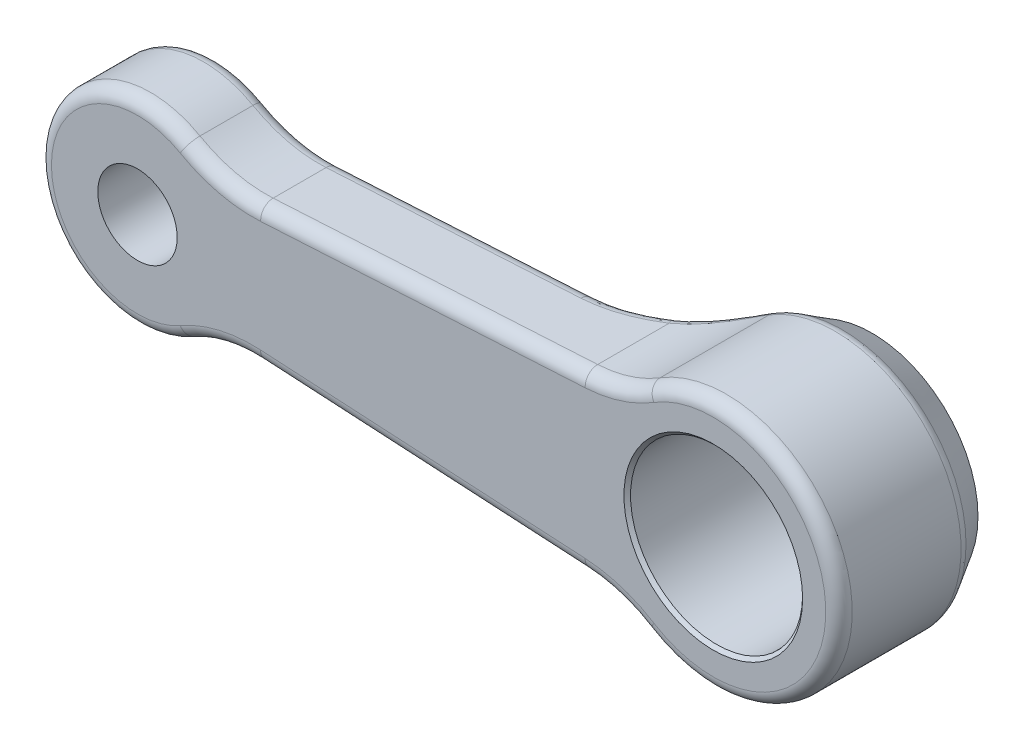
ISO-10303-21;
HEADER;
FILE_DESCRIPTION(('STEP AP214'),'2;1');
FILE_NAME('part.step','',(''),(''),'','','');
FILE_SCHEMA(('AUTOMOTIVE_DESIGN { 1 0 10303 214 1 1 1 1 }'));
ENDSEC;
DATA;
#1=APPLICATION_CONTEXT('core data for automotive mechanical design processes');
#2=APPLICATION_PROTOCOL_DEFINITION('international standard','automotive_design',2000,#1);
#3=PRODUCT_CONTEXT('',#1,'mechanical');
#4=PRODUCT('Part','Part','',(#3));
#5=PRODUCT_RELATED_PRODUCT_CATEGORY('part','',(#4));
#6=PRODUCT_DEFINITION_FORMATION('','',#4);
#7=PRODUCT_DEFINITION_CONTEXT('part definition',#1,'design');
#8=PRODUCT_DEFINITION('design','',#6,#7);
#9=PRODUCT_DEFINITION_SHAPE('','',#8);
#10=(LENGTH_UNIT() NAMED_UNIT(*) SI_UNIT(.MILLI.,.METRE.));
#11=(NAMED_UNIT(*) PLANE_ANGLE_UNIT() SI_UNIT($,.RADIAN.));
#12=(NAMED_UNIT(*) SI_UNIT($,.STERADIAN.) SOLID_ANGLE_UNIT());
#13=UNCERTAINTY_MEASURE_WITH_UNIT(LENGTH_MEASURE(1.E-05),#10,'distance_accuracy_value','');
#14=(GEOMETRIC_REPRESENTATION_CONTEXT(3) GLOBAL_UNCERTAINTY_ASSIGNED_CONTEXT((#13)) GLOBAL_UNIT_ASSIGNED_CONTEXT((#10,
#11,#12)) REPRESENTATION_CONTEXT('',''));
#15=CARTESIAN_POINT('',(0.,0.,0.));
#16=DIRECTION('',(0.,0.,1.));
#17=DIRECTION('',(1.,0.,0.));
#18=AXIS2_PLACEMENT_3D('',#15,#16,#17);
#19=CARTESIAN_POINT('',(0.,0.,-9.));
#20=DIRECTION('',(0.,0.,1.));
#21=DIRECTION('',(1.,0.,0.));
#22=AXIS2_PLACEMENT_3D('',#19,#20,#21);
#23=PLANE('',#22);
#24=DIRECTION('',(0.998433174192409,-0.0559570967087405,0.));
#25=VECTOR('',#24,1.);
#26=CARTESIAN_POINT('',(-66.952393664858,-2.98519456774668,-9.00000000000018));
#27=LINE('',#26,#25);
#28=CARTESIAN_POINT('',(-29.1398926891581,-5.10439275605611,-9.00000000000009));
#29=VERTEX_POINT('',#28);
#30=CARTESIAN_POINT('',(-66.739892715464,-2.997104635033,-9.00000000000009));
#31=VERTEX_POINT('',#30);
#32=EDGE_CURVE('E488',#29,#31,#27,.F.);
#33=ORIENTED_EDGE('',*,*,#32,.T.);
#34=CARTESIAN_POINT('',(-66.6,-0.5010221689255,-9.));
#35=DIRECTION('',(0.,0.,1.));
#36=DIRECTION('',(-1.,0.,0.));
#37=AXIS2_PLACEMENT_3D('',#34,#35,#36);
#38=CIRCLE('',#37,2.49999999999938);
#39=CARTESIAN_POINT('',(-69.0999996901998,-0.5010221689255,-9.00000000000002));
#40=VERTEX_POINT('',#39);
#41=EDGE_CURVE('E503',#31,#40,#38,.F.);
#42=ORIENTED_EDGE('',*,*,#41,.T.);
#43=DIRECTION('',(0.,-1.,0.));
#44=VECTOR('',#43,1.);
#45=CARTESIAN_POINT('',(-69.0999993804,0.7138566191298,-9.00000000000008));
#46=LINE('',#45,#44);
#47=CARTESIAN_POINT('',(-69.0999996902,0.5010221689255,-9.00000000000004));
#48=VERTEX_POINT('',#47);
#49=EDGE_CURVE('E494',#40,#48,#46,.F.);
#50=ORIENTED_EDGE('',*,*,#49,.T.);
#51=CARTESIAN_POINT('',(-66.7398927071,2.99710448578,-9.));
#52=CARTESIAN_POINT('',(-67.2000377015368,2.97122178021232,-9.));
#53=CARTESIAN_POINT('',(-67.6207959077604,2.78312048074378,-9.));
#54=CARTESIAN_POINT('',(-68.0744020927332,2.58033438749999,-9.));
#55=CARTESIAN_POINT('',(-68.4165530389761,2.21861717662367,-9.));
#56=CARTESIAN_POINT('',(-68.7579947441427,1.85764976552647,-9.));
#57=CARTESIAN_POINT('',(-68.9356438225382,1.39251902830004,-9.));
#58=CARTESIAN_POINT('',(-69.0999059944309,0.96243863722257,-9.));
#59=CARTESIAN_POINT('',(-69.1,0.5010221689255,-9.));
#60=B_SPLINE_CURVE_WITH_KNOTS('',2,(#51,#52,#53,#54,#55,#56,#57,#58,#59),.UNSPECIFIED.,.F.,.F.,
(3,2,2,2,3),(0.,0.25,0.5,0.75,1.),.UNSPECIFIED.);
#61=CARTESIAN_POINT('',(-66.7398927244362,2.99710479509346,-9.00000000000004));
#62=VERTEX_POINT('',#61);
#63=EDGE_CURVE('E255',#48,#62,#60,.F.);
#64=ORIENTED_EDGE('',*,*,#63,.T.);
#65=DIRECTION('',(-0.998433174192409,-0.0559570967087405,0.));
#66=VECTOR('',#65,1.);
#67=CARTESIAN_POINT('',(-28.9273917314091,5.11630267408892,-9.00000000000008));
#68=LINE('',#67,#66);
#69=CARTESIAN_POINT('',(-29.1398927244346,5.10439338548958,-9.00000000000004));
#70=VERTEX_POINT('',#69);
#71=EDGE_CURVE('E252',#62,#70,#68,.F.);
#72=ORIENTED_EDGE('',*,*,#71,.T.);
#73=CARTESIAN_POINT('',(-26.5,2.608310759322,-9.));
#74=CARTESIAN_POINT('',(-26.5001046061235,3.12377243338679,-9.));
#75=CARTESIAN_POINT('',(-26.7039182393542,3.59725209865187,-9.));
#76=CARTESIAN_POINT('',(-26.9075325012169,4.0702686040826,-9.));
#77=CARTESIAN_POINT('',(-27.2824052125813,4.42486338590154,-9.));
#78=CARTESIAN_POINT('',(-27.6565276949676,4.77874852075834,-9.));
#79=CARTESIAN_POINT('',(-28.1410902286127,4.95613324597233,-9.));
#80=CARTESIAN_POINT('',(-28.6246847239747,5.13316359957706,-9.));
#81=CARTESIAN_POINT('',(-29.13989274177,5.104393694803,-9.));
#82=B_SPLINE_CURVE_WITH_KNOTS('',2,(#73,#74,#75,#76,#77,#78,#79,#80,#81),.UNSPECIFIED.,.F.,.F.,
(3,2,2,2,3),(0.,0.25,0.5,0.75,1.),.UNSPECIFIED.);
#83=CARTESIAN_POINT('',(-26.5,2.608310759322,-9.));
#84=VERTEX_POINT('',#83);
#85=EDGE_CURVE('E236',#70,#84,#82,.F.);
#86=ORIENTED_EDGE('',*,*,#85,.T.);
#87=DIRECTION('',(0.,1.,0.));
#88=VECTOR('',#87,1.);
#89=CARTESIAN_POINT('',(-26.5,-2.821145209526,-9.));
#90=LINE('',#89,#88);
#91=CARTESIAN_POINT('',(-26.5,-2.60831075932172,-9.));
#92=VERTEX_POINT('',#91);
#93=EDGE_CURVE('E246',#84,#92,#90,.F.);
#94=ORIENTED_EDGE('',*,*,#93,.T.);
#95=CARTESIAN_POINT('',(-29.13989268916,-5.104392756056,-9.));
#96=CARTESIAN_POINT('',(-28.6252328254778,-5.13313250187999,-9.));
#97=CARTESIAN_POINT('',(-28.1410902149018,-4.95613300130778,-9.));
#98=CARTESIAN_POINT('',(-27.6574211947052,-4.77930664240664,-9.));
#99=CARTESIAN_POINT('',(-27.282405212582,-4.42486338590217,-9.));
#100=CARTESIAN_POINT('',(-26.9081397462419,-4.07112947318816,-9.));
#101=CARTESIAN_POINT('',(-26.7039182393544,-3.5972520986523,-9.));
#102=CARTESIAN_POINT('',(-26.5001047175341,-3.12432141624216,-9.));
#103=CARTESIAN_POINT('',(-26.5,-2.608310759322,-9.));
#104=B_SPLINE_CURVE_WITH_KNOTS('',2,(#95,#96,#97,#98,#99,#100,#101,#102,#103),.UNSPECIFIED.,.F.,
.F.,(3,2,2,2,3),(0.,0.25,0.5,0.75,1.),.UNSPECIFIED.);
#105=EDGE_CURVE('E263',#92,#29,#104,.F.);
#106=ORIENTED_EDGE('',*,*,#105,.T.);
#107=EDGE_LOOP('',(#33,#42,#50,#64,#72,#86,#94,#106));
#108=FACE_BOUND('',#107,.T.);
#109=ADVANCED_FACE('F14',(#108),#23,.F.);
#110=CARTESIAN_POINT('',(-28.9999999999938,2.60831075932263,-11.4999999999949));
#111=DIRECTION('',(0.,0.,1.));
#112=DIRECTION('',(0.,-1.,0.));
#113=AXIS2_PLACEMENT_3D('',#110,#111,#112);
#114=DEGENERATE_TOROIDAL_SURFACE('',#113,2.49999999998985,2.49999999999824,.T.);
#115=CARTESIAN_POINT('',(-29.,2.608310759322,-11.5));
#116=DIRECTION('',(0.,0.,1.));
#117=DIRECTION('',(-1.,0.,0.));
#118=AXIS2_PLACEMENT_3D('',#115,#116,#117);
#119=CIRCLE('',#118,5.);
#120=CARTESIAN_POINT('',(-29.2797854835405,7.60047663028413,-11.5));
#121=VERTEX_POINT('',#120);
#122=CARTESIAN_POINT('',(-24.,2.608310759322,-11.5));
#123=VERTEX_POINT('',#122);
#124=EDGE_CURVE('E480',#121,#123,#119,.F.);
#125=ORIENTED_EDGE('',*,*,#124,.T.);
#126=CARTESIAN_POINT('',(-26.5,2.608310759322,-11.5));
#127=DIRECTION('',(0.,1.,0.));
#128=DIRECTION('',(1.,0.,0.));
#129=AXIS2_PLACEMENT_3D('',#126,#127,#128);
#130=CIRCLE('',#129,2.5);
#131=EDGE_CURVE('E242',#123,#84,#130,.F.);
#132=ORIENTED_EDGE('',*,*,#131,.T.);
#133=ORIENTED_EDGE('',*,*,#85,.F.);
#134=CARTESIAN_POINT('',(-29.13989274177,5.10439369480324,-11.5));
#135=DIRECTION('',(-0.998433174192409,-0.0559570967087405,0.));
#136=DIRECTION('',(-0.0559570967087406,0.998433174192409,0.));
#137=AXIS2_PLACEMENT_3D('',#134,#135,#136);
#138=CIRCLE('',#137,2.5);
#139=EDGE_CURVE('E240',#70,#121,#138,.T.);
#140=ORIENTED_EDGE('',*,*,#139,.T.);
#141=EDGE_LOOP('',(#125,#132,#133,#140));
#142=FACE_BOUND('',#141,.T.);
#143=ADVANCED_FACE('F239',(#142),#114,.F.);
#144=CARTESIAN_POINT('',(-26.5,-2.608310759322,-11.5));
#145=DIRECTION('',(0.,1.,0.));
#146=DIRECTION('',(0.,0.,1.));
#147=AXIS2_PLACEMENT_3D('',#144,#145,#146);
#148=CYLINDRICAL_SURFACE('',#147,2.5);
#149=DIRECTION('',(0.,1.,0.));
#150=VECTOR('',#149,1.);
#151=CARTESIAN_POINT('',(-24.,-2.608310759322,-11.5));
#152=LINE('',#151,#150);
#153=CARTESIAN_POINT('',(-23.9999999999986,-2.60831075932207,-11.5));
#154=VERTEX_POINT('',#153);
#155=EDGE_CURVE('E471',#123,#154,#152,.F.);
#156=ORIENTED_EDGE('',*,*,#155,.T.);
#157=CARTESIAN_POINT('',(-26.5000000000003,-2.60831075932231,-11.5000000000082));
#158=DIRECTION('',(0.,-1.,3.50972726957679E-13));
#159=DIRECTION('',(0.,-3.50972726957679E-13,-1.));
#160=AXIS2_PLACEMENT_3D('',#157,#158,#159);
#161=CIRCLE('',#160,2.5000000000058);
#162=EDGE_CURVE('E260',#154,#92,#161,.T.);
#163=ORIENTED_EDGE('',*,*,#162,.T.);
#164=ORIENTED_EDGE('',*,*,#93,.F.);
#165=ORIENTED_EDGE('',*,*,#131,.F.);
#166=EDGE_LOOP('',(#156,#163,#164,#165));
#167=FACE_BOUND('',#166,.T.);
#168=ADVANCED_FACE('F1422',(#167),#148,.F.);
#169=CARTESIAN_POINT('',(-29.0000000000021,-2.60831075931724,-11.5000000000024));
#170=DIRECTION('',(0.,0.,1.));
#171=DIRECTION('',(0.,-1.,0.));
#172=AXIS2_PLACEMENT_3D('',#169,#170,#171);
#173=TOROIDAL_SURFACE('',#172,2.50000000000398,2.50000000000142);
#174=CARTESIAN_POINT('',(-29.,-2.608310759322,-11.5));
#175=DIRECTION('',(0.,0.,1.));
#176=DIRECTION('',(-1.,0.,0.));
#177=AXIS2_PLACEMENT_3D('',#174,#175,#176);
#178=CIRCLE('',#177,5.);
#179=CARTESIAN_POINT('',(-29.27978548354,-7.60047663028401,-11.5));
#180=VERTEX_POINT('',#179);
#181=EDGE_CURVE('E525',#154,#180,#178,.F.);
#182=ORIENTED_EDGE('',*,*,#181,.T.);
#183=CARTESIAN_POINT('',(-29.1398927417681,-5.10439369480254,-11.5));
#184=DIRECTION('',(0.998433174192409,-0.0559570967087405,0.));
#185=DIRECTION('',(-0.0559570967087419,-0.998433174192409,0.));
#186=AXIS2_PLACEMENT_3D('',#183,#184,#185);
#187=CIRCLE('',#186,2.5);
#188=EDGE_CURVE('E516',#180,#29,#187,.F.);
#189=ORIENTED_EDGE('',*,*,#188,.T.);
#190=ORIENTED_EDGE('',*,*,#105,.F.);
#191=ORIENTED_EDGE('',*,*,#162,.F.);
#192=EDGE_LOOP('',(#182,#189,#190,#191));
#193=FACE_BOUND('',#192,.T.);
#194=ADVANCED_FACE('F523',(#193),#173,.F.);
#195=CARTESIAN_POINT('',(-29.13989274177,5.10439369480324,-11.5));
#196=DIRECTION('',(-0.998433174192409,-0.0559570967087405,0.));
#197=DIRECTION('',(0.0559570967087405,-0.998433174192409,0.));
#198=AXIS2_PLACEMENT_3D('',#195,#196,#197);
#199=CYLINDRICAL_SURFACE('',#198,2.5);
#200=DIRECTION('',(-0.998433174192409,-0.0559570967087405,0.));
#201=VECTOR('',#200,1.);
#202=CARTESIAN_POINT('',(-29.27978548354,7.600476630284,-11.5));
#203=LINE('',#202,#201);
#204=CARTESIAN_POINT('',(-66.8797854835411,5.49318803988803,-11.5));
#205=VERTEX_POINT('',#204);
#206=EDGE_CURVE('E254',#205,#121,#203,.F.);
#207=ORIENTED_EDGE('',*,*,#206,.T.);
#208=ORIENTED_EDGE('',*,*,#139,.F.);
#209=ORIENTED_EDGE('',*,*,#71,.F.);
#210=CARTESIAN_POINT('',(-66.7398927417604,2.99710510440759,-11.5000000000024));
#211=DIRECTION('',(-0.998433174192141,-0.0559570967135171,-4.48422275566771E-12));
#212=DIRECTION('',(0.0559570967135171,-0.998433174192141,0.));
#213=AXIS2_PLACEMENT_3D('',#210,#211,#212);
#214=CIRCLE('',#213,2.50000000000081);
#215=EDGE_CURVE('E497',#62,#205,#214,.T.);
#216=ORIENTED_EDGE('',*,*,#215,.T.);
#217=EDGE_LOOP('',(#207,#208,#209,#216));
#218=FACE_BOUND('',#217,.T.);
#219=ADVANCED_FACE('F250',(#218),#199,.F.);
#220=CARTESIAN_POINT('',(-66.5999999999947,0.501022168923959,-11.5000000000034));
#221=DIRECTION('',(0.,0.,1.));
#222=DIRECTION('',(1.,0.,0.));
#223=AXIS2_PLACEMENT_3D('',#220,#221,#222);
#224=TOROIDAL_SURFACE('',#223,2.50000000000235,2.50000000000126);
#225=CARTESIAN_POINT('',(-66.6,0.5010221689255,-11.5));
#226=DIRECTION('',(0.,0.,1.));
#227=DIRECTION('',(-1.,0.,0.));
#228=AXIS2_PLACEMENT_3D('',#225,#226,#227);
#229=CIRCLE('',#228,5.);
#230=CARTESIAN_POINT('',(-71.6,0.5010221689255,-11.5));
#231=VERTEX_POINT('',#230);
#232=EDGE_CURVE('E547',#231,#205,#229,.F.);
#233=ORIENTED_EDGE('',*,*,#232,.T.);
#234=ORIENTED_EDGE('',*,*,#215,.F.);
#235=ORIENTED_EDGE('',*,*,#63,.F.);
#236=CARTESIAN_POINT('',(-69.1,0.5010221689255,-11.5));
#237=DIRECTION('',(0.,-1.,0.));
#238=DIRECTION('',(-1.,0.,0.));
#239=AXIS2_PLACEMENT_3D('',#236,#237,#238);
#240=CIRCLE('',#239,2.5);
#241=EDGE_CURVE('E496',#48,#231,#240,.T.);
#242=ORIENTED_EDGE('',*,*,#241,.T.);
#243=EDGE_LOOP('',(#233,#234,#235,#242));
#244=FACE_BOUND('',#243,.T.);
#245=ADVANCED_FACE('F16',(#244),#224,.F.);
#246=CARTESIAN_POINT('',(-69.1,0.5010221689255,-11.5));
#247=DIRECTION('',(0.,-1.,0.));
#248=DIRECTION('',(0.,0.,-1.));
#249=AXIS2_PLACEMENT_3D('',#246,#247,#248);
#250=CYLINDRICAL_SURFACE('',#249,2.5);
#251=DIRECTION('',(0.,1.,0.));
#252=VECTOR('',#251,1.);
#253=CARTESIAN_POINT('',(-71.6,0.5010221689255,-11.5));
#254=LINE('',#253,#252);
#255=CARTESIAN_POINT('',(-71.6,-0.5010221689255,-11.5));
#256=VERTEX_POINT('',#255);
#257=EDGE_CURVE('E537',#256,#231,#254,.T.);
#258=ORIENTED_EDGE('',*,*,#257,.T.);
#259=ORIENTED_EDGE('',*,*,#241,.F.);
#260=ORIENTED_EDGE('',*,*,#49,.F.);
#261=CARTESIAN_POINT('',(-69.1,-0.5010221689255,-11.5));
#262=DIRECTION('',(0.,-1.,0.));
#263=DIRECTION('',(-1.,0.,0.));
#264=AXIS2_PLACEMENT_3D('',#261,#262,#263);
#265=CIRCLE('',#264,2.5);
#266=EDGE_CURVE('E491',#40,#256,#265,.T.);
#267=ORIENTED_EDGE('',*,*,#266,.T.);
#268=EDGE_LOOP('',(#258,#259,#260,#267));
#269=FACE_BOUND('',#268,.T.);
#270=ADVANCED_FACE('F1404',(#269),#250,.F.);
#271=CARTESIAN_POINT('',(-69.0977354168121,-0.394637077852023,-11.5));
#272=DIRECTION('',(-0.0425540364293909,-0.999094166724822,0.));
#273=DIRECTION('',(-0.999094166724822,0.0425540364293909,0.));
#274=AXIS2_PLACEMENT_3D('',#271,#272,#273);
#275=CIRCLE('',#274,2.5);
#276=TRIMMED_CURVE('',#275,(PARAMETER_VALUE(-3.14159265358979)),
(PARAMETER_VALUE(3.14159265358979)),.T.,.PARAMETER.);
#277=CARTESIAN_POINT('',(-66.6,-0.5010221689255,-11.5));
#278=DIRECTION('',(0.,0.,1.));
#279=AXIS1_PLACEMENT('',#277,#278);
#280=SURFACE_OF_REVOLUTION('',#276,#279);
#281=CARTESIAN_POINT('',(-66.6,-0.5010221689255,-11.5));
#282=DIRECTION('',(0.,0.,1.));
#283=DIRECTION('',(-1.,0.,0.));
#284=AXIS2_PLACEMENT_3D('',#281,#282,#283);
#285=CIRCLE('',#284,5.);
#286=CARTESIAN_POINT('',(-66.8797854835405,-5.49318803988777,-11.5));
#287=VERTEX_POINT('',#286);
#288=EDGE_CURVE('E730',#287,#256,#285,.F.);
#289=ORIENTED_EDGE('',*,*,#288,.T.);
#290=ORIENTED_EDGE('',*,*,#266,.F.);
#291=ORIENTED_EDGE('',*,*,#41,.F.);
#292=CARTESIAN_POINT('',(-66.73989274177,-2.99710510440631,-11.5));
#293=DIRECTION('',(0.998433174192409,-0.0559570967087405,0.));
#294=DIRECTION('',(-0.0559570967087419,-0.998433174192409,0.));
#295=AXIS2_PLACEMENT_3D('',#292,#293,#294);
#296=CIRCLE('',#295,2.5);
#297=EDGE_CURVE('E490',#31,#287,#296,.T.);
#298=ORIENTED_EDGE('',*,*,#297,.T.);
#299=EDGE_LOOP('',(#289,#290,#291,#298));
#300=FACE_BOUND('',#299,.T.);
#301=ADVANCED_FACE('F506',(#300),#280,.T.);
#302=CARTESIAN_POINT('',(-66.73989274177,-2.99710510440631,-11.5));
#303=DIRECTION('',(0.998433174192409,-0.0559570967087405,0.));
#304=DIRECTION('',(0.0559570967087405,0.998433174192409,0.));
#305=AXIS2_PLACEMENT_3D('',#302,#303,#304);
#306=CYLINDRICAL_SURFACE('',#305,2.5);
#307=DIRECTION('',(0.998433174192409,-0.0559570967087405,0.));
#308=VECTOR('',#307,1.);
#309=CARTESIAN_POINT('',(-66.87978548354,-5.493188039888,-11.5));
#310=LINE('',#309,#308);
#311=EDGE_CURVE('E515',#180,#287,#310,.F.);
#312=ORIENTED_EDGE('',*,*,#311,.T.);
#313=ORIENTED_EDGE('',*,*,#297,.F.);
#314=ORIENTED_EDGE('',*,*,#32,.F.);
#315=ORIENTED_EDGE('',*,*,#188,.F.);
#316=EDGE_LOOP('',(#312,#313,#314,#315));
#317=FACE_BOUND('',#316,.T.);
#318=ADVANCED_FACE('F512',(#317),#306,.F.);
#319=CARTESIAN_POINT('',(0.,0.,-18.9999999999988));
#320=DIRECTION('',(0.,0.,1.));
#321=DIRECTION('',(1.,0.,0.));
#322=AXIS2_PLACEMENT_3D('',#319,#320,#321);
#323=CONICAL_SURFACE('',#322,19.0000000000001,0.540419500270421);
#324=CARTESIAN_POINT('',(0.,0.,-23.9999999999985));
#325=DIRECTION('',(0.,0.,1.));
#326=DIRECTION('',(1.,0.,0.));
#327=AXIS2_PLACEMENT_3D('',#324,#325,#326);
#328=CIRCLE('',#327,15.9999999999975);
#329=CARTESIAN_POINT('',(15.9999999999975,0.,-23.9999999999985));
#330=VERTEX_POINT('',#329);
#331=EDGE_CURVE('E720',#330,#330,#328,.F.);
#332=ORIENTED_EDGE('',*,*,#331,.F.);
#333=EDGE_LOOP('',(#332));
#334=FACE_BOUND('',#333,.T.);
#335=CARTESIAN_POINT('',(0.,0.,-19.0000000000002));
#336=DIRECTION('',(0.,0.,-1.));
#337=DIRECTION('',(1.,0.,0.));
#338=AXIS2_PLACEMENT_3D('',#335,#336,#337);
#339=CIRCLE('',#338,19.0000000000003);
#340=CARTESIAN_POINT('',(-12.2024510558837,-14.5636873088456,-19.0000135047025));
#341=VERTEX_POINT('',#340);
#342=CARTESIAN_POINT('',(-12.2013027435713,14.5646376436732,-19.0000076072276));
#343=VERTEX_POINT('',#342);
#344=EDGE_CURVE('E370',#341,#343,#339,.T.);
#345=ORIENTED_EDGE('',*,*,#344,.T.);
#346=CARTESIAN_POINT('',(-11.3186923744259,15.0543639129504,-19.2685352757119));
#347=CARTESIAN_POINT('',(-11.3336661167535,15.0473474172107,-19.2628746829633));
#348=CARTESIAN_POINT('',(-11.3486293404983,15.0400650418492,-19.2575467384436));
#349=CARTESIAN_POINT('',(-11.3804758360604,15.0241304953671,-19.2467213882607));
#350=CARTESIAN_POINT('',(-11.3973551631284,15.015423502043,-19.2412924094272));
#351=CARTESIAN_POINT('',(-11.4330330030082,14.9966691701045,-19.2302040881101));
#352=CARTESIAN_POINT('',(-11.4518257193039,14.9865839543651,-19.2245917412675));
#353=CARTESIAN_POINT('',(-11.4913308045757,14.9650611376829,-19.2131215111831));
#354=CARTESIAN_POINT('',(-11.5120369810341,14.9535929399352,-19.2072999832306));
#355=CARTESIAN_POINT('',(-11.5443028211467,14.9355673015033,-19.1983401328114));
#356=CARTESIAN_POINT('',(-11.5558805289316,14.9290680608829,-19.195147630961));
#357=CARTESIAN_POINT('',(-11.5834639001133,14.9135996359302,-19.1874754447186));
#358=CARTESIAN_POINT('',(-11.5994669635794,14.9046379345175,-19.1829711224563));
#359=CARTESIAN_POINT('',(-11.6358791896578,14.8842774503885,-19.1726002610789));
#360=CARTESIAN_POINT('',(-11.6562848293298,14.8728890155,-19.1667010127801));
#361=CARTESIAN_POINT('',(-11.7014777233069,14.8477439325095,-19.1534064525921));
#362=CARTESIAN_POINT('',(-11.7262612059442,14.8340060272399,-19.1459627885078));
#363=CARTESIAN_POINT('',(-11.7718278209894,14.808812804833,-19.1320388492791));
#364=CARTESIAN_POINT('',(-11.7926152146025,14.7973446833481,-19.1255954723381));
#365=CARTESIAN_POINT('',(-11.8321506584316,14.7755302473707,-19.1132348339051));
#366=CARTESIAN_POINT('',(-11.8509011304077,14.7651829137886,-19.1073270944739));
#367=CARTESIAN_POINT('',(-11.8894843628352,14.743878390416,-19.0950905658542));
#368=CARTESIAN_POINT('',(-11.9093157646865,14.7329212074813,-19.0887574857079));
#369=CARTESIAN_POINT('',(-11.9465168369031,14.7122772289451,-19.0768940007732));
#370=CARTESIAN_POINT('',(-11.9638903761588,14.7025992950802,-19.0713603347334));
#371=CARTESIAN_POINT('',(-12.0017107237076,14.6813978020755,-19.0593950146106));
#372=CARTESIAN_POINT('',(-12.0221513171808,14.6698537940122,-19.0529798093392));
#373=CARTESIAN_POINT('',(-12.0616225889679,14.6473489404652,-19.0407472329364));
#374=CARTESIAN_POINT('',(-12.0806566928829,14.6364003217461,-19.0349184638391));
#375=CARTESIAN_POINT('',(-12.1173256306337,14.6150589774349,-19.0238973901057));
#376=CARTESIAN_POINT('',(-12.1349644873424,14.6046814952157,-19.0186891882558));
#377=CARTESIAN_POINT('',(-12.1688485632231,14.5844523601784,-19.0089514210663));
#378=CARTESIAN_POINT('',(-12.1850989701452,14.5746197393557,-19.004400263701));
#379=CARTESIAN_POINT('',(-12.2013104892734,14.5646468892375,-19.0000152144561));
#380=B_SPLINE_CURVE_WITH_KNOTS('',3,(#346,#347,#348,#349,#350,#351,#352,#353,#354,#355,#356,
#357,#358,#359,#360,#361,#362,#363,#364,#365,#366,#367,#368,#369,#370,#371,#372,#373,#374,#375,
#376,#377,#378,#379),.UNSPECIFIED.,.F.,.F.,(4,2,2,2,2,2,2,2,2,2,2,2,2,2,2,2,4),(0.,
0.0524147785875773,0.111661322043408,0.177818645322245,0.250940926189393,0.29190790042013,
0.348566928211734,0.420870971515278,0.508762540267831,0.58256160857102,0.649209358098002,
0.719785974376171,0.781714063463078,0.854720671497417,0.922875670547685,0.986224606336,
1.04481648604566),.UNSPECIFIED.);
#381=CARTESIAN_POINT('',(-11.3196085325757,15.0555833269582,-19.2694491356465));
#382=VERTEX_POINT('',#381);
#383=EDGE_CURVE('E1246',#382,#343,#380,.T.);
#384=ORIENTED_EDGE('',*,*,#383,.F.);
#385=CARTESIAN_POINT('',(-9.87633917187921,15.8967896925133,-19.4750123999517));
#386=CARTESIAN_POINT('',(-9.92239776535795,15.8681675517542,-19.4750108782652));
#387=CARTESIAN_POINT('',(-9.96851548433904,15.8396352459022,-19.4744394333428));
#388=CARTESIAN_POINT('',(-10.0688807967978,15.7778796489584,-19.4718722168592));
#389=CARTESIAN_POINT('',(-10.1231503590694,15.7447015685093,-19.4696464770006));
#390=CARTESIAN_POINT('',(-10.2398621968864,15.6739110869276,-19.4629256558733));
#391=CARTESIAN_POINT('',(-10.3023294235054,15.6363663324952,-19.4581443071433));
#392=CARTESIAN_POINT('',(-10.4354062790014,15.5571805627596,-19.4453519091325));
#393=CARTESIAN_POINT('',(-10.5060371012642,15.5156286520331,-19.4370064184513));
#394=CARTESIAN_POINT('',(-10.6506890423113,15.4315198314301,-19.4167094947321));
#395=CARTESIAN_POINT('',(-10.7247144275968,15.3890066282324,-19.4046078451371));
#396=CARTESIAN_POINT('',(-10.864746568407,15.309442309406,-19.3787349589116));
#397=CARTESIAN_POINT('',(-10.9307588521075,15.2722957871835,-19.3652836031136));
#398=CARTESIAN_POINT('',(-11.0547369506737,15.2031138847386,-19.3378321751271));
#399=CARTESIAN_POINT('',(-11.1127172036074,15.171000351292,-19.3240919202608));
#400=CARTESIAN_POINT('',(-11.2206508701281,15.1115202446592,-19.2970539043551));
#401=CARTESIAN_POINT('',(-11.2706241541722,15.0841017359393,-19.2839498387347));
#402=CARTESIAN_POINT('',(-11.3205202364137,15.0567955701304,-19.2703567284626));
#403=B_SPLINE_CURVE_WITH_KNOTS('',3,(#385,#386,#387,#388,#389,#390,#391,#392,#393,#394,#395,
#396,#397,#398,#399,#400,#401,#402),.UNSPECIFIED.,.F.,.F.,(4,2,2,2,2,2,2,2,4),(0.,
0.162684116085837,0.353600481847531,0.57267267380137,0.819718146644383,1.07830236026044,
1.30905545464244,1.51210157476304,1.68754976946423),.UNSPECIFIED.);
#404=CARTESIAN_POINT('',(-9.87634319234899,15.8967981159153,-19.4750179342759));
#405=VERTEX_POINT('',#404);
#406=EDGE_CURVE('E1858',#405,#382,#403,.T.);
#407=ORIENTED_EDGE('',*,*,#406,.F.);
#408=CARTESIAN_POINT('',(0.,0.,-19.4750235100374));
#409=DIRECTION('',(0.,0.,-1.));
#410=DIRECTION('',(0.999918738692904,0.01274817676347,0.));
#411=AXIS2_PLACEMENT_3D('',#408,#409,#410);
#412=CIRCLE('',#411,18.7149858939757);
#413=CARTESIAN_POINT('',(-9.87634040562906,-15.8967916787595,-19.4750137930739));
#414=VERTEX_POINT('',#413);
#415=EDGE_CURVE('E1861',#414,#405,#412,.F.);
#416=ORIENTED_EDGE('',*,*,#415,.F.);
#417=CARTESIAN_POINT('',(-11.3508165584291,-15.0401845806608,-19.2620942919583));
#418=CARTESIAN_POINT('',(-11.2996484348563,-15.0681131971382,-19.2763046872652));
#419=CARTESIAN_POINT('',(-11.2483978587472,-15.0961657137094,-19.2899950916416));
#420=CARTESIAN_POINT('',(-11.1378969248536,-15.1569297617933,-19.3181786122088));
#421=CARTESIAN_POINT('',(-11.0786257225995,-15.1896957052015,-19.3324725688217));
#422=CARTESIAN_POINT('',(-10.9520545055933,-15.2602030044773,-19.3609870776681));
#423=CARTESIAN_POINT('',(-10.8847390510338,-15.2980245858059,-19.3749430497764));
#424=CARTESIAN_POINT('',(-10.7420961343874,-15.3789630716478,-19.4017615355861));
#425=CARTESIAN_POINT('',(-10.6667623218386,-15.4221773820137,-19.4142997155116));
#426=CARTESIAN_POINT('',(-10.5206689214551,-15.5070333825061,-19.4351918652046));
#427=CARTESIAN_POINT('',(-10.4499040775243,-15.5486154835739,-19.4437505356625));
#428=CARTESIAN_POINT('',(-10.3158148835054,-15.6283040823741,-19.4570071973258));
#429=CARTESIAN_POINT('',(-10.2524722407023,-15.6663293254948,-19.4620112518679));
#430=CARTESIAN_POINT('',(-10.1332796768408,-15.7385389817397,-19.4691490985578));
#431=CARTESIAN_POINT('',(-10.0774074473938,-15.772661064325,-19.4715471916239));
#432=CARTESIAN_POINT('',(-9.97312552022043,-15.8367759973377,-19.4743640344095));
#433=CARTESIAN_POINT('',(-9.92469505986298,-15.8667255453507,-19.4750005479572));
#434=CARTESIAN_POINT('',(-9.87633180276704,-15.8967778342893,-19.4750040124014));
#435=B_SPLINE_CURVE_WITH_KNOTS('',3,(#417,#418,#419,#420,#421,#422,#423,#424,#425,#426,#427,
#428,#429,#430,#431,#432,#433,#434),.UNSPECIFIED.,.F.,.F.,(4,2,2,2,2,2,2,2,4),(0.,
0.180008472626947,0.387637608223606,0.622986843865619,0.886159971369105,1.13366173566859,
1.35576361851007,1.55227216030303,1.72309281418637),.UNSPECIFIED.);
#436=CARTESIAN_POINT('',(-11.3499102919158,-15.0389833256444,-19.2611937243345));
#437=VERTEX_POINT('',#436);
#438=EDGE_CURVE('E1289',#437,#414,#435,.T.);
#439=ORIENTED_EDGE('',*,*,#438,.F.);
#440=CARTESIAN_POINT('',(-12.2024647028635,-14.5637035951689,-19.0000266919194));
#441=CARTESIAN_POINT('',(-12.1940947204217,-14.5707054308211,-19.0000423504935));
#442=CARTESIAN_POINT('',(-12.185701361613,-14.5776826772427,-19.0000705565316));
#443=CARTESIAN_POINT('',(-12.170119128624,-14.5904486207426,-19.0002858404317));
#444=CARTESIAN_POINT('',(-12.1629440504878,-14.5962547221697,-19.0004477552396));
#445=CARTESIAN_POINT('',(-12.1498038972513,-14.6066945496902,-19.0009408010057));
#446=CARTESIAN_POINT('',(-12.1438552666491,-14.6113499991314,-19.0012359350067));
#447=CARTESIAN_POINT('',(-12.1353423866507,-14.6178228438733,-19.0018771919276));
#448=CARTESIAN_POINT('',(-12.1328249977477,-14.6197138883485,-19.002093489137));
#449=CARTESIAN_POINT('',(-12.1280923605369,-14.6232018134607,-19.002581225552));
#450=CARTESIAN_POINT('',(-12.1258805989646,-14.6248048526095,-19.0028417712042));
#451=CARTESIAN_POINT('',(-12.1205483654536,-14.628581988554,-19.0035779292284));
#452=CARTESIAN_POINT('',(-12.1174156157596,-14.6307302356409,-19.0040978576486));
#453=CARTESIAN_POINT('',(-12.1109842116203,-14.635026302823,-19.0053065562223));
#454=CARTESIAN_POINT('',(-12.1076841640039,-14.6371702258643,-19.0060015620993));
#455=CARTESIAN_POINT('',(-12.100916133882,-14.6414563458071,-19.0075648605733));
#456=CARTESIAN_POINT('',(-12.0974470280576,-14.643594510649,-19.0084393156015));
#457=CARTESIAN_POINT('',(-12.0903406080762,-14.6478708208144,-19.0103601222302));
#458=CARTESIAN_POINT('',(-12.086702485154,-14.6500049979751,-19.0114122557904));
#459=CARTESIAN_POINT('',(-12.079257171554,-14.6542739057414,-19.0136888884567));
#460=CARTESIAN_POINT('',(-12.0754494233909,-14.6564047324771,-19.014918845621));
#461=CARTESIAN_POINT('',(-12.06766402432,-14.660668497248,-19.0175501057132));
#462=CARTESIAN_POINT('',(-12.0636860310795,-14.6627976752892,-19.0189564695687));
#463=CARTESIAN_POINT('',(-12.0555593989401,-14.6670564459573,-19.0219434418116));
#464=CARTESIAN_POINT('',(-12.0514106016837,-14.6691823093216,-19.0235288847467));
#465=CARTESIAN_POINT('',(-12.0429407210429,-14.6734452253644,-19.0268615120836));
#466=CARTESIAN_POINT('',(-12.0386195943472,-14.6755791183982,-19.0286126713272));
#467=CARTESIAN_POINT('',(-12.0298856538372,-14.6797813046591,-19.0322915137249));
#468=CARTESIAN_POINT('',(-12.0254729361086,-14.681847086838,-19.0342222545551));
#469=CARTESIAN_POINT('',(-12.0092462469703,-14.6894621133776,-19.0412898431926));
#470=CARTESIAN_POINT('',(-11.9974265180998,-14.6950452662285,-19.0463751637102));
#471=CARTESIAN_POINT('',(-11.9772450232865,-14.7046886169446,-19.0548878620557));
#472=CARTESIAN_POINT('',(-11.9688873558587,-14.708714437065,-19.0583634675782));
#473=CARTESIAN_POINT('',(-11.9521615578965,-14.7169151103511,-19.0651168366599));
#474=CARTESIAN_POINT('',(-11.9437934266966,-14.7210899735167,-19.0683945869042));
#475=CARTESIAN_POINT('',(-11.9320583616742,-14.7271372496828,-19.0727304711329));
#476=CARTESIAN_POINT('',(-11.928690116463,-14.7288952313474,-19.0739448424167));
#477=CARTESIAN_POINT('',(-11.9184148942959,-14.7342724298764,-19.0776267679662));
#478=CARTESIAN_POINT('',(-11.9115075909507,-14.7379068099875,-19.0800706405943));
#479=CARTESIAN_POINT('',(-11.8941461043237,-14.7470541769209,-19.0861826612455));
#480=CARTESIAN_POINT('',(-11.8836902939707,-14.7525743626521,-19.0898356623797));
#481=CARTESIAN_POINT('',(-11.8592220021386,-14.7655573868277,-19.0982681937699));
#482=CARTESIAN_POINT('',(-11.8452082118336,-14.7730429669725,-19.1030087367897));
#483=CARTESIAN_POINT('',(-11.8276102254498,-14.7823640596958,-19.1090335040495));
#484=CARTESIAN_POINT('',(-11.8240353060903,-14.7842534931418,-19.1102611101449));
#485=CARTESIAN_POINT('',(-11.815208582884,-14.7888958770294,-19.1133178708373));
#486=CARTESIAN_POINT('',(-11.8099557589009,-14.7916387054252,-19.1151594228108));
#487=CARTESIAN_POINT('',(-11.7977701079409,-14.7979987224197,-19.1194272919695));
#488=CARTESIAN_POINT('',(-11.7908366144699,-14.8016153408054,-19.121852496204));
#489=CARTESIAN_POINT('',(-11.7752846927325,-14.8097248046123,-19.1272822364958));
#490=CARTESIAN_POINT('',(-11.7666654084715,-14.8142174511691,-19.130284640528));
#491=CARTESIAN_POINT('',(-11.7477362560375,-14.8240910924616,-19.1368484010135));
#492=CARTESIAN_POINT('',(-11.737425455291,-14.8294739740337,-19.1404042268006));
#493=CARTESIAN_POINT('',(-11.7151061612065,-14.8411386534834,-19.1480555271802));
#494=CARTESIAN_POINT('',(-11.703096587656,-14.8474230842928,-19.1521438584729));
#495=CARTESIAN_POINT('',(-11.6773720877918,-14.8609130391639,-19.160823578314));
#496=CARTESIAN_POINT('',(-11.6636560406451,-14.8681232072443,-19.1654043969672));
#497=CARTESIAN_POINT('',(-11.6345070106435,-14.8834525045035,-19.1750788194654));
#498=CARTESIAN_POINT('',(-11.6190725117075,-14.8915732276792,-19.1801653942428));
#499=CARTESIAN_POINT('',(-11.5942357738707,-14.9047626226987,-19.1881399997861));
#500=CARTESIAN_POINT('',(-11.5848347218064,-14.9097830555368,-19.1911099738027));
#501=CARTESIAN_POINT('',(-11.565429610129,-14.9202732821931,-19.1970483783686));
#502=CARTESIAN_POINT('',(-11.5554260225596,-14.9257510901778,-19.2000041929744));
#503=CARTESIAN_POINT('',(-11.5348118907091,-14.9371309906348,-19.2059455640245));
#504=CARTESIAN_POINT('',(-11.5242016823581,-14.9430385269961,-19.2089218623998));
#505=CARTESIAN_POINT('',(-11.5023807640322,-14.955322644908,-19.2148319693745));
#506=CARTESIAN_POINT('',(-11.4911708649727,-14.9617065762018,-19.2177533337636));
#507=CARTESIAN_POINT('',(-11.4668722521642,-14.975517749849,-19.2240813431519));
#508=CARTESIAN_POINT('',(-11.453781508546,-14.9829417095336,-19.2274877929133));
#509=CARTESIAN_POINT('',(-11.4290434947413,-14.9966851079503,-19.2342599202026));
#510=CARTESIAN_POINT('',(-11.4174018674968,-15.0030339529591,-19.2375859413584));
#511=CARTESIAN_POINT('',(-11.3955686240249,-15.0146661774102,-19.2441555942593));
#512=CARTESIAN_POINT('',(-11.3853817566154,-15.0199820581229,-19.2473554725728));
#513=CARTESIAN_POINT('',(-11.366462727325,-15.0294883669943,-19.253759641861));
#514=CARTESIAN_POINT('',(-11.3577332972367,-15.0337303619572,-19.2568963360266));
#515=CARTESIAN_POINT('',(-11.3489995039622,-15.03777625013,-19.2602878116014));
#516=B_SPLINE_CURVE_WITH_KNOTS('',3,(#440,#441,#442,#443,#444,#445,#446,#447,#448,#449,#450,
#451,#452,#453,#454,#455,#456,#457,#458,#459,#460,#461,#462,#463,#464,#465,#466,#467,#468,#469,
#470,#471,#472,#473,#474,#475,#476,#477,#478,#479,#480,#481,#482,#483,#484,#485,#486,#487,#488,
#489,#490,#491,#492,#493,#494,#495,#496,#497,#498,#499,#500,#501,#502,#503,#504,#505,#506,#507,
#508,#509,#510,#511,#512,#513,#514,#515),.UNSPECIFIED.,.F.,.F.,(4,2,2,2,2,2,2,2,2,2,2,2,2,2,2,2,
2,2,2,2,2,2,2,2,2,2,2,2,2,2,2,2,2,2,2,2,2,4),(0.,0.0327404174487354,0.060433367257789,
0.0831060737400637,0.0925728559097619,0.10080304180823,0.112299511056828,0.124284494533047,
0.136784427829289,0.149822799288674,0.163420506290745,0.177596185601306,0.192366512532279,
0.207746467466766,0.223468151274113,0.265546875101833,0.295265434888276,0.324985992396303,
0.336951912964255,0.361488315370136,0.398612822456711,0.44835200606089,0.461029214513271,
0.479645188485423,0.504207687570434,0.534726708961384,0.571214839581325,0.613687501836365,
0.662163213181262,0.716663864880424,0.749853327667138,0.785197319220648,0.822705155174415,
0.862385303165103,0.908672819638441,0.949681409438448,0.98545126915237,1.01604680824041),.UNSPECIFIED.);
#517=EDGE_CURVE('E1288',#341,#437,#516,.T.);
#518=ORIENTED_EDGE('',*,*,#517,.F.);
#519=EDGE_LOOP('',(#345,#384,#407,#416,#439,#518));
#520=FACE_BOUND('',#519,.T.);
#521=ADVANCED_FACE('F1259',(#334,#520),#323,.T.);
#522=CARTESIAN_POINT('',(-29.,2.608310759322,-14.0522406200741));
#523=DIRECTION('',(0.,0.,1.));
#524=DIRECTION('',(1.,0.,0.));
#525=AXIS2_PLACEMENT_3D('',#522,#523,#524);
#526=CYLINDRICAL_SURFACE('',#525,5.);
#527=CARTESIAN_POINT('',(-29.27978548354,7.60047663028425,-12.0691260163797));
#528=CARTESIAN_POINT('',(-29.1424955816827,7.60819157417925,-12.0817245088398));
#529=CARTESIAN_POINT('',(-29.0050680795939,7.61019289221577,-12.0962367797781));
#530=CARTESIAN_POINT('',(-28.7310086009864,7.60294524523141,-12.1291429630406));
#531=CARTESIAN_POINT('',(-28.5943764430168,7.59369895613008,-12.1475359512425));
#532=CARTESIAN_POINT('',(-28.3233663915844,7.56418604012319,-12.1881954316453));
#533=CARTESIAN_POINT('',(-28.1889824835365,7.54395640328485,-12.2104487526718));
#534=CARTESIAN_POINT('',(-27.9229702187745,7.49281162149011,-12.258806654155));
#535=CARTESIAN_POINT('',(-27.7913419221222,7.46189624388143,-12.2849113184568));
#536=CARTESIAN_POINT('',(-27.5318293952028,7.38979601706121,-12.3407984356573));
#537=CARTESIAN_POINT('',(-27.4039428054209,7.34861780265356,-12.3705785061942));
#538=CARTESIAN_POINT('',(-27.152592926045,7.25643030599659,-12.4335897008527));
#539=CARTESIAN_POINT('',(-27.0291313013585,7.20541736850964,-12.4668221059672));
#540=CARTESIAN_POINT('',(-26.7873911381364,7.09407349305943,-12.5363955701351));
#541=CARTESIAN_POINT('',(-26.6691126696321,7.03374242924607,-12.5727366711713));
#542=CARTESIAN_POINT('',(-26.4383450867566,6.90429126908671,-12.6481069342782));
#543=CARTESIAN_POINT('',(-26.3258581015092,6.83516797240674,-12.6871370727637));
#544=CARTESIAN_POINT('',(-25.9887713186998,6.60926061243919,-12.8109132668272));
#545=CARTESIAN_POINT('',(-25.7746407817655,6.43859157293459,-12.8994056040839));
#546=CARTESIAN_POINT('',(-25.3776804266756,6.0656424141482,-13.0807787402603));
#547=CARTESIAN_POINT('',(-25.1948907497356,5.86332238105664,-13.173664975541));
#548=CARTESIAN_POINT('',(-24.9402521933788,5.53064792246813,-13.3148481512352));
#549=CARTESIAN_POINT('',(-24.8560251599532,5.40995295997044,-13.3640183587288));
#550=CARTESIAN_POINT('',(-24.6982010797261,5.16100377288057,-13.4604865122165));
#551=CARTESIAN_POINT('',(-24.6246064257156,5.03274785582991,-13.5077840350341));
#552=CARTESIAN_POINT('',(-24.4888340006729,4.76961886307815,-13.5990676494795));
#553=CARTESIAN_POINT('',(-24.4266299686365,4.63476194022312,-13.6430612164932));
#554=CARTESIAN_POINT('',(-24.3141000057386,4.35888467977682,-13.7264295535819));
#555=CARTESIAN_POINT('',(-24.2637660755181,4.21786856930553,-13.7658074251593));
#556=CARTESIAN_POINT('',(-24.1839908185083,3.95771604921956,-13.831608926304));
#557=CARTESIAN_POINT('',(-24.1523977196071,3.83949958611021,-13.8590731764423));
#558=CARTESIAN_POINT('',(-24.0978221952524,3.60013526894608,-13.9092473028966));
#559=CARTESIAN_POINT('',(-24.0748366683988,3.47898848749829,-13.9319588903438));
#560=CARTESIAN_POINT('',(-24.0377130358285,3.23373694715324,-13.9720245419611));
#561=CARTESIAN_POINT('',(-24.0236258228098,3.10961931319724,-13.9893475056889));
#562=CARTESIAN_POINT('',(-24.0047538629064,2.8598557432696,-14.0179055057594));
#563=CARTESIAN_POINT('',(-23.9999790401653,2.73420832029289,-14.0291340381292));
#564=CARTESIAN_POINT('',(-24.,2.60831075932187,-14.0370185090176));
#565=B_SPLINE_CURVE_WITH_KNOTS('',3,(#527,#528,#529,#530,#531,#532,#533,#534,#535,#536,#537,
#538,#539,#540,#541,#542,#543,#544,#545,#546,#547,#548,#549,#550,#551,#552,#553,#554,#555,#556,
#557,#558,#559,#560,#561,#562,#563,#564),.UNSPECIFIED.,.F.,.F.,(4,2,2,2,2,2,2,2,2,2,2,2,2,2,2,2,
2,2,4),(0.,0.414106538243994,0.828114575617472,1.24073687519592,1.65336815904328,
2.06573337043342,2.47825214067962,2.89077648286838,3.30345141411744,4.16290481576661,
5.0234509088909,5.48850240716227,5.95365840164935,6.41772809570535,6.88148414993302,
7.2573257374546,7.63303177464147,8.01086760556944,8.3891058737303),.UNSPECIFIED.);
#566=CARTESIAN_POINT('',(-29.27978548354,7.60047663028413,-12.0691260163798));
#567=VERTEX_POINT('',#566);
#568=CARTESIAN_POINT('',(-24.,2.60831075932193,-14.0370185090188));
#569=VERTEX_POINT('',#568);
#570=EDGE_CURVE('E976',#567,#569,#565,.T.);
#571=ORIENTED_EDGE('',*,*,#570,.T.);
#572=DIRECTION('',(0.,0.,-1.));
#573=VECTOR('',#572,1.);
#574=CARTESIAN_POINT('',(-24.,2.608310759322,-9.));
#575=LINE('',#574,#573);
#576=EDGE_CURVE('E479',#569,#123,#575,.F.);
#577=ORIENTED_EDGE('',*,*,#576,.T.);
#578=ORIENTED_EDGE('',*,*,#124,.F.);
#579=DIRECTION('',(0.,0.,1.));
#580=VECTOR('',#579,1.);
#581=CARTESIAN_POINT('',(-29.27978548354,7.600476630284,-9.));
#582=LINE('',#581,#580);
#583=EDGE_CURVE('E550',#121,#567,#582,.F.);
#584=ORIENTED_EDGE('',*,*,#583,.T.);
#585=EDGE_LOOP('',(#571,#577,#578,#584));
#586=FACE_BOUND('',#585,.T.);
#587=ADVANCED_FACE('F993',(#586),#526,.F.);
#588=CARTESIAN_POINT('',(-24.,-2.608310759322,-9.));
#589=DIRECTION('',(1.,0.,0.));
#590=DIRECTION('',(0.,0.,-1.));
#591=AXIS2_PLACEMENT_3D('',#588,#589,#590);
#592=PLANE('',#591);
#593=CARTESIAN_POINT('',(-24.,2.60831075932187,-14.0370185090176));
#594=CARTESIAN_POINT('',(-24.,2.43448184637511,-14.0479560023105));
#595=CARTESIAN_POINT('',(-24.,2.26058743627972,-14.0578663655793));
#596=CARTESIAN_POINT('',(-24.,1.91280168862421,-14.0755620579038));
#597=CARTESIAN_POINT('',(-24.,1.73891041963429,-14.0833487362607));
#598=CARTESIAN_POINT('',(-24.,1.39112858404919,-14.0967371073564));
#599=CARTESIAN_POINT('',(-24.,1.21723805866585,-14.1023398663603));
#600=CARTESIAN_POINT('',(-24.,0.869456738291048,-14.1113203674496));
#601=CARTESIAN_POINT('',(-24.,0.695565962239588,-14.1146988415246));
#602=CARTESIAN_POINT('',(-24.,0.347783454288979,-14.119205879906));
#603=CARTESIAN_POINT('',(-24.,0.173891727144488,-14.120334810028));
#604=CARTESIAN_POINT('',(-24.,-0.173891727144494,-14.120334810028));
#605=CARTESIAN_POINT('',(-24.,-0.347783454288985,-14.119205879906));
#606=CARTESIAN_POINT('',(-24.,-0.695565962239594,-14.1146988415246));
#607=CARTESIAN_POINT('',(-24.,-0.869456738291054,-14.1113203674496));
#608=CARTESIAN_POINT('',(-24.,-1.21723805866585,-14.1023398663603));
#609=CARTESIAN_POINT('',(-24.,-1.39112858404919,-14.0967371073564));
#610=CARTESIAN_POINT('',(-24.,-1.7389104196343,-14.0833487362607));
#611=CARTESIAN_POINT('',(-24.,-1.91280168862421,-14.0755620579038));
#612=CARTESIAN_POINT('',(-24.,-2.26058743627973,-14.0578663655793));
#613=CARTESIAN_POINT('',(-24.,-2.43448184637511,-14.0479560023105));
#614=CARTESIAN_POINT('',(-24.,-2.60831075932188,-14.0370185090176));
#615=B_SPLINE_CURVE_WITH_KNOTS('',3,(#593,#594,#595,#596,#597,#598,#599,#600,#601,#602,#603,
#604,#605,#606,#607,#608,#609,#610,#611,#612,#613,#614),.UNSPECIFIED.,.F.,.F.,(4,2,2,2,2,2,2,2,
2,2,4),(0.,0.522516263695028,1.04469976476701,1.56662799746,2.08838438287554,2.61005591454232,
3.1317274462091,3.65348383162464,4.17541206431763,4.69759556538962,5.22011182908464),.UNSPECIFIED.);
#616=CARTESIAN_POINT('',(-24.,-2.60831075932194,-14.0370185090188));
#617=VERTEX_POINT('',#616);
#618=EDGE_CURVE('E975',#569,#617,#615,.T.);
#619=ORIENTED_EDGE('',*,*,#618,.T.);
#620=DIRECTION('',(0.,0.,1.));
#621=VECTOR('',#620,1.);
#622=CARTESIAN_POINT('',(-24.,-2.608310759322,-9.));
#623=LINE('',#622,#621);
#624=EDGE_CURVE('E712',#617,#154,#623,.T.);
#625=ORIENTED_EDGE('',*,*,#624,.T.);
#626=ORIENTED_EDGE('',*,*,#155,.F.);
#627=ORIENTED_EDGE('',*,*,#576,.F.);
#628=EDGE_LOOP('',(#619,#625,#626,#627));
#629=FACE_BOUND('',#628,.T.);
#630=ADVANCED_FACE('F990',(#629),#592,.F.);
#631=CARTESIAN_POINT('',(-29.,-2.608310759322,-14.0522406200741));
#632=DIRECTION('',(0.,0.,1.));
#633=DIRECTION('',(1.,0.,0.));
#634=AXIS2_PLACEMENT_3D('',#631,#632,#633);
#635=CYLINDRICAL_SURFACE('',#634,5.);
#636=CARTESIAN_POINT('',(-24.,-2.60831075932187,-14.0370185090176));
#637=CARTESIAN_POINT('',(-23.9999993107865,-2.67450220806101,-14.032856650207));
#638=CARTESIAN_POINT('',(-24.0013146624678,-2.74062502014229,-14.0277854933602));
#639=CARTESIAN_POINT('',(-24.0065532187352,-2.87260174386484,-14.0158874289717));
#640=CARTESIAN_POINT('',(-24.0104761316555,-2.93845568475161,-14.009060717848));
#641=CARTESIAN_POINT('',(-24.0261066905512,-3.13526736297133,-13.9860598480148));
#642=CARTESIAN_POINT('',(-24.0416762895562,-3.26564861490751,-13.9673537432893));
#643=CARTESIAN_POINT('',(-24.0826399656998,-3.52287341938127,-13.9240626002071));
#644=CARTESIAN_POINT('',(-24.1079650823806,-3.64973524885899,-13.8995192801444));
#645=CARTESIAN_POINT('',(-24.1680415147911,-3.90011414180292,-13.8453204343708));
#646=CARTESIAN_POINT('',(-24.2027952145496,-4.02363035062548,-13.8156636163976));
#647=CARTESIAN_POINT('',(-24.2811273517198,-4.26614436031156,-13.752273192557));
#648=CARTESIAN_POINT('',(-24.3246686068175,-4.3851587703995,-13.7185569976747));
#649=CARTESIAN_POINT('',(-24.4202273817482,-4.61868465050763,-13.6478493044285));
#650=CARTESIAN_POINT('',(-24.472244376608,-4.73319639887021,-13.6108580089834));
#651=CARTESIAN_POINT('',(-24.6406470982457,-5.06982996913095,-13.4961086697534));
#652=CARTESIAN_POINT('',(-24.7692670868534,-5.28469091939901,-13.4146734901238));
#653=CARTESIAN_POINT('',(-25.0736520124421,-5.71664581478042,-13.2383166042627));
#654=CARTESIAN_POINT('',(-25.253233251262,-5.93087999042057,-13.1429533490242));
#655=CARTESIAN_POINT('',(-25.5478251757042,-6.22797585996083,-13.0023094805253));
#656=CARTESIAN_POINT('',(-25.6502744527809,-6.32300026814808,-12.9558092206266));
#657=CARTESIAN_POINT('',(-25.8631623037,-6.50443574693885,-12.8643651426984));
#658=CARTESIAN_POINT('',(-25.9735980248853,-6.59084986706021,-12.8194207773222));
#659=CARTESIAN_POINT('',(-26.2086796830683,-6.75929340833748,-12.729220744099));
#660=CARTESIAN_POINT('',(-26.3337795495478,-6.8407638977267,-12.6841029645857));
#661=CARTESIAN_POINT('',(-26.5916410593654,-6.99262290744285,-12.597155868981));
#662=CARTESIAN_POINT('',(-26.7244032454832,-7.06301064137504,-12.5553267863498));
#663=CARTESIAN_POINT('',(-26.9965999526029,-7.19187323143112,-12.475621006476));
#664=CARTESIAN_POINT('',(-27.1360293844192,-7.2503570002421,-12.4377413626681));
#665=CARTESIAN_POINT('',(-27.4206078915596,-7.35472835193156,-12.3664013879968));
#666=CARTESIAN_POINT('',(-27.5657560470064,-7.40061795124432,-12.3329403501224));
#667=CARTESIAN_POINT('',(-27.8391966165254,-7.47344715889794,-12.275295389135));
#668=CARTESIAN_POINT('',(-27.9668821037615,-7.50216952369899,-12.250469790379));
#669=CARTESIAN_POINT('',(-28.2247324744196,-7.54957996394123,-12.2044337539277));
#670=CARTESIAN_POINT('',(-28.3548969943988,-7.56826949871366,-12.1832227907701));
#671=CARTESIAN_POINT('',(-28.6171719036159,-7.59537960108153,-12.1444144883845));
#672=CARTESIAN_POINT('',(-28.7492864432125,-7.60377357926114,-12.1268266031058));
#673=CARTESIAN_POINT('',(-29.0142385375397,-7.61005152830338,-12.0952717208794));
#674=CARTESIAN_POINT('',(-29.1470763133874,-7.60793208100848,-12.0813059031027));
#675=CARTESIAN_POINT('',(-29.27978548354,-7.60047663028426,-12.0691260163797));
#676=B_SPLINE_CURVE_WITH_KNOTS('',3,(#636,#637,#638,#639,#640,#641,#642,#643,#644,#645,#646,
#647,#648,#649,#650,#651,#652,#653,#654,#655,#656,#657,#658,#659,#660,#661,#662,#663,#664,#665,
#666,#667,#668,#669,#670,#671,#672,#673,#674,#675),.UNSPECIFIED.,.F.,.F.,(4,2,2,2,2,2,2,2,2,2,2,
2,2,2,2,2,2,2,2,4),(0.,0.198925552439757,0.397828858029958,0.795115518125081,1.18964387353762,
1.5842720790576,1.97726426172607,2.37023211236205,3.15732716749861,4.03941020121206,
4.48082489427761,4.92208269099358,5.38935735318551,5.85666515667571,6.32362178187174,
6.79050359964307,7.18970107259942,7.5888404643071,7.98900852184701,8.38930669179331),.UNSPECIFIED.);
#677=CARTESIAN_POINT('',(-29.27978548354,-7.60047663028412,-12.0691260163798));
#678=VERTEX_POINT('',#677);
#679=EDGE_CURVE('E303',#617,#678,#676,.T.);
#680=ORIENTED_EDGE('',*,*,#679,.T.);
#681=DIRECTION('',(0.,0.,1.));
#682=VECTOR('',#681,1.);
#683=CARTESIAN_POINT('',(-29.27978548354,-7.60047663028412,-9.));
#684=LINE('',#683,#682);
#685=EDGE_CURVE('E798',#678,#180,#684,.T.);
#686=ORIENTED_EDGE('',*,*,#685,.T.);
#687=ORIENTED_EDGE('',*,*,#181,.F.);
#688=ORIENTED_EDGE('',*,*,#624,.F.);
#689=EDGE_LOOP('',(#680,#686,#687,#688));
#690=FACE_BOUND('',#689,.T.);
#691=ADVANCED_FACE('F974',(#690),#635,.F.);
#692=CARTESIAN_POINT('',(0.,0.,-24.));
#693=DIRECTION('',(0.,0.,-1.));
#694=DIRECTION('',(-1.,0.,0.));
#695=AXIS2_PLACEMENT_3D('',#692,#693,#694);
#696=PLANE('',#695);
#697=CARTESIAN_POINT('',(0.,0.,-24.));
#698=DIRECTION('',(0.,0.,-1.));
#699=DIRECTION('',(0.,1.,0.));
#700=AXIS2_PLACEMENT_3D('',#697,#698,#699);
#701=CIRCLE('',#700,13.5);
#702=CARTESIAN_POINT('',(0.,13.5,-24.));
#703=VERTEX_POINT('',#702);
#704=EDGE_CURVE('E294',#703,#703,#701,.F.);
#705=ORIENTED_EDGE('',*,*,#704,.T.);
#706=EDGE_LOOP('',(#705));
#707=FACE_BOUND('',#706,.T.);
#708=ORIENTED_EDGE('',*,*,#331,.T.);
#709=EDGE_LOOP('',(#708));
#710=FACE_BOUND('',#709,.T.);
#711=ADVANCED_FACE('F448',(#707,#710),#696,.T.);
#712=CARTESIAN_POINT('',(-29.96283313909,10.400731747,-11.99338452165));
#713=CARTESIAN_POINT('',(-29.18682504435,10.4442230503,-11.98912046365));
#714=CARTESIAN_POINT('',(-27.55122219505,10.53589026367,-12.08642506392));
#715=CARTESIAN_POINT('',(-25.05626286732,10.67572003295,-12.56784200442));
#716=CARTESIAN_POINT('',(-22.56322542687,10.81544209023,-13.4046965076));
#717=CARTESIAN_POINT('',(-20.96922340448,10.90477778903,-14.17487669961));
#718=CARTESIAN_POINT('',(-20.21313847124,10.94715250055,-14.59675032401));
#719=CARTESIAN_POINT('',(-30.03651020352,11.72624600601,-12.10389216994));
#720=CARTESIAN_POINT('',(-29.26528028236,11.76946951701,-12.09965447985));
#721=CARTESIAN_POINT('',(-27.6395275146,11.86058468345,-12.19635839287));
#722=CARTESIAN_POINT('',(-25.15884971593,11.99961404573,-12.67499248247));
#723=CARTESIAN_POINT('',(-22.67928593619,12.13858097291,-13.50729474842));
#724=CARTESIAN_POINT('',(-21.09342806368,12.22746023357,-14.27352495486));
#725=CARTESIAN_POINT('',(-20.34112483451,12.26962299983,-14.69328825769));
#726=CARTESIAN_POINT('',(-30.09441424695,12.66645056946,-11.16193104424));
#727=CARTESIAN_POINT('',(-29.28245543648,12.71195672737,-11.15746859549));
#728=CARTESIAN_POINT('',(-27.57274111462,12.8077775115,-11.25929273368));
#729=CARTESIAN_POINT('',(-24.97032834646,12.9536294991,-11.76164769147));
#730=CARTESIAN_POINT('',(-22.37591582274,13.09903311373,-12.63275297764));
#731=CARTESIAN_POINT('',(-20.72063766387,13.19180302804,-13.43265264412));
#732=CARTESIAN_POINT('',(-19.93609939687,13.23577240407,-13.87040421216));
#733=CARTESIAN_POINT('',(-30.09555031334,12.55569857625,-9.834391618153));
#734=CARTESIAN_POINT('',(-29.22619082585,12.60442174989,-9.829612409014));
#735=CARTESIAN_POINT('',(-27.39814648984,12.70687432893,-9.938652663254));
#736=CARTESIAN_POINT('',(-24.62416828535,12.86234168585,-10.474438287));
#737=CARTESIAN_POINT('',(-21.86789532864,13.01681675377,-11.40023005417));
#738=CARTESIAN_POINT('',(-20.11478068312,13.11506990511,-12.24758129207));
#739=CARTESIAN_POINT('',(-19.28481242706,13.16158540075,-12.71068436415));
#740=(BOUNDED_SURFACE() B_SPLINE_SURFACE(3,3,((#712,#713,#714,#715,#716,#717,#718),(#719,#720,
#721,#722,#723,#724,#725),(#726,#727,#728,#729,#730,#731,#732),(#733,#734,#735,#736,#737,#738,
#739)),.UNSPECIFIED.,.F.,.F.,.F.) B_SPLINE_SURFACE_WITH_KNOTS((4,4),(4,1,1,1,4),(0.,1.),
(0.01333957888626,0.2353242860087,0.4799912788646,0.7348589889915,0.9795935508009),
.UNSPECIFIED.) GEOMETRIC_REPRESENTATION_ITEM() RATIONAL_B_SPLINE_SURFACE(((1.215059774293,
1.215059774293,1.215059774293,1.215059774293,1.215059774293,1.215059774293,1.215059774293),
(0.928313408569,0.928313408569,0.928313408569,0.928313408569,0.928313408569,0.928313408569,
0.928313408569),(0.928313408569,0.928313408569,0.928313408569,0.928313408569,0.928313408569,
0.928313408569,0.928313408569),(1.215059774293,1.215059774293,1.215059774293,1.215059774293,
1.215059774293,1.215059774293,1.215059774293))) REPRESENTATION_ITEM('') SURFACE());
#741=CARTESIAN_POINT('',(-20.3149592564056,11.5501022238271,-14.5105046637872));
#742=CARTESIAN_POINT('',(-20.2607057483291,12.5746220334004,-14.3082027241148));
#743=CARTESIAN_POINT('',(-19.8888277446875,13.2146223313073,-13.5695439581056));
#744=CARTESIAN_POINT('',(-19.3817492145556,13.1561523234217,-12.6568758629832));
#745=(BOUNDED_CURVE() B_SPLINE_CURVE(3,(#741,#742,#743,#744),.UNSPECIFIED.,.F.,
.F.) B_SPLINE_CURVE_WITH_KNOTS((4,4),(0.,1.),
.UNSPECIFIED.) CURVE() GEOMETRIC_REPRESENTATION_ITEM() RATIONAL_B_SPLINE_CURVE((1.139779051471,
0.9534069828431,0.9534069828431,1.139779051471)) REPRESENTATION_ITEM(''));
#746=CARTESIAN_POINT('',(-20.3030277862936,11.7113133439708,-14.4725224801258));
#747=VERTEX_POINT('',#746);
#748=CARTESIAN_POINT('',(-19.4620978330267,13.1585544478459,-12.8021884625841));
#749=VERTEX_POINT('',#748);
#750=EDGE_CURVE('E1236',#747,#749,#745,.T.);
#751=CARTESIAN_POINT('',(-20.3030295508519,11.7113143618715,-14.4725255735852));
#752=CARTESIAN_POINT('',(-20.6721140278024,11.6601256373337,-14.2788495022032));
#753=CARTESIAN_POINT('',(-21.0463222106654,11.6092276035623,-14.0947773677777));
#754=CARTESIAN_POINT('',(-21.8039169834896,11.5081777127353,-13.7473006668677));
#755=CARTESIAN_POINT('',(-22.1872955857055,11.4580252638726,-13.5838788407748));
#756=CARTESIAN_POINT('',(-22.9623486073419,11.3586008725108,-13.2790041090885));
#757=CARTESIAN_POINT('',(-23.354013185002,11.3093280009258,-13.1375266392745));
#758=CARTESIAN_POINT('',(-23.9470571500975,11.2361516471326,-12.9426525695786));
#759=CARTESIAN_POINT('',(-24.145585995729,11.2118908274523,-12.8806053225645));
#760=CARTESIAN_POINT('',(-24.544327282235,11.1636295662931,-12.7624493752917));
#761=CARTESIAN_POINT('',(-24.744538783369,11.1396289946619,-12.7063375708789));
#762=CARTESIAN_POINT('',(-25.1465046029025,11.091900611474,-12.6002099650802));
#763=CARTESIAN_POINT('',(-25.3482581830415,11.0681726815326,-12.5501914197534));
#764=CARTESIAN_POINT('',(-25.7531544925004,11.0210004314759,-12.4563911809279));
#765=CARTESIAN_POINT('',(-25.9562966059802,10.9975559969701,-12.4126068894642));
#766=CARTESIAN_POINT('',(-26.3638010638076,10.9509616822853,-12.3314141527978));
#767=CARTESIAN_POINT('',(-26.5681628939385,10.9278116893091,-12.294003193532));
#768=CARTESIAN_POINT('',(-26.9779360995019,10.8818163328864,-12.2256973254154));
#769=CARTESIAN_POINT('',(-27.1833470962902,10.8589708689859,-12.1948002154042));
#770=CARTESIAN_POINT('',(-27.5950436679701,10.8135946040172,-12.1396686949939));
#771=CARTESIAN_POINT('',(-27.8013290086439,10.7910637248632,-12.1154326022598));
#772=CARTESIAN_POINT('',(-28.2145583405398,10.7463276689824,-12.0737451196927));
#773=CARTESIAN_POINT('',(-28.4215021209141,10.7241223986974,-12.0562917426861));
#774=CARTESIAN_POINT('',(-28.8358007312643,10.6800495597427,-12.0282759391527));
#775=CARTESIAN_POINT('',(-29.0431553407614,10.6581818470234,-12.0177104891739));
#776=CARTESIAN_POINT('',(-29.4580217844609,10.6147963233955,-12.0035832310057));
#777=CARTESIAN_POINT('',(-29.6655334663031,10.5932783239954,-12.0000175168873));
#778=CARTESIAN_POINT('',(-29.8730674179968,10.5719340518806,-12.000008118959));
#779=B_SPLINE_CURVE_WITH_KNOTS('',3,(#751,#752,#753,#754,#755,#756,#757,#758,#759,#760,#761,
#762,#763,#764,#765,#766,#767,#768,#769,#770,#771,#772,#773,#774,#775,#776,#777,#778),
.UNSPECIFIED.,.F.,.F.,(4,2,2,2,2,2,2,2,2,2,2,2,2,4),(0.,1.25974552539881,2.51843108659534,
3.77569736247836,4.4038501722,5.03167282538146,5.65921170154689,6.28648829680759,
6.91351687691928,7.54033323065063,8.16699112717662,8.79346528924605,9.41966427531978,
10.0455137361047),.UNSPECIFIED.);
#780=CARTESIAN_POINT('',(-29.8730674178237,10.5719340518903,-12.0000040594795));
#781=VERTEX_POINT('',#780);
#782=EDGE_CURVE('E366',#747,#781,#779,.T.);
#783=CARTESIAN_POINT('',(-29.8730674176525,10.5719340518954,-10.));
#784=DIRECTION('',(0.998433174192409,0.0559570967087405,0.));
#785=DIRECTION('',(-0.0559570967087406,0.998433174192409,0.));
#786=AXIS2_PLACEMENT_3D('',#783,#784,#785);
#787=CIRCLE('',#786,2.);
#788=CARTESIAN_POINT('',(-29.9849817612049,12.568800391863,-10.0000001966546));
#789=VERTEX_POINT('',#788);
#790=EDGE_CURVE('E558',#789,#781,#787,.F.);
#791=CARTESIAN_POINT('',(-30.0950212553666,12.5626332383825,-10.0003008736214));
#792=CARTESIAN_POINT('',(-29.2328354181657,12.6109543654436,-9.99556125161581));
#793=CARTESIAN_POINT('',(-27.4195793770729,12.7125781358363,-10.1036996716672));
#794=CARTESIAN_POINT('',(-24.6670425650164,12.8668438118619,-10.6353072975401));
#795=CARTESIAN_POINT('',(-21.9309981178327,13.0201851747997,-11.5542646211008));
#796=CARTESIAN_POINT('',(-20.1901105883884,13.1177530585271,-12.3956855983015));
#797=CARTESIAN_POINT('',(-19.3658199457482,13.1639503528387,-12.8556203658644));
#798=(BOUNDED_CURVE() B_SPLINE_CURVE(3,(#791,#792,#793,#794,#795,#796,#797),.UNSPECIFIED.,.F.,
.F.) B_SPLINE_CURVE_WITH_KNOTS((4,1,1,1,4),(0.01333957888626,0.2353242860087,0.4799912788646,
0.7348589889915,0.9795935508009),
.UNSPECIFIED.) CURVE() GEOMETRIC_REPRESENTATION_ITEM() RATIONAL_B_SPLINE_CURVE((1.17157370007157,
1.17157370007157,1.17157370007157,1.17157370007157,1.17157370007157,1.17157370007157,1.17157370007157)) REPRESENTATION_ITEM(''));
#799=EDGE_CURVE('E384',#749,#789,#798,.F.);
#800=ORIENTED_EDGE('',*,*,#750,.F.);
#801=ORIENTED_EDGE('',*,*,#782,.T.);
#802=ORIENTED_EDGE('',*,*,#790,.F.);
#803=ORIENTED_EDGE('',*,*,#799,.F.);
#804=EDGE_LOOP('',(#800,#801,#802,#803));
#805=FACE_BOUND('',#804,.T.);
#806=ADVANCED_FACE('F435',(#805),#740,.T.);
#807=CARTESIAN_POINT('',(-20.40347513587,11.54944293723,-14.46090491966));
#808=CARTESIAN_POINT('',(-20.27462941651,11.55013615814,-14.53281383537));
#809=CARTESIAN_POINT('',(-19.93256522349,11.5550728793,-14.72709738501));
#810=CARTESIAN_POINT('',(-19.36356278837,11.57693578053,-15.06447008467));
#811=CARTESIAN_POINT('',(-18.67706350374,11.62462324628,-15.49147752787));
#812=CARTESIAN_POINT('',(-17.93227094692,11.70152809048,-15.97491465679));
#813=CARTESIAN_POINT('',(-17.11573125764,11.81634806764,-16.52382967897));
#814=CARTESIAN_POINT('',(-16.2113943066,11.9814642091,-17.14593409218));
#815=CARTESIAN_POINT('',(-15.20017738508,12.21460284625,-17.84348705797));
#816=CARTESIAN_POINT('',(-14.06758671,12.53920916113,-18.59862947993));
#817=CARTESIAN_POINT('',(-12.79894760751,12.98647054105,-19.36199504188));
#818=CARTESIAN_POINT('',(-11.68239781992,13.46824292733,-19.88803159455));
#819=CARTESIAN_POINT('',(-10.98917226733,13.81284298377,-20.11133671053));
#820=CARTESIAN_POINT('',(-10.8111845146,13.90440453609,-20.16151394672));
#821=CARTESIAN_POINT('',(-20.34542896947,12.57368056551,-14.25822714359));
#822=CARTESIAN_POINT('',(-20.22209753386,12.57479508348,-14.33068581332));
#823=CARTESIAN_POINT('',(-19.89474701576,12.58072801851,-14.52639827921));
#824=CARTESIAN_POINT('',(-19.35055628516,12.60369103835,-14.86598211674));
#825=CARTESIAN_POINT('',(-18.69454320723,12.65178746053,-15.29531602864));
#826=CARTESIAN_POINT('',(-17.9835130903,12.72798486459,-15.78076367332));
#827=CARTESIAN_POINT('',(-17.20488037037,12.84053717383,-16.33110583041));
#828=CARTESIAN_POINT('',(-16.34374008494,13.00113349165,-16.95360077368));
#829=CARTESIAN_POINT('',(-15.38257165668,13.22639350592,-17.64974888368));
#830=CARTESIAN_POINT('',(-14.30871293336,13.53799878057,-18.40050938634));
#831=CARTESIAN_POINT('',(-13.11006977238,13.96431420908,-19.15511229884));
#832=CARTESIAN_POINT('',(-12.06032148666,14.41970206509,-19.6706616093));
#833=CARTESIAN_POINT('',(-11.41097120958,14.74343210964,-19.88824593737));
#834=CARTESIAN_POINT('',(-11.24439834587,14.82932501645,-19.93703732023));
#835=CARTESIAN_POINT('',(-19.97325439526,13.21192075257,-13.51819609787));
#836=CARTESIAN_POINT('',(-19.85031834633,13.21559328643,-13.59266206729));
#837=CARTESIAN_POINT('',(-19.52443851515,13.22836604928,-13.79359189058));
#838=CARTESIAN_POINT('',(-18.98460407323,13.26281926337,-14.14124918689));
#839=CARTESIAN_POINT('',(-18.336974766,13.32467729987,-14.57907766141));
#840=CARTESIAN_POINT('',(-17.63894346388,13.41530758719,-15.07186623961));
#841=CARTESIAN_POINT('',(-16.879626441,13.54253094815,-15.62741924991));
#842=CARTESIAN_POINT('',(-16.04676954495,13.71707853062,-16.25134012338));
#843=CARTESIAN_POINT('',(-15.12714263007,13.95354002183,-16.94235872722));
#844=CARTESIAN_POINT('',(-14.11500478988,14.26920924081,-17.67711966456));
#845=CARTESIAN_POINT('',(-13.00939126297,14.68390937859,-18.39972778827));
#846=CARTESIAN_POINT('',(-12.07102305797,15.10508596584,-18.87698535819));
#847=CARTESIAN_POINT('',(-11.50445310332,15.39300395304,-19.07368155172));
#848=CARTESIAN_POINT('',(-11.35998464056,15.46868089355,-19.11741281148));
#849=CARTESIAN_POINT('',(-19.46952086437,13.15107612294,-12.60383244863));
#850=CARTESIAN_POINT('',(-19.34166734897,13.15818856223,-12.6807785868));
#851=CARTESIAN_POINT('',(-19.00329377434,13.18028950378,-12.88815484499));
#852=CARTESIAN_POINT('',(-18.44522323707,13.23098649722,-13.24578750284));
#853=CARTESIAN_POINT('',(-17.77976262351,13.31320807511,-13.69411164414));
#854=CARTESIAN_POINT('',(-17.06758996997,13.4263315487,-14.19597049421));
#855=CARTESIAN_POINT('',(-16.29952209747,13.5779678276,-14.75796190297));
#856=CARTESIAN_POINT('',(-15.46616095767,13.77809399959,-15.38364461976));
#857=CARTESIAN_POINT('',(-14.55919047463,14.03934220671,-16.06832533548));
#858=CARTESIAN_POINT('',(-13.58148540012,14.37414679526,-16.78331761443));
#859=CARTESIAN_POINT('',(-12.5462997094,14.79226015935,-17.46639378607));
#860=CARTESIAN_POINT('',(-11.70925290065,15.18818100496,-17.89633904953));
#861=CARTESIAN_POINT('',(-11.22376060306,15.44291241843,-18.06722639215));
#862=CARTESIAN_POINT('',(-11.10124278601,15.50883749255,-18.10470549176));
#863=(BOUNDED_SURFACE() B_SPLINE_SURFACE(3,3,((#807,#808,#809,#810,#811,#812,#813,#814,#815,
#816,#817,#818,#819,#820),(#821,#822,#823,#824,#825,#826,#827,#828,#829,#830,#831,#832,#833,
#834),(#835,#836,#837,#838,#839,#840,#841,#842,#843,#844,#845,#846,#847,#848),(#849,#850,#851,
#852,#853,#854,#855,#856,#857,#858,#859,#860,#861,#862)),.UNSPECIFIED.,.F.,.F.,
.F.) B_SPLINE_SURFACE_WITH_KNOTS((4,4),(4,1,1,1,1,1,1,1,1,1,1,4),(0.,1.),(0.02400665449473,
0.06677125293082,0.1378227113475,0.2145747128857,0.2984373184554,0.3908067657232,
0.4930658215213,0.6066036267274,0.7318797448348,0.8645931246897,1.,1.045644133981),
.UNSPECIFIED.) GEOMETRIC_REPRESENTATION_ITEM() RATIONAL_B_SPLINE_SURFACE(((1.139779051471,
1.139779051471,1.139779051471,1.139779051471,1.139779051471,1.139779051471,1.139779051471,
1.139779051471,1.139779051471,1.139779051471,1.139779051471,1.139779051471,1.139779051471,
1.139779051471),(0.9534069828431,0.9534069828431,0.9534069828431,0.9534069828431,
0.9534069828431,0.9534069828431,0.9534069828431,0.9534069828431,0.9534069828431,0.9534069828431,
0.9534069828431,0.9534069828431,0.9534069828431,0.9534069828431),(0.9534069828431,
0.9534069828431,0.9534069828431,0.9534069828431,0.9534069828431,0.9534069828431,0.9534069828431,
0.9534069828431,0.9534069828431,0.9534069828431,0.9534069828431,0.9534069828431,0.9534069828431,
0.9534069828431),(1.139779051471,1.139779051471,1.139779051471,1.139779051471,1.139779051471,
1.139779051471,1.139779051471,1.139779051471,1.139779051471,1.139779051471,1.139779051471,
1.139779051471,1.139779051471,1.139779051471))) REPRESENTATION_ITEM('') SURFACE());
#864=CARTESIAN_POINT('',(-12.2013104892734,14.5646468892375,-19.0000152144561));
#865=CARTESIAN_POINT('',(-12.3732941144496,14.4722653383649,-18.9371141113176));
#866=CARTESIAN_POINT('',(-12.5444261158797,14.3820462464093,-18.8689657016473));
#867=CARTESIAN_POINT('',(-12.9098999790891,14.1930421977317,-18.713332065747));
#868=CARTESIAN_POINT('',(-13.1040023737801,14.0949166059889,-18.6244759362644));
#869=CARTESIAN_POINT('',(-13.4027464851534,13.947383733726,-18.4801398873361));
#870=CARTESIAN_POINT('',(-13.50800784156,13.8960779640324,-18.4278152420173));
#871=CARTESIAN_POINT('',(-13.6777198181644,13.8144271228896,-18.3413650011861));
#872=CARTESIAN_POINT('',(-13.742312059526,13.7836023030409,-18.3079711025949));
#873=CARTESIAN_POINT('',(-13.9701151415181,13.6758138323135,-18.1886148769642));
#874=CARTESIAN_POINT('',(-14.1329274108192,13.6004550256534,-18.1004352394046));
#875=CARTESIAN_POINT('',(-14.5026452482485,13.4332954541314,-17.8951630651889));
#876=CARTESIAN_POINT('',(-14.7093667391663,13.3426705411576,-17.7767867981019));
#877=CARTESIAN_POINT('',(-15.122435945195,13.1675527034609,-17.5351416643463));
#878=CARTESIAN_POINT('',(-15.3287837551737,13.0830579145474,-17.4118743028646));
#879=CARTESIAN_POINT('',(-15.7103597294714,12.9325009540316,-17.1812114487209));
#880=CARTESIAN_POINT('',(-15.8855286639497,12.8655942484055,-17.0742663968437));
#881=CARTESIAN_POINT('',(-16.2056056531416,12.7474459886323,-16.8779319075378));
#882=CARTESIAN_POINT('',(-16.3504032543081,12.6955224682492,-16.7887720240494));
#883=CARTESIAN_POINT('',(-16.6100841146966,12.6052079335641,-16.6287712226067));
#884=CARTESIAN_POINT('',(-16.7248394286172,12.5662714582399,-16.5580303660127));
#885=CARTESIAN_POINT('',(-16.9244702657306,12.500338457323,-16.4350707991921));
#886=CARTESIAN_POINT('',(-17.0092292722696,12.4729054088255,-16.3828967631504));
#887=CARTESIAN_POINT('',(-17.2114473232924,12.4088651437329,-16.258594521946));
#888=CARTESIAN_POINT('',(-17.3290492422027,12.3727492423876,-16.186444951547));
#889=CARTESIAN_POINT('',(-17.5618127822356,12.3034516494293,-16.0442050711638));
#890=CARTESIAN_POINT('',(-17.6769564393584,12.2702175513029,-15.9741108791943));
#891=CARTESIAN_POINT('',(-17.9048698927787,12.2065779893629,-15.8360953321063));
#892=CARTESIAN_POINT('',(-18.0176204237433,12.1761205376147,-15.7681661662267));
#893=CARTESIAN_POINT('',(-18.2407921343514,12.1179050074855,-15.6345829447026));
#894=CARTESIAN_POINT('',(-18.3511930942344,12.0900959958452,-15.5689173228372));
#895=CARTESIAN_POINT('',(-18.5696914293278,12.03706544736,-15.4399329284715));
#896=CARTESIAN_POINT('',(-18.677767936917,12.011793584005,-15.3765995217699));
#897=CARTESIAN_POINT('',(-18.8916319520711,11.9637243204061,-15.2523357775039));
#898=CARTESIAN_POINT('',(-18.9973981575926,11.9408772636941,-15.1913880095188));
#899=CARTESIAN_POINT('',(-19.2066398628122,11.8975524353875,-15.0719302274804));
#900=CARTESIAN_POINT('',(-19.3100938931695,11.877025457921,-15.0134004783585));
#901=CARTESIAN_POINT('',(-19.514703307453,11.8382345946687,-14.898801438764));
#902=CARTESIAN_POINT('',(-19.6158372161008,11.8199220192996,-14.8427103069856));
#903=CARTESIAN_POINT('',(-19.8157875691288,11.7854582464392,-14.7329945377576));
#904=CARTESIAN_POINT('',(-19.9145827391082,11.769258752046,-14.6793463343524));
#905=CARTESIAN_POINT('',(-20.109830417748,11.7389196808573,-14.5745127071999));
#906=CARTESIAN_POINT('',(-20.2062620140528,11.7247322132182,-14.5233021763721));
#907=CARTESIAN_POINT('',(-20.3030261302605,11.7113123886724,-14.472519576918));
#908=B_SPLINE_CURVE_WITH_KNOTS('',3,(#864,#865,#866,#867,#868,#869,#870,#871,#872,#873,#874,
#875,#876,#877,#878,#879,#880,#881,#882,#883,#884,#885,#886,#887,#888,#889,#890,#891,#892,#893,
#894,#895,#896,#897,#898,#899,#900,#901,#902,#903,#904,#905,#906,#907),.UNSPECIFIED.,.F.,.F.,(4,
2,2,2,2,2,2,2,2,2,2,2,2,2,2,2,2,2,2,2,2,4),(0.,0.615136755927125,1.31962749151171,
1.70437769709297,1.94130425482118,2.5409222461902,3.30539634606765,4.06963698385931,
4.71718459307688,5.25055105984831,5.6714912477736,5.98121016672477,6.40904977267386,
6.82554644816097,7.23086086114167,7.62513361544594,8.00848839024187,8.38104212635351,
8.74289430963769,9.09414313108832,9.43487532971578,9.7651728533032),.UNSPECIFIED.);
#909=EDGE_CURVE('E353',#343,#747,#908,.T.);
#910=CARTESIAN_POINT('',(-19.4620978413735,13.1585543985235,-12.80218845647));
#911=CARTESIAN_POINT('',(-19.3264209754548,13.1661594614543,-12.8845715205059));
#912=CARTESIAN_POINT('',(-19.1915021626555,13.1751069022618,-12.9680699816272));
#913=CARTESIAN_POINT('',(-18.9232102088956,13.1956087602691,-13.137042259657));
#914=CARTESIAN_POINT('',(-18.789836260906,13.2071617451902,-13.2225149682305));
#915=CARTESIAN_POINT('',(-18.5246031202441,13.2327968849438,-13.3952136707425));
#916=CARTESIAN_POINT('',(-18.3927429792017,13.2468773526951,-13.4824384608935));
#917=CARTESIAN_POINT('',(-18.1304878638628,13.2775014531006,-13.6584130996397));
#918=CARTESIAN_POINT('',(-18.0000918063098,13.2940431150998,-13.7471616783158));
#919=CARTESIAN_POINT('',(-17.7407068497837,13.3295288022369,-13.9259534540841));
#920=CARTESIAN_POINT('',(-17.6117167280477,13.3484705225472,-14.015995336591));
#921=CARTESIAN_POINT('',(-17.3550670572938,13.3887101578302,-14.197131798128));
#922=CARTESIAN_POINT('',(-17.2274061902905,13.410005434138,-14.2882250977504));
#923=CARTESIAN_POINT('',(-16.9733301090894,13.4549118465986,-14.4712184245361));
#924=CARTESIAN_POINT('',(-16.8469134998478,13.4785199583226,-14.5631172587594));
#925=CARTESIAN_POINT('',(-16.5952211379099,13.5280311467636,-14.7474545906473));
#926=CARTESIAN_POINT('',(-16.4699439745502,13.5539307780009,-14.8398920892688));
#927=CARTESIAN_POINT('',(-16.2204211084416,13.6080080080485,-15.0250345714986));
#928=CARTESIAN_POINT('',(-16.0961740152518,13.6361816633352,-15.1177388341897));
#929=CARTESIAN_POINT('',(-15.8485745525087,13.6948198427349,-15.3030985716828));
#930=CARTESIAN_POINT('',(-15.7252209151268,13.7252798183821,-15.3957537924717));
#931=CARTESIAN_POINT('',(-15.4792778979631,13.7884977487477,-15.5807068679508));
#932=CARTESIAN_POINT('',(-15.3566874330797,13.8212504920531,-15.6730050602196));
#933=CARTESIAN_POINT('',(-15.1120948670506,13.8891112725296,-15.8568444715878));
#934=CARTESIAN_POINT('',(-14.9900920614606,13.9242131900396,-15.9483870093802));
#935=CARTESIAN_POINT('',(-14.7465101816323,13.9968213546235,-16.1303276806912));
#936=CARTESIAN_POINT('',(-14.6249308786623,14.0343205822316,-16.2207283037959));
#937=CARTESIAN_POINT('',(-14.3820094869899,14.1118057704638,-16.3999033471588));
#938=CARTESIAN_POINT('',(-14.260667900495,14.1517833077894,-16.488682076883));
#939=CARTESIAN_POINT('',(-14.018006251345,14.2343503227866,-16.6640161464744));
#940=CARTESIAN_POINT('',(-13.8966878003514,14.2769294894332,-16.7505785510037));
#941=CARTESIAN_POINT('',(-13.6538920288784,14.3647963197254,-16.9209288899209));
#942=CARTESIAN_POINT('',(-13.5324174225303,14.410072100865,-17.0047267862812));
#943=CARTESIAN_POINT('',(-13.289058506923,14.5035245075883,-17.1687133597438));
#944=CARTESIAN_POINT('',(-13.1671788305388,14.5516864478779,-17.2489171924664));
#945=CARTESIAN_POINT('',(-12.9227533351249,14.6511308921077,-17.4047668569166));
#946=CARTESIAN_POINT('',(-12.8002140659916,14.7023962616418,-17.4804338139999));
#947=CARTESIAN_POINT('',(-12.5542659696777,14.8082279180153,-17.6263059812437));
#948=CARTESIAN_POINT('',(-12.4308649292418,14.8627757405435,-17.6965374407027));
#949=CARTESIAN_POINT('',(-12.1831670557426,14.975345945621,-17.8301268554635));
#950=CARTESIAN_POINT('',(-12.0588813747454,15.0333432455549,-17.8935267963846));
#951=CARTESIAN_POINT('',(-11.9336459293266,15.0933873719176,-17.9530629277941));
#952=B_SPLINE_CURVE_WITH_KNOTS('',3,(#910,#911,#912,#913,#914,#915,#916,#917,#918,#919,#920,
#921,#922,#923,#924,#925,#926,#927,#928,#929,#930,#931,#932,#933,#934,#935,#936,#937,#938,#939,
#940,#941,#942,#943,#944,#945,#946,#947,#948,#949,#950,#951),.UNSPECIFIED.,.F.,.F.,(4,2,2,2,2,2,
2,2,2,2,2,2,2,2,2,2,2,2,2,2,4),(0.,0.476717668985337,0.95317392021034,1.42931331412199,
1.90507349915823,2.38038021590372,2.85515935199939,3.32932571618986,3.80279087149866,
4.27545191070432,4.74719635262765,5.21790132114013,5.68742453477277,6.15563089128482,
6.62232495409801,7.08727627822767,7.5503118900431,8.01116411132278,8.46967021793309,
8.92580246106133,9.37894877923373),.UNSPECIFIED.);
#953=CARTESIAN_POINT('',(-11.9336459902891,15.0933874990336,-17.9530629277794));
#954=VERTEX_POINT('',#953);
#955=EDGE_CURVE('E1230',#749,#954,#952,.T.);
#956=CARTESIAN_POINT('',(-11.3205202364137,15.0567955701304,-19.2703567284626));
#957=CARTESIAN_POINT('',(-11.3384249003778,15.0607153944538,-19.2470826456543));
#958=CARTESIAN_POINT('',(-11.3560015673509,15.0645050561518,-19.2235343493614));
#959=CARTESIAN_POINT('',(-11.3906339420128,15.0718307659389,-19.1757164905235));
#960=CARTESIAN_POINT('',(-11.4076841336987,15.0753644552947,-19.1514425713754));
#961=CARTESIAN_POINT('',(-11.4412332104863,15.0821457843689,-19.1021939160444));
#962=CARTESIAN_POINT('',(-11.457726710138,15.0853909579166,-19.0772151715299));
#963=CARTESIAN_POINT('',(-11.4901345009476,15.0915620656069,-19.0265808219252));
#964=CARTESIAN_POINT('',(-11.5060435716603,15.0944854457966,-19.0009215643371));
#965=CARTESIAN_POINT('',(-11.5372569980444,15.0999791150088,-18.9489532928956));
#966=CARTESIAN_POINT('',(-11.5525563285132,15.1025467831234,-18.9226409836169));
#967=CARTESIAN_POINT('',(-11.5825273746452,15.1072948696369,-18.8693968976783));
#968=CARTESIAN_POINT('',(-11.5971942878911,15.1094726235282,-18.8424621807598));
#969=CARTESIAN_POINT('',(-11.625884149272,15.1134039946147,-18.7880079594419));
#970=CARTESIAN_POINT('',(-11.6399025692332,15.1151549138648,-18.7604858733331));
#971=CARTESIAN_POINT('',(-11.6672691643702,15.1182054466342,-18.7048897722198));
#972=CARTESIAN_POINT('',(-11.6806130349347,15.1195024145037,-18.6768134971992));
#973=CARTESIAN_POINT('',(-11.7102355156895,15.1218686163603,-18.6123773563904));
#974=CARTESIAN_POINT('',(-11.7262857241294,15.1227715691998,-18.5759057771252));
#975=CARTESIAN_POINT('',(-11.7516082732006,15.1235456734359,-18.5156951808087));
#976=CARTESIAN_POINT('',(-11.7612373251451,15.1236715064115,-18.4921082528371));
#977=CARTESIAN_POINT('',(-11.781339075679,15.1235572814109,-18.4413509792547));
#978=CARTESIAN_POINT('',(-11.7917355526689,15.1232623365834,-18.4141504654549));
#979=CARTESIAN_POINT('',(-11.8131235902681,15.1221212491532,-18.3561571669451));
#980=CARTESIAN_POINT('',(-11.8240307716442,15.1212117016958,-18.3253345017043));
#981=CARTESIAN_POINT('',(-11.8461726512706,15.1186239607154,-18.2601137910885));
#982=CARTESIAN_POINT('',(-11.8573164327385,15.1168736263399,-18.2256877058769));
#983=CARTESIAN_POINT('',(-11.879653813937,15.1123532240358,-18.1533135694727));
#984=CARTESIAN_POINT('',(-11.8907519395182,15.1095021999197,-18.115341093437));
#985=CARTESIAN_POINT('',(-11.9127233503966,15.1024985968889,-18.0359727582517));
#986=CARTESIAN_POINT('',(-11.923499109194,15.0982566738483,-17.9945577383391));
#987=CARTESIAN_POINT('',(-11.933646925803,15.0933894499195,-17.9530629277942));
#988=B_SPLINE_CURVE_WITH_KNOTS('',3,(#956,#957,#958,#959,#960,#961,#962,#963,#964,#965,#966,
#967,#968,#969,#970,#971,#972,#973,#974,#975,#976,#977,#978,#979,#980,#981,#982,#983,#984,#985,
#986,#987),.UNSPECIFIED.,.F.,.F.,(4,2,2,2,2,2,2,2,2,2,2,2,2,2,2,4),(0.,0.0888708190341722,
0.178477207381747,0.268787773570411,0.359770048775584,0.45139059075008,0.543615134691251,
0.636408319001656,0.729733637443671,0.849271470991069,0.925695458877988,1.01304642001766,
1.11115427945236,1.21981256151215,1.33877414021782,1.46774735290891),.UNSPECIFIED.);
#989=EDGE_CURVE('E1235',#382,#954,#988,.T.);
#990=ORIENTED_EDGE('',*,*,#383,.T.);
#991=ORIENTED_EDGE('',*,*,#909,.T.);
#992=ORIENTED_EDGE('',*,*,#750,.T.);
#993=ORIENTED_EDGE('',*,*,#955,.T.);
#994=ORIENTED_EDGE('',*,*,#989,.F.);
#995=EDGE_LOOP('',(#990,#991,#992,#993,#994));
#996=FACE_BOUND('',#995,.T.);
#997=ADVANCED_FACE('F447',(#996),#863,.T.);
#998=CARTESIAN_POINT('',(-12.2510748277,14.5028369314,-19.0208700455));
#999=CARTESIAN_POINT('',(-12.01506592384,14.60931444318,-19.13737510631));
#1000=CARTESIAN_POINT('',(-11.45157759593,14.87600744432,-19.37985940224));
#1001=CARTESIAN_POINT('',(-10.59792973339,15.32940723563,-19.60452158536));
#1002=CARTESIAN_POINT('',(-9.992480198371,15.69116623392,-19.64647971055));
#1003=CARTESIAN_POINT('',(-9.729070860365,15.85660534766,-19.64130505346));
#1004=CARTESIAN_POINT('',(-12.23889811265,14.83546005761,-18.65632532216));
#1005=CARTESIAN_POINT('',(-12.01746617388,14.93686847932,-18.76771465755));
#1006=CARTESIAN_POINT('',(-11.49034468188,15.18955334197,-18.99872181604));
#1007=CARTESIAN_POINT('',(-10.69686338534,15.61405482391,-19.21109188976));
#1008=CARTESIAN_POINT('',(-10.13562795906,15.94997999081,-19.25062990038));
#1009=CARTESIAN_POINT('',(-9.89124978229,16.1033930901,-19.24574311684));
#1010=CARTESIAN_POINT('',(-12.13069604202,15.03735675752,-18.21904983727));
#1011=CARTESIAN_POINT('',(-11.92460229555,15.13370439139,-18.32430280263));
#1012=CARTESIAN_POINT('',(-11.43602989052,15.37209585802,-18.54154300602));
#1013=CARTESIAN_POINT('',(-10.70720487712,15.76602795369,-18.73916855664));
#1014=CARTESIAN_POINT('',(-10.19372745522,16.07413813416,-18.77580361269));
#1015=CARTESIAN_POINT('',(-9.969874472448,16.21456979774,-18.7712621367));
#1016=CARTESIAN_POINT('',(-11.94050017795,15.08234522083,-17.76574914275));
#1017=CARTESIAN_POINT('',(-11.74851680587,15.17429664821,-17.86464085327));
#1018=CARTESIAN_POINT('',(-11.29567672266,15.39996301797,-18.06760957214));
#1019=CARTESIAN_POINT('',(-10.62761313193,15.76561886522,-18.24995024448));
#1020=CARTESIAN_POINT('',(-10.15924438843,16.0475399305,-18.28357595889));
#1021=CARTESIAN_POINT('',(-9.954748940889,16.17571815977,-18.27939244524));
#1022=(BOUNDED_SURFACE() B_SPLINE_SURFACE(3,3,((#998,#999,#1000,#1001,#1002,#1003),(#1004,#1005,
#1006,#1007,#1008,#1009),(#1010,#1011,#1012,#1013,#1014,#1015),(#1016,#1017,#1018,#1019,#1020,
#1021)),.UNSPECIFIED.,.F.,.F.,.F.) B_SPLINE_SURFACE_WITH_KNOTS((4,4),(4,1,1,4),(0.,1.),
(0.1005082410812,0.3521894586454,0.6876208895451,0.9538137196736),
.UNSPECIFIED.) GEOMETRIC_REPRESENTATION_ITEM() RATIONAL_B_SPLINE_SURFACE(((1.033506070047,
1.033506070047,1.033506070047,1.033506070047,1.033506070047,1.033506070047),(0.9888313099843,
0.9888313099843,0.9888313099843,0.9888313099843,0.9888313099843,0.9888313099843),
(0.9888313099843,0.9888313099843,0.9888313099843,0.9888313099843,0.9888313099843,
0.9888313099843),(1.033506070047,1.033506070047,1.033506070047,1.033506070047,1.033506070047,1.033506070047))) REPRESENTATION_ITEM('') SURFACE());
#1023=CARTESIAN_POINT('',(-9.87634902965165,15.8968055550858,-19.4750235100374));
#1024=CARTESIAN_POINT('',(-9.88246286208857,15.9066462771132,-19.455715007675));
#1025=CARTESIAN_POINT('',(-9.88840447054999,15.9162097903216,-19.4362107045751));
#1026=CARTESIAN_POINT('',(-9.89993677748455,15.9347719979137,-19.3968330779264));
#1027=CARTESIAN_POINT('',(-9.90552747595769,15.9437706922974,-19.3769597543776));
#1028=CARTESIAN_POINT('',(-9.91635150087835,15.9611928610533,-19.3368666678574));
#1029=CARTESIAN_POINT('',(-9.92158482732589,15.9696163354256,-19.316646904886));
#1030=CARTESIAN_POINT('',(-9.93168816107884,15.9858784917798,-19.2758840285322));
#1031=CARTESIAN_POINT('',(-9.93655816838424,15.9937171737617,-19.2553409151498));
#1032=CARTESIAN_POINT('',(-9.94592930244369,16.0088007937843,-19.2139547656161));
#1033=CARTESIAN_POINT('',(-9.95043042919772,16.0160457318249,-19.1931117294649));
#1034=CARTESIAN_POINT('',(-9.95905866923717,16.0299336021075,-19.1511495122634));
#1035=CARTESIAN_POINT('',(-9.9631857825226,16.0365765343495,-19.1300303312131));
#1036=CARTESIAN_POINT('',(-9.97106128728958,16.0492528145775,-19.0875399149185));
#1037=CARTESIAN_POINT('',(-9.97480967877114,16.0552861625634,-19.0661686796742));
#1038=CARTESIAN_POINT('',(-9.98192346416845,16.0667363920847,-19.0231985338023));
#1039=CARTESIAN_POINT('',(-9.98528885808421,16.07215327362,-19.0015996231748));
#1040=CARTESIAN_POINT('',(-9.99163280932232,16.0823643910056,-18.9581987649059));
#1041=CARTESIAN_POINT('',(-9.99461136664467,16.087158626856,-18.9363968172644));
#1042=CARTESIAN_POINT('',(-10.0001782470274,16.0961189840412,-18.8926147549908));
#1043=CARTESIAN_POINT('',(-10.0027665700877,16.1002851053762,-18.8706346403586));
#1044=CARTESIAN_POINT('',(-10.0075500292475,16.1079844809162,-18.8265213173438));
#1045=CARTESIAN_POINT('',(-10.0097451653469,16.1115177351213,-18.8043881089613));
#1046=CARTESIAN_POINT('',(-10.0137397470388,16.1179473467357,-18.7599938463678));
#1047=CARTESIAN_POINT('',(-10.0155391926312,16.1208437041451,-18.7377327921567));
#1048=CARTESIAN_POINT('',(-10.0187403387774,16.1259962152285,-18.6931082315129));
#1049=CARTESIAN_POINT('',(-10.0201420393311,16.1282523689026,-18.6707447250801));
#1050=CARTESIAN_POINT('',(-10.0225461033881,16.1321219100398,-18.6259407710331));
#1051=CARTESIAN_POINT('',(-10.0235484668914,16.133735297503,-18.6035003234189));
#1052=CARTESIAN_POINT('',(-10.025152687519,16.1363174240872,-18.5585680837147));
#1053=CARTESIAN_POINT('',(-10.0257545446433,16.1372861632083,-18.5360762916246));
#1054=CARTESIAN_POINT('',(-10.0265571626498,16.1385780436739,-18.491067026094));
#1055=CARTESIAN_POINT('',(-10.0267579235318,16.1389011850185,-18.4685495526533));
#1056=CARTESIAN_POINT('',(-10.026757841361,16.1389010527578,-18.4460320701));
#1057=B_SPLINE_CURVE_WITH_KNOTS('',3,(#1023,#1024,#1025,#1026,#1027,#1028,#1029,#1030,#1031,
#1032,#1033,#1034,#1035,#1036,#1037,#1038,#1039,#1040,#1041,#1042,#1043,#1044,#1045,#1046,#1047,
#1048,#1049,#1050,#1051,#1052,#1053,#1054,#1055,#1056),.UNSPECIFIED.,.F.,.F.,(4,2,2,2,2,2,2,2,2,
2,2,2,2,2,2,2,4),(0.,0.0675492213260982,0.135098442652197,0.202647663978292,0.270196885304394,
0.337746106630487,0.405295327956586,0.472844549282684,0.540393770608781,0.607942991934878,
0.675492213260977,0.743041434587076,0.810590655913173,0.87813987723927,0.945689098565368,
1.01323831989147,1.08078754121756),.UNSPECIFIED.);
#1058=CARTESIAN_POINT('',(-10.0267599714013,16.1389044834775,-18.4460279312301));
#1059=VERTEX_POINT('',#1058);
#1060=EDGE_CURVE('E1859',#405,#1059,#1057,.T.);
#1061=CARTESIAN_POINT('',(-12.0016905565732,15.0609180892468,-17.9186615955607));
#1062=CARTESIAN_POINT('',(-11.8048792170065,15.1543848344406,-18.019699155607));
#1063=CARTESIAN_POINT('',(-11.3398245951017,15.3844233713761,-18.227482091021));
#1064=CARTESIAN_POINT('',(-10.6510259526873,15.7597475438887,-18.4149788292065));
#1065=CARTESIAN_POINT('',(-10.1672732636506,16.0506036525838,-18.4496196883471));
#1066=CARTESIAN_POINT('',(-9.95617487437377,16.1829611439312,-18.4453154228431));
#1067=(BOUNDED_CURVE() B_SPLINE_CURVE(3,(#1061,#1062,#1063,#1064,#1065,#1066),.UNSPECIFIED.,.F.,
.F.) B_SPLINE_CURVE_WITH_KNOTS((4,1,1,4),(0.1005082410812,0.3521894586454,0.6876208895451,
0.9538137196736),
.UNSPECIFIED.) CURVE() GEOMETRIC_REPRESENTATION_ITEM() RATIONAL_B_SPLINE_CURVE((1.01971791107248,
1.01971791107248,1.01971791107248,1.01971791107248,1.01971791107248,1.01971791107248)) REPRESENTATION_ITEM(''));
#1068=EDGE_CURVE('E938',#954,#1059,#1067,.T.);
#1069=ORIENTED_EDGE('',*,*,#1060,.F.);
#1070=ORIENTED_EDGE('',*,*,#406,.T.);
#1071=ORIENTED_EDGE('',*,*,#989,.T.);
#1072=ORIENTED_EDGE('',*,*,#1068,.T.);
#1073=EDGE_LOOP('',(#1069,#1070,#1071,#1072));
#1074=FACE_BOUND('',#1073,.T.);
#1075=ADVANCED_FACE('F1794',(#1074),#1022,.T.);
#1076=CARTESIAN_POINT('',(0.,0.,-18.4460320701));
#1077=DIRECTION('',(0.,0.,-1.));
#1078=DIRECTION('',(0.999918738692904,0.01274817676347,0.));
#1079=AXIS2_PLACEMENT_3D('',#1076,#1077,#1078);
#1080=TOROIDAL_SURFACE('',#1079,17.,2.);
#1081=ORIENTED_EDGE('',*,*,#1060,.T.);
#1082=CARTESIAN_POINT('',(0.,0.,-18.44603207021));
#1083=DIRECTION('',(0.,0.,-1.));
#1084=DIRECTION('',(-1.,0.,0.));
#1085=AXIS2_PLACEMENT_3D('',#1082,#1083,#1084);
#1086=CIRCLE('',#1085,19.);
#1087=CARTESIAN_POINT('',(-10.0267615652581,-16.1389066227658,-18.4460320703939));
#1088=VERTEX_POINT('',#1087);
#1089=EDGE_CURVE('E287',#1088,#1059,#1086,.F.);
#1090=ORIENTED_EDGE('',*,*,#1089,.F.);
#1091=CARTESIAN_POINT('',(-9.81663564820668,-15.8006921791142,-19.6434994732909));
#1092=CARTESIAN_POINT('',(-9.97281763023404,-16.0520794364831,-19.2476579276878));
#1093=CARTESIAN_POINT('',(-10.0447657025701,-16.1678850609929,-18.7725927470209));
#1094=CARTESIAN_POINT('',(-10.0231275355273,-16.1330558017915,-18.2800563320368));
#1095=(BOUNDED_CURVE() B_SPLINE_CURVE(3,(#1091,#1092,#1093,#1094),.UNSPECIFIED.,.F.,
.F.) B_SPLINE_CURVE_WITH_KNOTS((4,4),(0.,1.),
.UNSPECIFIED.) CURVE() GEOMETRIC_REPRESENTATION_ITEM() RATIONAL_B_SPLINE_CURVE((1.033588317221,
0.9888038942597,0.9888038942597,1.033588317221)) REPRESENTATION_ITEM(''));
#1096=EDGE_CURVE('E573',#414,#1088,#1095,.T.);
#1097=ORIENTED_EDGE('',*,*,#1096,.F.);
#1098=ORIENTED_EDGE('',*,*,#415,.T.);
#1099=EDGE_LOOP('',(#1081,#1090,#1097,#1098));
#1100=FACE_BOUND('',#1099,.T.);
#1101=ADVANCED_FACE('F593',(#1100),#1080,.T.);
#1102=CARTESIAN_POINT('',(-9.728471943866,-15.85576156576,-19.64265300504));
#1103=CARTESIAN_POINT('',(-9.970443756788,-15.7037880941,-19.64739085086));
#1104=CARTESIAN_POINT('',(-10.56436293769,-15.34740014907,-19.61073626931));
#1105=CARTESIAN_POINT('',(-11.41929483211,-14.89046322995,-19.39404060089));
#1106=CARTESIAN_POINT('',(-12.00397951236,-14.61318187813,-19.14408112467));
#1107=CARTESIAN_POINT('',(-12.24979658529,-14.50226359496,-19.02280130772));
#1108=CARTESIAN_POINT('',(-9.891035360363,-16.10315074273,-19.24685702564));
#1109=CARTESIAN_POINT('',(-10.11551212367,-15.96223259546,-19.251332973));
#1110=CARTESIAN_POINT('',(-10.66606594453,-15.63135521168,-19.21677608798));
#1111=CARTESIAN_POINT('',(-11.46045509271,-15.20382037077,-19.01203496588));
#1112=CARTESIAN_POINT('',(-12.00730453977,-14.94117319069,-18.7739567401));
#1113=CARTESIAN_POINT('',(-12.23792422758,-14.83554283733,-18.65800680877));
#1114=CARTESIAN_POINT('',(-9.969869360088,-16.21464034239,-18.77184653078));
#1115=CARTESIAN_POINT('',(-10.17547096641,-16.08566007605,-18.7760081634));
#1116=CARTESIAN_POINT('',(-10.67917274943,-15.78226578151,-18.74396880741));
#1117=CARTESIAN_POINT('',(-11.40844039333,-15.38588820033,-18.55357481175));
#1118=CARTESIAN_POINT('',(-11.91515883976,-15.13818937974,-18.32975574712));
#1119=CARTESIAN_POINT('',(-12.12978203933,-15.03784013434,-18.22020242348));
#1120=CARTESIAN_POINT('',(-9.954726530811,-16.17573814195,-18.27936681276));
#1121=CARTESIAN_POINT('',(-10.14252640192,-16.05802654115,-18.28320257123));
#1122=CARTESIAN_POINT('',(-10.6019796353,-15.78051541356,-18.25377333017));
#1123=CARTESIAN_POINT('',(-11.27001197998,-15.41300022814,-18.07825409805));
#1124=CARTESIAN_POINT('',(-11.73952017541,-15.17862085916,-17.86921859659));
#1125=CARTESIAN_POINT('',(-11.93942712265,-15.08285942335,-17.76629712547));
#1126=(BOUNDED_SURFACE() B_SPLINE_SURFACE(3,3,((#1102,#1103,#1104,#1105,#1106,#1107),(#1108,
#1109,#1110,#1111,#1112,#1113),(#1114,#1115,#1116,#1117,#1118,#1119),(#1120,#1121,#1122,#1123,
#1124,#1125)),.UNSPECIFIED.,.F.,.F.,.F.) B_SPLINE_SURFACE_WITH_KNOTS((4,4),(4,1,1,4),(0.,1.),
(0.07567132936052,0.3125245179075,0.6481742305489,0.902139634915),
.UNSPECIFIED.) GEOMETRIC_REPRESENTATION_ITEM() RATIONAL_B_SPLINE_SURFACE(((1.033588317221,
1.033588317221,1.033588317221,1.033588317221,1.033588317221,1.033588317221),(0.9888038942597,
0.9888038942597,0.9888038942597,0.9888038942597,0.9888038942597,0.9888038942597),
(0.9888038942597,0.9888038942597,0.9888038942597,0.9888038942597,0.9888038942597,
0.9888038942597),(1.033588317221,1.033588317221,1.033588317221,1.033588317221,1.033588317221,1.033588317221))) REPRESENTATION_ITEM('') SURFACE());
#1127=CARTESIAN_POINT('',(-11.3489995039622,-15.03777625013,-19.2602878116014));
#1128=CARTESIAN_POINT('',(-11.3723746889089,-15.0437200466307,-19.228902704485));
#1129=CARTESIAN_POINT('',(-11.3951493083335,-15.0494277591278,-19.1970259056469));
#1130=CARTESIAN_POINT('',(-11.4387409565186,-15.0601217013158,-19.133435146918));
#1131=CARTESIAN_POINT('',(-11.4595980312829,-15.0651257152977,-19.1017516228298));
#1132=CARTESIAN_POINT('',(-11.4994693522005,-15.0744075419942,-19.0386821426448));
#1133=CARTESIAN_POINT('',(-11.5185223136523,-15.078704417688,-19.0073234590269));
#1134=CARTESIAN_POINT('',(-11.5549028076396,-15.0865784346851,-18.9450255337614));
#1135=CARTESIAN_POINT('',(-11.5722674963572,-15.09017561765,-18.914110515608));
#1136=CARTESIAN_POINT('',(-11.605387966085,-15.0966661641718,-18.8528078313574));
#1137=CARTESIAN_POINT('',(-11.6211792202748,-15.099580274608,-18.8224415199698));
#1138=CARTESIAN_POINT('',(-11.6512673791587,-15.1047287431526,-18.7623308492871));
#1139=CARTESIAN_POINT('',(-11.665597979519,-15.1069842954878,-18.73260516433));
#1140=CARTESIAN_POINT('',(-11.6928761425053,-15.1108465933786,-18.6738575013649));
#1141=CARTESIAN_POINT('',(-11.7058555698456,-15.1124747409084,-18.644851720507));
#1142=CARTESIAN_POINT('',(-11.7305383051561,-15.1151186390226,-18.5876136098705));
#1143=CARTESIAN_POINT('',(-11.7422716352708,-15.1161557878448,-18.5593952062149));
#1144=CARTESIAN_POINT('',(-11.7645640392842,-15.1176583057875,-18.5037899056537));
#1145=CARTESIAN_POINT('',(-11.775151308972,-15.1181448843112,-18.4764148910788));
#1146=CARTESIAN_POINT('',(-11.7952473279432,-15.1185901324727,-18.4225454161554));
#1147=CARTESIAN_POINT('',(-11.8047825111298,-15.1185696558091,-18.3960609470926));
#1148=CARTESIAN_POINT('',(-11.8313270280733,-15.1178016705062,-18.3196496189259));
#1149=CARTESIAN_POINT('',(-11.847585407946,-15.1164344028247,-18.269464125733));
#1150=CARTESIAN_POINT('',(-11.8767036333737,-15.1120699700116,-18.1729563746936));
#1151=CARTESIAN_POINT('',(-11.8897362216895,-15.1092253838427,-18.1266789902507));
#1152=CARTESIAN_POINT('',(-11.9129514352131,-15.1022963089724,-18.0380953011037));
#1153=CARTESIAN_POINT('',(-11.923286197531,-15.0983509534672,-17.9958179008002));
#1154=CARTESIAN_POINT('',(-11.9329120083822,-15.0937371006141,-17.953450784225));
#1155=B_SPLINE_CURVE_WITH_KNOTS('',3,(#1127,#1128,#1129,#1130,#1131,#1132,#1133,#1134,#1135,
#1136,#1137,#1138,#1139,#1140,#1141,#1142,#1143,#1144,#1145,#1146,#1147,#1148,#1149,#1150,#1151,
#1152,#1153,#1154),.UNSPECIFIED.,.F.,.F.,(4,2,2,2,2,2,2,2,2,2,2,2,2,4),(0.,0.118737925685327,
0.233491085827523,0.344295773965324,0.451191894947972,0.554222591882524,0.653433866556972,
0.748874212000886,0.840594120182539,0.928645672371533,1.01308217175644,1.17131308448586,
1.3157415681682,1.44680197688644),.UNSPECIFIED.);
#1156=CARTESIAN_POINT('',(-11.9329130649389,-15.0937393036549,-17.9534507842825));
#1157=VERTEX_POINT('',#1156);
#1158=EDGE_CURVE('E1291',#437,#1157,#1155,.T.);
#1159=CARTESIAN_POINT('',(-10.0267649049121,-16.1389124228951,-18.446032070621));
#1160=CARTESIAN_POINT('',(-10.1057875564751,-16.0898229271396,-18.4460090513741));
#1161=CARTESIAN_POINT('',(-10.1851497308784,-16.0412825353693,-18.4432729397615));
#1162=CARTESIAN_POINT('',(-10.3443365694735,-15.945425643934,-18.4324098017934));
#1163=CARTESIAN_POINT('',(-10.4241615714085,-15.8981102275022,-18.4242781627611));
#1164=CARTESIAN_POINT('',(-10.584012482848,-15.8048603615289,-18.4026470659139));
#1165=CARTESIAN_POINT('',(-10.6640385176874,-15.7589275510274,-18.3891414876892));
#1166=CARTESIAN_POINT('',(-10.824081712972,-15.6685220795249,-18.3569736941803));
#1167=CARTESIAN_POINT('',(-10.9040985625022,-15.6240523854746,-18.3383016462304));
#1168=CARTESIAN_POINT('',(-11.063940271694,-15.5366270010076,-18.2960481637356));
#1169=CARTESIAN_POINT('',(-11.1437640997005,-15.4936755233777,-18.2724541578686));
#1170=CARTESIAN_POINT('',(-11.3030357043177,-15.4093464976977,-18.2205822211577));
#1171=CARTESIAN_POINT('',(-11.3824817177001,-15.3679738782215,-18.1922908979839));
#1172=CARTESIAN_POINT('',(-11.5408364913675,-15.2868400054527,-18.1312838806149));
#1173=CARTESIAN_POINT('',(-11.619742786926,-15.2470842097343,-18.0985545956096));
#1174=CARTESIAN_POINT('',(-11.7769111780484,-15.1691745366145,-18.0289853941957));
#1175=CARTESIAN_POINT('',(-11.8551702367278,-15.1310264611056,-17.9921320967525));
#1176=CARTESIAN_POINT('',(-11.9329140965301,-15.0937414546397,-17.9534507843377));
#1177=B_SPLINE_CURVE_WITH_KNOTS('',3,(#1159,#1160,#1161,#1162,#1163,#1164,#1165,#1166,#1167,
#1168,#1169,#1170,#1171,#1172,#1173,#1174,#1175,#1176),.UNSPECIFIED.,.F.,.F.,(4,2,2,2,2,2,2,2,
4),(0.,0.27904434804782,0.558327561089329,0.837929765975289,1.1180678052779,1.3989303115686,
1.68060777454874,1.96316819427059,2.246673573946),.UNSPECIFIED.);
#1178=EDGE_CURVE('E290',#1088,#1157,#1177,.T.);
#1179=ORIENTED_EDGE('',*,*,#1158,.F.);
#1180=ORIENTED_EDGE('',*,*,#438,.T.);
#1181=ORIENTED_EDGE('',*,*,#1096,.T.);
#1182=ORIENTED_EDGE('',*,*,#1178,.T.);
#1183=EDGE_LOOP('',(#1179,#1180,#1181,#1182));
#1184=FACE_BOUND('',#1183,.T.);
#1185=ADVANCED_FACE('F580',(#1184),#1126,.T.);
#1186=CARTESIAN_POINT('',(-10.84747187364,-13.88576960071,-20.15139907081));
#1187=CARTESIAN_POINT('',(-11.01297454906,-13.80101970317,-20.10370508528));
#1188=CARTESIAN_POINT('',(-11.77063538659,-13.42521860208,-19.85758229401));
#1189=CARTESIAN_POINT('',(-12.98443968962,-12.91081005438,-19.26502533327));
#1190=CARTESIAN_POINT('',(-14.36381636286,-12.44514826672,-18.40774804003));
#1191=CARTESIAN_POINT('',(-15.56143096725,-12.12365415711,-17.59567484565));
#1192=CARTESIAN_POINT('',(-16.61222495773,-11.90212301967,-16.86881180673));
#1193=CARTESIAN_POINT('',(-17.54370903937,-11.75126663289,-16.23358542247));
#1194=CARTESIAN_POINT('',(-18.38092949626,-11.65134315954,-15.68087076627));
#1195=CARTESIAN_POINT('',(-19.14411076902,-11.58917593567,-15.19829949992));
#1196=CARTESIAN_POINT('',(-19.80961554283,-11.55786833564,-14.79804661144));
#1197=CARTESIAN_POINT('',(-20.22391876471,-11.55041090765,-14.5611178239));
#1198=CARTESIAN_POINT('',(-20.4032451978,-11.54944425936,-14.46103311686));
#1199=CARTESIAN_POINT('',(-11.27836716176,-14.8118491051,-19.92718426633));
#1200=CARTESIAN_POINT('',(-11.4332725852,-14.73233248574,-19.88080262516));
#1201=CARTESIAN_POINT('',(-12.14301703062,-14.37926214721,-19.64097096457));
#1202=CARTESIAN_POINT('',(-13.28473647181,-13.89260552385,-19.05986059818));
#1203=CARTESIAN_POINT('',(-14.58915921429,-13.44799903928,-18.21120060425));
#1204=CARTESIAN_POINT('',(-15.7256486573,-13.13874263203,-17.40275636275));
#1205=CARTESIAN_POINT('',(-16.7252183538,-12.9241452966,-16.67651639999));
#1206=CARTESIAN_POINT('',(-17.61284165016,-12.77690179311,-16.0402493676));
#1207=CARTESIAN_POINT('',(-18.41172540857,-12.67841694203,-15.48559354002));
#1208=CARTESIAN_POINT('',(-19.14077041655,-12.61620387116,-15.00060648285));
#1209=CARTESIAN_POINT('',(-19.7771100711,-12.58385073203,-14.59784911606));
#1210=CARTESIAN_POINT('',(-20.17355672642,-12.57524505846,-14.35920424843));
#1211=CARTESIAN_POINT('',(-20.34520831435,-12.57369211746,-14.25835441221));
#1212=CARTESIAN_POINT('',(-11.38947164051,-15.45326787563,-19.1085125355));
#1213=CARTESIAN_POINT('',(-11.52391964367,-15.38312953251,-19.06692263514));
#1214=CARTESIAN_POINT('',(-12.14340142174,-15.06894904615,-18.85006167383));
#1215=CARTESIAN_POINT('',(-13.16708037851,-14.61643603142,-18.31074606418));
#1216=CARTESIAN_POINT('',(-14.37689526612,-14.17965031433,-17.49355026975));
#1217=CARTESIAN_POINT('',(-15.45367918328,-13.86274220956,-16.69835636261));
#1218=CARTESIAN_POINT('',(-16.41452915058,-13.63436356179,-15.97439142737));
#1219=CARTESIAN_POINT('',(-17.27661355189,-13.4714404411,-15.33432469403));
#1220=CARTESIAN_POINT('',(-18.05870530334,-13.35715127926,-14.77258110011));
#1221=CARTESIAN_POINT('',(-18.77704254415,-13.27976413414,-14.27877330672));
#1222=CARTESIAN_POINT('',(-19.40746349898,-13.23396477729,-13.86687138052));
#1223=CARTESIAN_POINT('',(-19.8019279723,-13.21705142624,-13.62196061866));
#1224=CARTESIAN_POINT('',(-19.97302910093,-13.21193817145,-13.51831707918));
#1225=CARTESIAN_POINT('',(-11.12628243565,-15.49537463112,-18.09698751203));
#1226=CARTESIAN_POINT('',(-11.24044834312,-15.43415900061,-18.0613181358));
#1227=CARTESIAN_POINT('',(-11.7715999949,-15.15594983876,-17.87283904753));
#1228=CARTESIAN_POINT('',(-12.68918821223,-14.72722279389,-17.38516372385));
#1229=CARTESIAN_POINT('',(-13.83115169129,-14.28118679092,-16.60684410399));
#1230=CARTESIAN_POINT('',(-14.8789385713,-13.94049116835,-15.82802189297));
#1231=CARTESIAN_POINT('',(-15.83256753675,-13.68437658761,-15.1068679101));
#1232=CARTESIAN_POINT('',(-16.69996316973,-13.49417306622,-14.46210638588));
#1233=CARTESIAN_POINT('',(-17.49504501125,-13.35458954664,-13.89160537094));
#1234=CARTESIAN_POINT('',(-18.23135573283,-13.25434382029,-13.3868989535));
#1235=CARTESIAN_POINT('',(-18.8820078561,-13.18929367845,-12.96369829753));
#1236=CARTESIAN_POINT('',(-19.29133690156,-13.16098859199,-12.71104559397));
#1237=CARTESIAN_POINT('',(-19.46928198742,-13.15108753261,-12.60395024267));
#1238=(BOUNDED_SURFACE() B_SPLINE_SURFACE(3,3,((#1186,#1187,#1188,#1189,#1190,#1191,#1192,#1193,
#1194,#1195,#1196,#1197,#1198),(#1199,#1200,#1201,#1202,#1203,#1204,#1205,#1206,#1207,#1208,
#1209,#1210,#1211),(#1212,#1213,#1214,#1215,#1216,#1217,#1218,#1219,#1220,#1221,#1222,#1223,
#1224),(#1225,#1226,#1227,#1228,#1229,#1230,#1231,#1232,#1233,#1234,#1235,#1236,#1237)),
.UNSPECIFIED.,.F.,.F.,.F.) B_SPLINE_SURFACE_WITH_KNOTS((4,4),(4,1,1,1,1,1,1,1,1,1,4),(0.,1.),
(-0.04295868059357,0.,0.1571234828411,0.3047295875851,0.4390741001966,0.5584912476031,
0.6648500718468,0.7601537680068,0.8464183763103,0.9256820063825,0.9858060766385),
.UNSPECIFIED.) GEOMETRIC_REPRESENTATION_ITEM() RATIONAL_B_SPLINE_SURFACE(((1.13978141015,
1.13978141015,1.13978141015,1.13978141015,1.13978141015,1.13978141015,1.13978141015,
1.13978141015,1.13978141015,1.13978141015,1.13978141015,1.13978141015,1.13978141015),
(0.9534061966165,0.9534061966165,0.9534061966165,0.9534061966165,0.9534061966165,
0.9534061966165,0.9534061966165,0.9534061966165,0.9534061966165,0.9534061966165,0.9534061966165,
0.9534061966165,0.9534061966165),(0.9534061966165,0.9534061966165,0.9534061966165,
0.9534061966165,0.9534061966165,0.9534061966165,0.9534061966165,0.9534061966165,0.9534061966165,
0.9534061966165,0.9534061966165,0.9534061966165,0.9534061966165),(1.13978141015,1.13978141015,
1.13978141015,1.13978141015,1.13978141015,1.13978141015,1.13978141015,1.13978141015,
1.13978141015,1.13978141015,1.13978141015,1.13978141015,1.13978141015))) REPRESENTATION_ITEM('') SURFACE());
#1239=CARTESIAN_POINT('',(-19.350187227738,-11.1616879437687,-12.802192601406));
#1240=DIRECTION('',(-0.87442031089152,0.0490068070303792,0.482687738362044));
#1241=DIRECTION('',(0.483268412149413,0.,0.875472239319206));
#1242=AXIS2_PLACEMENT_3D('',#1239,#1240,#1241);
#1243=CIRCLE('',#1242,2.00000007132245);
#1244=CARTESIAN_POINT('',(-20.3030272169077,-11.7113130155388,-14.4725214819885));
#1245=VERTEX_POINT('',#1244);
#1246=CARTESIAN_POINT('',(-19.4620996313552,-13.1585543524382,-12.8021905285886));
#1247=VERTEX_POINT('',#1246);
#1248=EDGE_CURVE('E1293',#1245,#1247,#1243,.T.);
#1249=CARTESIAN_POINT('',(-20.3030261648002,-11.7113124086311,-14.4725196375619));
#1250=CARTESIAN_POINT('',(-20.196356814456,-11.7261060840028,-14.5285008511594));
#1251=CARTESIAN_POINT('',(-20.0900916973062,-11.7418319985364,-14.5850018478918));
#1252=CARTESIAN_POINT('',(-19.8746936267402,-11.7756661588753,-14.7009140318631));
#1253=CARTESIAN_POINT('',(-19.7655884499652,-11.7938379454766,-14.7603583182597));
#1254=CARTESIAN_POINT('',(-19.5445437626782,-11.8326969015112,-14.8821631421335));
#1255=CARTESIAN_POINT('',(-19.4326325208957,-11.8534481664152,-14.944554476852));
#1256=CARTESIAN_POINT('',(-19.205995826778,-11.8976008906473,-15.0722445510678));
#1257=CARTESIAN_POINT('',(-19.0912988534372,-11.9210670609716,-15.1375714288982));
#1258=CARTESIAN_POINT('',(-18.8590981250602,-11.9707882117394,-15.2711029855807));
#1259=CARTESIAN_POINT('',(-18.7416227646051,-11.9971086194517,-15.3393326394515));
#1260=CARTESIAN_POINT('',(-18.5038584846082,-12.0526803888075,-15.4786173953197));
#1261=CARTESIAN_POINT('',(-18.3835975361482,-12.081997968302,-15.5496937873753));
#1262=CARTESIAN_POINT('',(-18.1402373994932,-12.1437100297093,-15.6945953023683));
#1263=CARTESIAN_POINT('',(-18.0171653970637,-12.1761716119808,-15.7684374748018));
#1264=CARTESIAN_POINT('',(-17.7681310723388,-12.2443349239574,-15.9187552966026));
#1265=CARTESIAN_POINT('',(-17.6421946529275,-12.2801051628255,-15.9952427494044));
#1266=CARTESIAN_POINT('',(-17.3873630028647,-12.3550290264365,-16.1507216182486));
#1267=CARTESIAN_POINT('',(-17.2584920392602,-12.3942518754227,-16.2297194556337));
#1268=CARTESIAN_POINT('',(-17.0213710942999,-12.468882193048,-16.3754132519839));
#1269=CARTESIAN_POINT('',(-16.9130176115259,-12.5039401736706,-16.4421202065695));
#1270=CARTESIAN_POINT('',(-16.6671529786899,-12.5855396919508,-16.5936138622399));
#1271=CARTESIAN_POINT('',(-16.5297816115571,-12.6325971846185,-16.6783498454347));
#1272=CARTESIAN_POINT('',(-16.2257149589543,-12.7398605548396,-16.8656360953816));
#1273=CARTESIAN_POINT('',(-16.0591541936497,-12.800696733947,-16.9680436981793));
#1274=CARTESIAN_POINT('',(-15.6962101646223,-12.9376443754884,-17.1898920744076));
#1275=CARTESIAN_POINT('',(-15.4999291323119,-13.0145179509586,-17.309032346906));
#1276=CARTESIAN_POINT('',(-15.1940255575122,-13.1386524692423,-17.4920552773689));
#1277=CARTESIAN_POINT('',(-15.0843535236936,-13.1840247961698,-17.5571394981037));
#1278=CARTESIAN_POINT('',(-14.8502328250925,-13.2826887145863,-17.6945826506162));
#1279=CARTESIAN_POINT('',(-14.7257740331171,-13.3362265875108,-17.7667472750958));
#1280=CARTESIAN_POINT('',(-14.3997632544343,-13.4791910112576,-17.9529691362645));
#1281=CARTESIAN_POINT('',(-14.1980357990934,-13.5703752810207,-18.0653950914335));
#1282=CARTESIAN_POINT('',(-13.8864966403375,-13.715290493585,-18.2326529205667));
#1283=CARTESIAN_POINT('',(-13.7771428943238,-13.7669287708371,-18.2901624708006));
#1284=CARTESIAN_POINT('',(-13.5167629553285,-13.8915710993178,-18.4238687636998));
#1285=CARTESIAN_POINT('',(-13.365520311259,-13.9653115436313,-18.4989660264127));
#1286=CARTESIAN_POINT('',(-13.074655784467,-14.1098100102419,-18.6374763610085));
#1287=CARTESIAN_POINT('',(-12.935118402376,-14.1803027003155,-18.7013414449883));
#1288=CARTESIAN_POINT('',(-12.6924952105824,-14.3049400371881,-18.8069125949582));
#1289=CARTESIAN_POINT('',(-12.5896528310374,-14.3584083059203,-18.8499732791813));
#1290=CARTESIAN_POINT('',(-12.3920822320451,-14.4623476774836,-18.9290573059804));
#1291=CARTESIAN_POINT('',(-12.2974015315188,-14.5126910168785,-18.9653678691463));
#1292=CARTESIAN_POINT('',(-12.2024647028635,-14.5637035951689,-19.0000266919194));
#1293=B_SPLINE_CURVE_WITH_KNOTS('',3,(#1249,#1250,#1251,#1252,#1253,#1254,#1255,#1256,#1257,
#1258,#1259,#1260,#1261,#1262,#1263,#1264,#1265,#1266,#1267,#1268,#1269,#1270,#1271,#1272,#1273,
#1274,#1275,#1276,#1277,#1278,#1279,#1280,#1281,#1282,#1283,#1284,#1285,#1286,#1287,#1288,#1289,
#1290,#1291,#1292),.UNSPECIFIED.,.F.,.F.,(4,2,2,2,2,2,2,2,2,2,2,2,2,2,2,2,2,2,2,2,2,4),(0.,
0.364107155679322,0.740795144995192,1.13016718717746,1.53234380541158,1.94745737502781,
2.37565003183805,2.81707952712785,3.27193139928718,3.74039796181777,4.13633407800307,
4.64068114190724,5.2549543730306,5.98127934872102,6.38734566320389,6.84784348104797,
7.5925342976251,7.99424116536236,8.54691444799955,9.05342603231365,9.42432052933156,
9.76392073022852),.UNSPECIFIED.);
#1294=EDGE_CURVE('E339',#1245,#341,#1293,.T.);
#1295=CARTESIAN_POINT('',(-11.9329120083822,-15.0937371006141,-17.953450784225));
#1296=CARTESIAN_POINT('',(-12.0721624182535,-15.0269654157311,-17.8872896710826));
#1297=CARTESIAN_POINT('',(-12.2102163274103,-14.9627369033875,-17.8163441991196));
#1298=CARTESIAN_POINT('',(-12.4852929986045,-14.8384682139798,-17.6662041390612));
#1299=CARTESIAN_POINT('',(-12.6223000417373,-14.7784634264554,-17.5869511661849));
#1300=CARTESIAN_POINT('',(-12.8953001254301,-14.6624218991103,-17.4221192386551));
#1301=CARTESIAN_POINT('',(-13.0312833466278,-14.6064089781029,-17.3365076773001));
#1302=CARTESIAN_POINT('',(-13.3024993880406,-14.4981257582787,-17.1601386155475));
#1303=CARTESIAN_POINT('',(-13.4377246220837,-14.4458764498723,-17.0693566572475));
#1304=CARTESIAN_POINT('',(-13.7077756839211,-14.3448519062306,-16.8837747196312));
#1305=CARTESIAN_POINT('',(-13.8425961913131,-14.2960952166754,-16.788957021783));
#1306=CARTESIAN_POINT('',(-14.1122070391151,-14.2017902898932,-16.5963901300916));
#1307=CARTESIAN_POINT('',(-14.2469947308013,-14.1562568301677,-16.4986300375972));
#1308=CARTESIAN_POINT('',(-14.516774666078,-14.0682919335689,-16.3008574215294));
#1309=CARTESIAN_POINT('',(-14.6517657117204,-14.0258730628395,-16.2008376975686));
#1310=CARTESIAN_POINT('',(-14.922220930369,-13.9440065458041,-15.9992545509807));
#1311=CARTESIAN_POINT('',(-15.0576852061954,-13.9045690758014,-15.8976871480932));
#1312=CARTESIAN_POINT('',(-15.329327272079,-13.8285781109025,-15.6936051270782));
#1313=CARTESIAN_POINT('',(-15.4655059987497,-13.7920329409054,-15.5910886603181));
#1314=CARTESIAN_POINT('',(-15.7387839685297,-13.7217863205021,-15.3855818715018));
#1315=CARTESIAN_POINT('',(-15.8758846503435,-13.6880920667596,-15.2825910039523));
#1316=CARTESIAN_POINT('',(-16.1512215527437,-13.6235021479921,-15.0766170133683));
#1317=CARTESIAN_POINT('',(-16.289459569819,-13.5926125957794,-14.9736343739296));
#1318=CARTESIAN_POINT('',(-16.5672297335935,-13.5336473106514,-14.7680611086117));
#1319=CARTESIAN_POINT('',(-16.7067637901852,-13.5055768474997,-14.6654715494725));
#1320=CARTESIAN_POINT('',(-16.9872871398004,-13.4522615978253,-14.4610758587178));
#1321=CARTESIAN_POINT('',(-17.1282783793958,-13.4270213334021,-14.3592712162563));
#1322=CARTESIAN_POINT('',(-17.4118409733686,-13.3794163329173,-14.1567871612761));
#1323=CARTESIAN_POINT('',(-17.5544141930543,-13.3570554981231,-14.0561094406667));
#1324=CARTESIAN_POINT('',(-17.841256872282,-13.3152642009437,-13.8562200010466));
#1325=CARTESIAN_POINT('',(-17.9855280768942,-13.2958371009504,-13.7570100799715));
#1326=CARTESIAN_POINT('',(-18.2758538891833,-13.2599928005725,-13.5603750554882));
#1327=CARTESIAN_POINT('',(-18.4219100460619,-13.2435784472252,-13.4629517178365));
#1328=CARTESIAN_POINT('',(-18.7158793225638,-13.2138484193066,-13.2702040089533));
#1329=CARTESIAN_POINT('',(-18.8637937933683,-13.2005351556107,-13.1748813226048));
#1330=CARTESIAN_POINT('',(-19.1615248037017,-13.1771127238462,-12.9866416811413));
#1331=CARTESIAN_POINT('',(-19.3113424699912,-13.1670055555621,-12.8937262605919));
#1332=CARTESIAN_POINT('',(-19.4620978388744,-13.1585543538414,-12.80218845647));
#1333=B_SPLINE_CURVE_WITH_KNOTS('',3,(#1295,#1296,#1297,#1298,#1299,#1300,#1301,#1302,#1303,
#1304,#1305,#1306,#1307,#1308,#1309,#1310,#1311,#1312,#1313,#1314,#1315,#1316,#1317,#1318,#1319,
#1320,#1321,#1322,#1323,#1324,#1325,#1326,#1327,#1328,#1329,#1330,#1331,#1332),.UNSPECIFIED.,
.F.,.F.,(4,2,2,2,2,2,2,2,2,2,2,2,2,2,2,2,2,2,4),(0.,0.503759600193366,1.01133297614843,
1.52171767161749,2.03475804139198,2.55034679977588,3.06816390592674,3.58796687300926,
4.10947068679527,4.63242472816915,5.15666176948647,5.68201524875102,6.20833318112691,
6.73548043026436,7.26333454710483,7.79178912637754,8.32074055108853,8.85010183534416,
9.37979265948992),.UNSPECIFIED.);
#1334=EDGE_CURVE('E661',#1157,#1247,#1333,.T.);
#1335=ORIENTED_EDGE('',*,*,#1248,.F.);
#1336=ORIENTED_EDGE('',*,*,#1294,.T.);
#1337=ORIENTED_EDGE('',*,*,#517,.T.);
#1338=ORIENTED_EDGE('',*,*,#1158,.T.);
#1339=ORIENTED_EDGE('',*,*,#1334,.T.);
#1340=EDGE_LOOP('',(#1335,#1336,#1337,#1338,#1339));
#1341=FACE_BOUND('',#1340,.T.);
#1342=ADVANCED_FACE('F592',(#1341),#1238,.T.);
#1343=CARTESIAN_POINT('',(-20.21313231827,-10.94715284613,-14.59675101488));
#1344=CARTESIAN_POINT('',(-20.98911250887,-10.90366310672,-14.16377509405));
#1345=CARTESIAN_POINT('',(-22.59766690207,-10.81351182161,-13.38964174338));
#1346=CARTESIAN_POINT('',(-25.09952781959,-10.67329525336,-12.55751142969));
#1347=CARTESIAN_POINT('',(-27.57281762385,-10.53467995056,-12.08463970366));
#1348=CARTESIAN_POINT('',(-29.19386266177,-10.44382862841,-11.98915877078));
#1349=CARTESIAN_POINT('',(-29.96283588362,-10.40073159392,-11.99338452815));
#1350=CARTESIAN_POINT('',(-20.34111873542,-12.26962330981,-14.69328890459));
#1351=CARTESIAN_POINT('',(-21.11321783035,-12.22635108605,-14.2624787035));
#1352=CARTESIAN_POINT('',(-22.71354882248,-12.13666068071,-13.49231906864));
#1353=CARTESIAN_POINT('',(-25.20187152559,-11.99720286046,-12.66472065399));
#1354=CARTESIAN_POINT('',(-27.66099394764,-11.85938156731,-12.19458404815));
#1355=CARTESIAN_POINT('',(-29.27227456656,-11.76907749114,-12.09969254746));
#1356=CARTESIAN_POINT('',(-30.03651292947,-11.72624582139,-12.1038921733));
#1357=CARTESIAN_POINT('',(-19.93609282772,-13.2357727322,-13.87040524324));
#1358=CARTESIAN_POINT('',(-20.7412741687,-13.19064641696,-13.42113456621));
#1359=CARTESIAN_POINT('',(-22.41170097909,-13.09702749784,-12.61710319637));
#1360=CARTESIAN_POINT('',(-25.01542267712,-12.95110215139,-11.75087512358));
#1361=CARTESIAN_POINT('',(-27.59530708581,-12.80651276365,-11.25742450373));
#1362=CARTESIAN_POINT('',(-29.28981907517,-12.71154399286,-11.15750871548));
#1363=CARTESIAN_POINT('',(-30.0944171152,-12.66645036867,-11.16193108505));
#1364=CARTESIAN_POINT('',(-19.28480518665,-13.16158581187,-12.71068591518));
#1365=CARTESIAN_POINT('',(-20.13661051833,-13.1138464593,-12.23539823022));
#1366=CARTESIAN_POINT('',(-21.9058258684,-13.01469094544,-11.38363021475));
#1367=CARTESIAN_POINT('',(-24.67218349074,-12.85965068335,-10.46295998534));
#1368=CARTESIAN_POINT('',(-27.42226207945,-12.70552277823,-9.936652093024));
#1369=CARTESIAN_POINT('',(-29.23407501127,-12.60397988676,-9.829655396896));
#1370=CARTESIAN_POINT('',(-30.09555338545,-12.5556984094,-9.834391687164));
#1371=(BOUNDED_SURFACE() B_SPLINE_SURFACE(3,3,((#1343,#1344,#1345,#1346,#1347,#1348,#1349),
(#1350,#1351,#1352,#1353,#1354,#1355,#1356),(#1357,#1358,#1359,#1360,#1361,#1362,#1363),(#1364,
#1365,#1366,#1367,#1368,#1369,#1370)),.UNSPECIFIED.,.F.,.F.,.F.) B_SPLINE_SURFACE_WITH_KNOTS((4,
4),(4,1,1,1,4),(0.,1.),(0.01162456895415,0.2650601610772,0.5198860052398,0.7646009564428,
0.9865413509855),
.UNSPECIFIED.) GEOMETRIC_REPRESENTATION_ITEM() RATIONAL_B_SPLINE_SURFACE(((1.21505976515,
1.21505976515,1.21505976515,1.21505976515,1.21505976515,1.21505976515,1.21505976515),
(0.9283134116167,0.9283134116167,0.9283134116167,0.9283134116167,0.9283134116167,
0.9283134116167,0.9283134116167),(0.9283134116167,0.9283134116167,0.9283134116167,
0.9283134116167,0.9283134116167,0.9283134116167,0.9283134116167),(1.21505976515,1.21505976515,
1.21505976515,1.21505976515,1.21505976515,1.21505976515,1.21505976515))) REPRESENTATION_ITEM('') SURFACE());
#1372=CARTESIAN_POINT('',(-29.9849816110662,-12.5688004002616,-10.0000000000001));
#1373=CARTESIAN_POINT('',(-29.9849816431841,-12.5688010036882,-10.0297300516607));
#1374=CARTESIAN_POINT('',(-29.9849445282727,-12.5681388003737,-10.0594601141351));
#1375=CARTESIAN_POINT('',(-29.9847948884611,-12.5654688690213,-10.1193844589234));
#1376=CARTESIAN_POINT('',(-29.9846810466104,-12.5634376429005,-10.149577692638));
#1377=CARTESIAN_POINT('',(-29.9843742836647,-12.5579641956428,-10.2103445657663));
#1378=CARTESIAN_POINT('',(-29.9841800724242,-12.5544989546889,-10.2409161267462));
#1379=CARTESIAN_POINT('',(-29.9837092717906,-12.5460986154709,-10.302347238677));
#1380=CARTESIAN_POINT('',(-29.9834314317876,-12.5411412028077,-10.3332037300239));
#1381=CARTESIAN_POINT('',(-29.9827904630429,-12.5297045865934,-10.3951040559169));
#1382=CARTESIAN_POINT('',(-29.9824261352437,-12.5232039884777,-10.4261439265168));
#1383=CARTESIAN_POINT('',(-29.9816097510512,-12.5086374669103,-10.4883027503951));
#1384=CARTESIAN_POINT('',(-29.9811565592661,-12.5005512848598,-10.5194169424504));
#1385=CARTESIAN_POINT('',(-29.9801605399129,-12.4827795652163,-10.581609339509));
#1386=CARTESIAN_POINT('',(-29.9796166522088,-12.4730751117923,-10.6126821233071));
#1387=CARTESIAN_POINT('',(-29.9784379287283,-12.4520434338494,-10.6746708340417));
#1388=CARTESIAN_POINT('',(-29.9778021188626,-12.4406988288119,-10.7055808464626));
#1389=CARTESIAN_POINT('',(-29.9764388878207,-12.4163750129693,-10.7671185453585));
#1390=CARTESIAN_POINT('',(-29.9757105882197,-12.4033801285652,-10.7977400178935));
#1391=CARTESIAN_POINT('',(-29.9741624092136,-12.3757563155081,-10.8585719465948));
#1392=CARTESIAN_POINT('',(-29.9733417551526,-12.3611135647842,-10.8887761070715));
#1393=CARTESIAN_POINT('',(-29.9716096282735,-12.3302075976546,-10.9486430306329));
#1394=CARTESIAN_POINT('',(-29.9706974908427,-12.3139325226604,-10.9782996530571));
#1395=CARTESIAN_POINT('',(-29.9687839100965,-12.2797889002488,-11.036941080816));
#1396=CARTESIAN_POINT('',(-29.967781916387,-12.2619105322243,-11.0659201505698));
#1397=CARTESIAN_POINT('',(-29.9656908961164,-12.2246008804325,-11.1230777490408));
#1398=CARTESIAN_POINT('',(-29.9646014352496,-12.2051618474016,-11.1512512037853));
#1399=CARTESIAN_POINT('',(-29.962338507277,-12.1647848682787,-11.2066723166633));
#1400=CARTESIAN_POINT('',(-29.961164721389,-12.1438412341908,-11.2339158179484));
#1401=CARTESIAN_POINT('',(-29.9587369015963,-12.1005221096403,-11.2873569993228));
#1402=CARTESIAN_POINT('',(-29.9574826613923,-12.0781429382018,-11.3135516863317));
#1403=CARTESIAN_POINT('',(-29.9548983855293,-12.032032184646,-11.3647821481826));
#1404=CARTESIAN_POINT('',(-29.9535682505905,-12.0082988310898,-11.3898163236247));
#1405=CARTESIAN_POINT('',(-29.9508372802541,-11.9595706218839,-11.4386211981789));
#1406=CARTESIAN_POINT('',(-29.9494364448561,-11.9345757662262,-11.462391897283));
#1407=CARTESIAN_POINT('',(-29.9465697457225,-11.8834257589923,-11.5085752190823));
#1408=CARTESIAN_POINT('',(-29.9451039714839,-11.8572722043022,-11.5309896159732));
#1409=CARTESIAN_POINT('',(-29.9421135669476,-11.8039149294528,-11.57437693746));
#1410=CARTESIAN_POINT('',(-29.9405891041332,-11.776714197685,-11.5953535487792));
#1411=CARTESIAN_POINT('',(-29.9374879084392,-11.7213800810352,-11.635794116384));
#1412=CARTESIAN_POINT('',(-29.9359114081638,-11.6932508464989,-11.6552637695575));
#1413=CARTESIAN_POINT('',(-29.9327130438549,-11.6361829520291,-11.692632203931));
#1414=CARTESIAN_POINT('',(-29.9310914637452,-11.6072493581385,-11.7105387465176));
#1415=CARTESIAN_POINT('',(-29.9278100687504,-11.548699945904,-11.7447361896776));
#1416=CARTESIAN_POINT('',(-29.9261505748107,-11.5190898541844,-11.7610369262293));
#1417=CARTESIAN_POINT('',(-29.9228006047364,-11.4593168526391,-11.7919916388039));
#1418=CARTESIAN_POINT('',(-29.9211104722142,-11.4291600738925,-11.806657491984));
#1419=CARTESIAN_POINT('',(-29.917706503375,-11.3684235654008,-11.8343249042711));
#1420=CARTESIAN_POINT('',(-29.9159930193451,-11.3378501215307,-11.847340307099));
#1421=CARTESIAN_POINT('',(-29.9125495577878,-11.2764089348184,-11.8717025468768));
#1422=CARTESIAN_POINT('',(-29.9108199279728,-11.2455473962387,-11.8830650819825));
#1423=CARTESIAN_POINT('',(-29.9073512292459,-11.1836558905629,-11.9041300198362));
#1424=CARTESIAN_POINT('',(-29.9056124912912,-11.1526318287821,-11.9138498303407));
#1425=CARTESIAN_POINT('',(-29.9021323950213,-11.0905369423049,-11.9316496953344));
#1426=CARTESIAN_POINT('',(-29.900391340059,-11.0594715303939,-11.9397486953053));
#1427=CARTESIAN_POINT('',(-29.8969131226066,-10.9974101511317,-11.9543383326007));
#1428=CARTESIAN_POINT('',(-29.8951762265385,-10.9664189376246,-11.9608492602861));
#1429=CARTESIAN_POINT('',(-29.8917124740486,-10.9046156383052,-11.9723040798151));
#1430=CARTESIAN_POINT('',(-29.8899858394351,-10.8738075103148,-11.9772693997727));
#1431=CARTESIAN_POINT('',(-29.8865483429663,-10.8124726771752,-11.9856831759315));
#1432=CARTESIAN_POINT('',(-29.8848376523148,-10.7819490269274,-11.9891539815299));
#1433=CARTESIAN_POINT('',(-29.8814373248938,-10.7212773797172,-11.9946362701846));
#1434=CARTESIAN_POINT('',(-29.8797478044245,-10.6911314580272,-11.9966708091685));
#1435=CARTESIAN_POINT('',(-29.8763946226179,-10.631301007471,-11.9993451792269));
#1436=CARTESIAN_POINT('',(-29.874731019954,-10.6016175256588,-12.0000085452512));
#1437=CARTESIAN_POINT('',(-29.8730674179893,-10.5719340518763,-12.0000080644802));
#1438=B_SPLINE_CURVE_WITH_KNOTS('',3,(#1372,#1373,#1374,#1375,#1376,#1377,#1378,#1379,#1380,
#1381,#1382,#1383,#1384,#1385,#1386,#1387,#1388,#1389,#1390,#1391,#1392,#1393,#1394,#1395,#1396,
#1397,#1398,#1399,#1400,#1401,#1402,#1403,#1404,#1405,#1406,#1407,#1408,#1409,#1410,#1411,#1412,
#1413,#1414,#1415,#1416,#1417,#1418,#1419,#1420,#1421,#1422,#1423,#1424,#1425,#1426,#1427,#1428,
#1429,#1430,#1431,#1432,#1433,#1434,#1435,#1436,#1437),.UNSPECIFIED.,.F.,.F.,(4,2,2,2,2,2,2,2,2,
2,2,2,2,2,2,2,2,2,2,2,2,2,2,2,2,2,2,2,2,2,2,2,4),(0.,0.0891828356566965,0.179936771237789,
0.272207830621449,0.36593376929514,0.461043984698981,0.55745952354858,0.65509319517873,
0.753849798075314,0.853626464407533,0.954313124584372,1.05579309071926,1.15794375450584,
1.26063739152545,1.36374206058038,1.46712258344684,1.57064158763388,1.6741605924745,
1.77754111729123,1.88064578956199,1.98333943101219,2.08549010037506,2.18697007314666,
2.28765674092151,2.38743341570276,2.48619002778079,2.58382370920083,2.68023925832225,
2.77534948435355,2.86907543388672,2.9613465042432,3.05210045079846,3.14128329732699),.UNSPECIFIED.);
#1439=CARTESIAN_POINT('',(-29.8730674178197,-10.5719340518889,-12.0000040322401));
#1440=VERTEX_POINT('',#1439);
#1441=CARTESIAN_POINT('',(-29.9849816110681,-12.5688004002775,-10.0000041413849));
#1442=VERTEX_POINT('',#1441);
#1443=EDGE_CURVE('E302',#1440,#1442,#1438,.F.);
#1444=CARTESIAN_POINT('',(-29.8730674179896,-10.5719340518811,-12.0000080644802));
#1445=CARTESIAN_POINT('',(-29.6655531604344,-10.5932763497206,-12.0000173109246));
#1446=CARTESIAN_POINT('',(-29.4580611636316,-10.6147924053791,-12.0035820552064));
#1447=CARTESIAN_POINT('',(-29.0432327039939,-10.6581742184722,-12.0177060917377));
#1448=CARTESIAN_POINT('',(-28.8358963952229,-10.6800401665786,-12.0282693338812));
#1449=CARTESIAN_POINT('',(-28.4216326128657,-10.7241096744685,-12.0562799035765));
#1450=CARTESIAN_POINT('',(-28.2147053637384,-10.7463133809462,-12.0737303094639));
#1451=CARTESIAN_POINT('',(-27.8015068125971,-10.7910465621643,-12.1154117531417));
#1452=CARTESIAN_POINT('',(-27.5952357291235,-10.8135761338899,-12.1396448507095));
#1453=CARTESIAN_POINT('',(-27.1835636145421,-10.8589500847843,-12.1947692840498));
#1454=CARTESIAN_POINT('',(-26.9781628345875,-10.8817945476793,-12.2256624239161));
#1455=CARTESIAN_POINT('',(-26.5684061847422,-10.9277882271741,-12.2939600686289));
#1456=CARTESIAN_POINT('',(-26.3640507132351,-10.9509375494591,-12.3313668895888));
#1457=CARTESIAN_POINT('',(-25.956555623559,-10.9975308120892,-12.4125516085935));
#1458=CARTESIAN_POINT('',(-25.7534165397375,-11.0209748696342,-12.4563321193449));
#1459=CARTESIAN_POINT('',(-25.348523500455,-11.0681466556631,-12.5501260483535));
#1460=CARTESIAN_POINT('',(-25.1467701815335,-11.0918745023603,-12.6001421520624));
#1461=CARTESIAN_POINT('',(-24.7448010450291,-11.1396030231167,-12.7062653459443));
#1462=CARTESIAN_POINT('',(-24.5445859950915,-11.1636038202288,-12.762375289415));
#1463=CARTESIAN_POINT('',(-24.1458340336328,-11.2118658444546,-12.8805283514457));
#1464=CARTESIAN_POINT('',(-23.9472980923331,-11.2361272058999,-12.9425746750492));
#1465=CARTESIAN_POINT('',(-23.3542252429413,-11.3093060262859,-13.1374501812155));
#1466=CARTESIAN_POINT('',(-22.9625394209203,-11.3585806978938,-13.2789320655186));
#1467=CARTESIAN_POINT('',(-22.1874376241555,-11.4580095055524,-13.5838197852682));
#1468=CARTESIAN_POINT('',(-21.8040316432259,-11.508164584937,-13.7472505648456));
#1469=CARTESIAN_POINT('',(-21.0463797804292,-11.6092203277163,-14.0947487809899));
#1470=CARTESIAN_POINT('',(-20.672141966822,-11.660121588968,-14.2788336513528));
#1471=CARTESIAN_POINT('',(-20.3030284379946,-11.711313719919,-14.4725236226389));
#1472=B_SPLINE_CURVE_WITH_KNOTS('',3,(#1444,#1445,#1446,#1447,#1448,#1449,#1450,#1451,#1452,
#1453,#1454,#1455,#1456,#1457,#1458,#1459,#1460,#1461,#1462,#1463,#1464,#1465,#1466,#1467,#1468,
#1469,#1470,#1471),.UNSPECIFIED.,.F.,.F.,(4,2,2,2,2,2,2,2,2,2,2,2,2,4),(0.,0.625790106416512,
1.25193370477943,1.87835748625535,2.50497170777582,3.13175588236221,3.75876338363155,
4.38602863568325,5.01356496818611,5.64139640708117,6.26956874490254,7.52689946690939,
8.78567138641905,10.045513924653),.UNSPECIFIED.);
#1473=EDGE_CURVE('E800',#1440,#1245,#1472,.T.);
#1474=CARTESIAN_POINT('',(-19.3658164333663,-13.1639505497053,-12.8556284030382));
#1475=CARTESIAN_POINT('',(-20.2117946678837,-13.1165377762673,-12.3835923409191));
#1476=CARTESIAN_POINT('',(-21.9686633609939,-13.018074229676,-11.5377904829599));
#1477=CARTESIAN_POINT('',(-24.7146946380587,-12.8641731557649,-10.6239244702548));
#1478=CARTESIAN_POINT('',(-27.4435022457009,-12.7112373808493,-10.1017231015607));
#1479=CARTESIAN_POINT('',(-29.2406548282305,-12.6105161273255,-9.99561138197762));
#1480=CARTESIAN_POINT('',(-30.095024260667,-12.5626330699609,-10.0003084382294));
#1481=(BOUNDED_CURVE() B_SPLINE_CURVE(3,(#1474,#1475,#1476,#1477,#1478,#1479,#1480),
.UNSPECIFIED.,.F.,.F.) B_SPLINE_CURVE_WITH_KNOTS((4,1,1,1,4),(0.01162456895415,0.2650601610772,
0.5198860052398,0.7646009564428,0.9865413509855),
.UNSPECIFIED.) CURVE() GEOMETRIC_REPRESENTATION_ITEM() RATIONAL_B_SPLINE_CURVE((1.17157187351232,
1.17157187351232,1.17157187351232,1.17157187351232,1.17157187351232,1.17157187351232,1.17157187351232)) REPRESENTATION_ITEM(''));
#1482=EDGE_CURVE('E817',#1442,#1247,#1481,.F.);
#1483=ORIENTED_EDGE('',*,*,#1443,.F.);
#1484=ORIENTED_EDGE('',*,*,#1473,.T.);
#1485=ORIENTED_EDGE('',*,*,#1248,.T.);
#1486=ORIENTED_EDGE('',*,*,#1482,.F.);
#1487=EDGE_LOOP('',(#1483,#1484,#1485,#1486));
#1488=FACE_BOUND('',#1487,.T.);
#1489=ADVANCED_FACE('F678',(#1488),#1371,.T.);
#1490=CARTESIAN_POINT('',(-69.61839201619,-30.37893520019,-10.));
#1491=DIRECTION('',(0.,0.,-1.));
#1492=DIRECTION('',(0.071043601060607,0.997473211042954,0.));
#1493=AXIS2_PLACEMENT_3D('',#1490,#1491,#1492);
#1494=TOROIDAL_SURFACE('',#1493,22.,2.);
#1495=CARTESIAN_POINT('',(-80.5439741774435,-11.2836045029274,-10.));
#1496=DIRECTION('',(-0.867969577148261,-0.496617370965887,0.));
#1497=DIRECTION('',(0.496617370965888,-0.867969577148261,0.));
#1498=AXIS2_PLACEMENT_3D('',#1495,#1496,#1497);
#1499=CIRCLE('',#1498,2.);
#1500=CARTESIAN_POINT('',(-80.5439748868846,-11.2836032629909,-11.9999999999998));
#1501=VERTEX_POINT('',#1500);
#1502=CARTESIAN_POINT('',(-79.5507394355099,-13.0195436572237,-10.));
#1503=VERTEX_POINT('',#1502);
#1504=EDGE_CURVE('E1319',#1501,#1503,#1499,.T.);
#1505=ORIENTED_EDGE('',*,*,#1504,.F.);
#1506=CARTESIAN_POINT('',(-69.61839201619,-30.37893520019,-11.9999999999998));
#1507=DIRECTION('',(0.,0.,-1.));
#1508=DIRECTION('',(-0.49661737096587,0.86796957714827,0.));
#1509=AXIS2_PLACEMENT_3D('',#1506,#1507,#1508);
#1510=CIRCLE('',#1509,22.0000008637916);
#1511=CARTESIAN_POINT('',(-68.3873358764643,-8.41340515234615,-12.));
#1512=VERTEX_POINT('',#1511);
#1513=EDGE_CURVE('E1336',#1512,#1501,#1510,.F.);
#1514=ORIENTED_EDGE('',*,*,#1513,.F.);
#1515=CARTESIAN_POINT('',(-68.3873358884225,-8.41340536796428,-10.));
#1516=DIRECTION('',(-0.998433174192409,0.0559570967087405,0.));
#1517=DIRECTION('',(-0.0559570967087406,-0.998433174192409,0.));
#1518=AXIS2_PLACEMENT_3D('',#1515,#1516,#1517);
#1519=CIRCLE('',#1518,2.);
#1520=CARTESIAN_POINT('',(-68.49925008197,-10.4102717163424,-10.));
#1521=VERTEX_POINT('',#1520);
#1522=EDGE_CURVE('E298',#1521,#1512,#1519,.F.);
#1523=ORIENTED_EDGE('',*,*,#1522,.F.);
#1524=CARTESIAN_POINT('',(-69.61839201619,-30.37893520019,-10.));
#1525=DIRECTION('',(0.,0.,-1.));
#1526=DIRECTION('',(0.0559570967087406,0.998433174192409,0.));
#1527=AXIS2_PLACEMENT_3D('',#1524,#1525,#1526);
#1528=CIRCLE('',#1527,20.);
#1529=EDGE_CURVE('E900',#1521,#1503,#1528,.F.);
#1530=ORIENTED_EDGE('',*,*,#1529,.T.);
#1531=EDGE_LOOP('',(#1505,#1514,#1523,#1530));
#1532=FACE_BOUND('',#1531,.T.);
#1533=ADVANCED_FACE('F689',(#1532),#1494,.T.);
#1534=CARTESIAN_POINT('',(-87.,0.,-10.));
#1535=DIRECTION('',(0.,0.,-1.));
#1536=DIRECTION('',(0.508882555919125,-0.860835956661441,0.));
#1537=AXIS2_PLACEMENT_3D('',#1534,#1535,#1536);
#1538=TOROIDAL_SURFACE('',#1537,13.,2.);
#1539=CARTESIAN_POINT('',(-80.5439741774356,11.283604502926,-10.));
#1540=DIRECTION('',(-0.867969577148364,0.496617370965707,0.));
#1541=DIRECTION('',(-0.496617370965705,-0.867969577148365,0.));
#1542=AXIS2_PLACEMENT_3D('',#1539,#1540,#1541);
#1543=CIRCLE('',#1542,2.);
#1544=CARTESIAN_POINT('',(-80.5439750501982,11.2836029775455,-11.9999999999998));
#1545=VERTEX_POINT('',#1544);
#1546=CARTESIAN_POINT('',(-79.5507394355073,13.0195436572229,-10.));
#1547=VERTEX_POINT('',#1546);
#1548=EDGE_CURVE('E761',#1545,#1547,#1543,.F.);
#1549=ORIENTED_EDGE('',*,*,#1548,.F.);
#1550=CARTESIAN_POINT('',(-87.,0.,-11.9999999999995));
#1551=DIRECTION('',(0.,0.,1.));
#1552=DIRECTION('',(0.496617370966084,0.867969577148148,0.));
#1553=AXIS2_PLACEMENT_3D('',#1550,#1551,#1552);
#1554=CIRCLE('',#1553,12.9999985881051);
#1555=EDGE_CURVE('E1919',#1501,#1545,#1554,.F.);
#1556=ORIENTED_EDGE('',*,*,#1555,.F.);
#1557=ORIENTED_EDGE('',*,*,#1504,.T.);
#1558=CARTESIAN_POINT('',(-87.,0.,-10.));
#1559=DIRECTION('',(0.,0.,-1.));
#1560=DIRECTION('',(-1.,0.,0.));
#1561=AXIS2_PLACEMENT_3D('',#1558,#1559,#1560);
#1562=CIRCLE('',#1561,15.);
#1563=EDGE_CURVE('E880',#1547,#1503,#1562,.F.);
#1564=ORIENTED_EDGE('',*,*,#1563,.F.);
#1565=EDGE_LOOP('',(#1549,#1556,#1557,#1564));
#1566=FACE_BOUND('',#1565,.T.);
#1567=ADVANCED_FACE('F788',(#1566),#1538,.T.);
#1568=CARTESIAN_POINT('',(-69.61839201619,30.37893520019,-10.));
#1569=DIRECTION('',(0.,0.,-1.));
#1570=DIRECTION('',(-0.509681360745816,-0.860363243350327,0.));
#1571=AXIS2_PLACEMENT_3D('',#1568,#1569,#1570);
#1572=TOROIDAL_SURFACE('',#1571,22.,2.);
#1573=CARTESIAN_POINT('',(-68.3873358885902,8.4134053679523,-10.));
#1574=DIRECTION('',(0.998433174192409,0.0559570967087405,0.));
#1575=DIRECTION('',(-0.0559570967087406,0.998433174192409,0.));
#1576=AXIS2_PLACEMENT_3D('',#1573,#1574,#1575);
#1577=CIRCLE('',#1576,2.);
#1578=CARTESIAN_POINT('',(-68.3873358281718,8.4134042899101,-12.));
#1579=VERTEX_POINT('',#1578);
#1580=CARTESIAN_POINT('',(-68.4992500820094,10.4102717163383,-10.));
#1581=VERTEX_POINT('',#1580);
#1582=EDGE_CURVE('E754',#1579,#1581,#1577,.T.);
#1583=ORIENTED_EDGE('',*,*,#1582,.F.);
#1584=CARTESIAN_POINT('',(-69.61839201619,30.37893520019,-11.9999999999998));
#1585=DIRECTION('',(0.,0.,-1.));
#1586=DIRECTION('',(0.0559570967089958,-0.998433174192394,0.));
#1587=AXIS2_PLACEMENT_3D('',#1584,#1585,#1586);
#1588=CIRCLE('',#1587,22.0000008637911);
#1589=EDGE_CURVE('E771',#1545,#1579,#1588,.F.);
#1590=ORIENTED_EDGE('',*,*,#1589,.F.);
#1591=ORIENTED_EDGE('',*,*,#1548,.T.);
#1592=CARTESIAN_POINT('',(-69.61839201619,30.37893520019,-10.));
#1593=DIRECTION('',(0.,0.,-1.));
#1594=DIRECTION('',(-0.496617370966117,-0.867969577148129,0.));
#1595=AXIS2_PLACEMENT_3D('',#1592,#1593,#1594);
#1596=CIRCLE('',#1595,20.);
#1597=EDGE_CURVE('E297',#1547,#1581,#1596,.F.);
#1598=ORIENTED_EDGE('',*,*,#1597,.T.);
#1599=EDGE_LOOP('',(#1583,#1590,#1591,#1598));
#1600=FACE_BOUND('',#1599,.T.);
#1601=ADVANCED_FACE('F777',(#1600),#1572,.T.);
#1602=CARTESIAN_POINT('',(-68.3873358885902,8.4134053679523,-10.));
#1603=DIRECTION('',(0.998433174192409,0.0559570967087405,0.));
#1604=DIRECTION('',(-0.0559570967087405,0.998433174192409,0.));
#1605=AXIS2_PLACEMENT_3D('',#1602,#1603,#1604);
#1606=CYLINDRICAL_SURFACE('',#1605,2.);
#1607=ORIENTED_EDGE('',*,*,#790,.T.);
#1608=DIRECTION('',(0.99843317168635,0.0559571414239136,0.));
#1609=VECTOR('',#1608,1.);
#1610=CARTESIAN_POINT('',(-68.38733579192,8.413403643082,-12.));
#1611=LINE('',#1610,#1609);
#1612=EDGE_CURVE('E839',#1579,#781,#1611,.T.);
#1613=ORIENTED_EDGE('',*,*,#1612,.F.);
#1614=ORIENTED_EDGE('',*,*,#1582,.T.);
#1615=DIRECTION('',(-0.998433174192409,-0.0559570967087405,0.));
#1616=VECTOR('',#1615,1.);
#1617=CARTESIAN_POINT('',(-75.8196601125,10.,-10.));
#1618=LINE('',#1617,#1616);
#1619=EDGE_CURVE('E390',#789,#1581,#1618,.T.);
#1620=ORIENTED_EDGE('',*,*,#1619,.F.);
#1621=EDGE_LOOP('',(#1607,#1613,#1614,#1620));
#1622=FACE_BOUND('',#1621,.T.);
#1623=ADVANCED_FACE('F787',(#1622),#1606,.T.);
#1624=CARTESIAN_POINT('',(-29.27978548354,7.600476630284,-9.));
#1625=DIRECTION('',(-0.0559570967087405,0.998433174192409,0.));
#1626=DIRECTION('',(-0.998433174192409,-0.0559570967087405,0.));
#1627=AXIS2_PLACEMENT_3D('',#1624,#1625,#1626);
#1628=PLANE('',#1627);
#1629=DIRECTION('',(-0.998433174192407,-0.0559570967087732,0.));
#1630=VECTOR('',#1629,1.);
#1631=CARTESIAN_POINT('',(-30.78430354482,7.516156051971,-12.));
#1632=LINE('',#1631,#1630);
#1633=CARTESIAN_POINT('',(-30.78430354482,7.51615605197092,-12.));
#1634=VERTEX_POINT('',#1633);
#1635=CARTESIAN_POINT('',(-66.8797854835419,5.49318803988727,-12.));
#1636=VERTEX_POINT('',#1635);
#1637=EDGE_CURVE('E286',#1634,#1636,#1632,.T.);
#1638=ORIENTED_EDGE('',*,*,#1637,.F.);
#1639=CARTESIAN_POINT('',(-30.78430354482,7.5161560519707,-12.));
#1640=CARTESIAN_POINT('',(-30.5330242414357,7.53023897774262,-12.0000303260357));
#1641=CARTESIAN_POINT('',(-30.282008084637,7.54430715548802,-12.0058059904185));
#1642=CARTESIAN_POINT('',(-29.7805020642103,7.57241401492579,-12.0288479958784));
#1643=CARTESIAN_POINT('',(-29.5300122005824,7.58645269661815,-12.0461143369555));
#1644=CARTESIAN_POINT('',(-29.27978548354,7.600476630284,-12.0691260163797));
#1645=B_SPLINE_CURVE_WITH_KNOTS('',3,(#1639,#1640,#1641,#1642,#1643,#1644),.UNSPECIFIED.,.F.,
.F.,(4,2,4),(0.,0.754429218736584,1.50885843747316),.UNSPECIFIED.);
#1646=EDGE_CURVE('E979',#1634,#567,#1645,.T.);
#1647=ORIENTED_EDGE('',*,*,#1646,.T.);
#1648=ORIENTED_EDGE('',*,*,#583,.F.);
#1649=ORIENTED_EDGE('',*,*,#206,.F.);
#1650=DIRECTION('',(0.,0.,1.));
#1651=VECTOR('',#1650,1.);
#1652=CARTESIAN_POINT('',(-66.87978548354,5.49318803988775,-9.));
#1653=LINE('',#1652,#1651);
#1654=EDGE_CURVE('E541',#205,#1636,#1653,.F.);
#1655=ORIENTED_EDGE('',*,*,#1654,.T.);
#1656=EDGE_LOOP('',(#1638,#1647,#1648,#1649,#1655));
#1657=FACE_BOUND('',#1656,.T.);
#1658=ADVANCED_FACE('F1397',(#1657),#1628,.F.);
#1659=CARTESIAN_POINT('',(-66.6,0.5010221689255,-12.));
#1660=DIRECTION('',(0.,0.,1.));
#1661=DIRECTION('',(1.,0.,0.));
#1662=AXIS2_PLACEMENT_3D('',#1659,#1660,#1661);
#1663=CYLINDRICAL_SURFACE('',#1662,5.);
#1664=CARTESIAN_POINT('',(-66.6,0.5010221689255,-12.));
#1665=DIRECTION('',(0.,0.,1.));
#1666=DIRECTION('',(1.,0.,0.));
#1667=AXIS2_PLACEMENT_3D('',#1664,#1665,#1666);
#1668=CIRCLE('',#1667,5.);
#1669=CARTESIAN_POINT('',(-71.6,0.5010221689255,-12.));
#1670=VERTEX_POINT('',#1669);
#1671=EDGE_CURVE('E284',#1636,#1670,#1668,.T.);
#1672=ORIENTED_EDGE('',*,*,#1671,.F.);
#1673=ORIENTED_EDGE('',*,*,#1654,.F.);
#1674=ORIENTED_EDGE('',*,*,#232,.F.);
#1675=DIRECTION('',(0.,0.,1.));
#1676=VECTOR('',#1675,1.);
#1677=CARTESIAN_POINT('',(-71.6,0.5010221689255,-9.));
#1678=LINE('',#1677,#1676);
#1679=EDGE_CURVE('E540',#231,#1670,#1678,.F.);
#1680=ORIENTED_EDGE('',*,*,#1679,.T.);
#1681=EDGE_LOOP('',(#1672,#1673,#1674,#1680));
#1682=FACE_BOUND('',#1681,.T.);
#1683=ADVANCED_FACE('F1399',(#1682),#1663,.F.);
#1684=CARTESIAN_POINT('',(-71.6,0.5010221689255,-9.));
#1685=DIRECTION('',(-1.,0.,0.));
#1686=DIRECTION('',(0.,0.,1.));
#1687=AXIS2_PLACEMENT_3D('',#1684,#1685,#1686);
#1688=PLANE('',#1687);
#1689=DIRECTION('',(0.,1.,0.));
#1690=VECTOR('',#1689,1.);
#1691=CARTESIAN_POINT('',(-71.6,0.,-12.));
#1692=LINE('',#1691,#1690);
#1693=CARTESIAN_POINT('',(-71.6,-0.5010221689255,-12.));
#1694=VERTEX_POINT('',#1693);
#1695=EDGE_CURVE('E283',#1670,#1694,#1692,.F.);
#1696=ORIENTED_EDGE('',*,*,#1695,.F.);
#1697=ORIENTED_EDGE('',*,*,#1679,.F.);
#1698=ORIENTED_EDGE('',*,*,#257,.F.);
#1699=DIRECTION('',(0.,0.,1.));
#1700=VECTOR('',#1699,1.);
#1701=CARTESIAN_POINT('',(-71.6,-0.5010221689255,-9.));
#1702=LINE('',#1701,#1700);
#1703=EDGE_CURVE('E728',#256,#1694,#1702,.F.);
#1704=ORIENTED_EDGE('',*,*,#1703,.T.);
#1705=EDGE_LOOP('',(#1696,#1697,#1698,#1704));
#1706=FACE_BOUND('',#1705,.T.);
#1707=ADVANCED_FACE('F1401',(#1706),#1688,.F.);
#1708=CARTESIAN_POINT('',(-66.6,-0.5010221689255,-12.));
#1709=DIRECTION('',(0.,0.,1.));
#1710=DIRECTION('',(1.,0.,0.));
#1711=AXIS2_PLACEMENT_3D('',#1708,#1709,#1710);
#1712=CYLINDRICAL_SURFACE('',#1711,5.);
#1713=CARTESIAN_POINT('',(-66.6,-0.5010221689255,-12.));
#1714=DIRECTION('',(0.,0.,1.));
#1715=DIRECTION('',(1.,0.,0.));
#1716=AXIS2_PLACEMENT_3D('',#1713,#1714,#1715);
#1717=CIRCLE('',#1716,5.);
#1718=CARTESIAN_POINT('',(-66.8797854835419,-5.4931880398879,-12.));
#1719=VERTEX_POINT('',#1718);
#1720=EDGE_CURVE('E280',#1694,#1719,#1717,.T.);
#1721=ORIENTED_EDGE('',*,*,#1720,.F.);
#1722=ORIENTED_EDGE('',*,*,#1703,.F.);
#1723=ORIENTED_EDGE('',*,*,#288,.F.);
#1724=DIRECTION('',(0.,0.,1.));
#1725=VECTOR('',#1724,1.);
#1726=CARTESIAN_POINT('',(-66.87978548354,-5.493188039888,-9.));
#1727=LINE('',#1726,#1725);
#1728=EDGE_CURVE('E727',#287,#1719,#1727,.F.);
#1729=ORIENTED_EDGE('',*,*,#1728,.T.);
#1730=EDGE_LOOP('',(#1721,#1722,#1723,#1729));
#1731=FACE_BOUND('',#1730,.T.);
#1732=ADVANCED_FACE('F966',(#1731),#1712,.F.);
#1733=CARTESIAN_POINT('',(-66.87978548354,-5.493188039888,-9.));
#1734=DIRECTION('',(-0.0559570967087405,-0.998433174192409,0.));
#1735=DIRECTION('',(0.998433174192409,-0.0559570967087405,0.));
#1736=AXIS2_PLACEMENT_3D('',#1733,#1734,#1735);
#1737=PLANE('',#1736);
#1738=CARTESIAN_POINT('',(-29.27978548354,-7.60047663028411,-12.0691260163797));
#1739=CARTESIAN_POINT('',(-29.5300122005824,-7.58645269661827,-12.0461143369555));
#1740=CARTESIAN_POINT('',(-29.7805020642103,-7.57241401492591,-12.0288479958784));
#1741=CARTESIAN_POINT('',(-30.282008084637,-7.54430715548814,-12.0058059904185));
#1742=CARTESIAN_POINT('',(-30.5330242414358,-7.53023897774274,-12.0000303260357));
#1743=CARTESIAN_POINT('',(-30.78430354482,-7.51615605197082,-12.));
#1744=B_SPLINE_CURVE_WITH_KNOTS('',3,(#1738,#1739,#1740,#1741,#1742,#1743),.UNSPECIFIED.,.F.,
.F.,(4,2,4),(0.,0.7544292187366,1.5088584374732),.UNSPECIFIED.);
#1745=CARTESIAN_POINT('',(-30.78430354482,-7.51615605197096,-12.));
#1746=VERTEX_POINT('',#1745);
#1747=EDGE_CURVE('E299',#678,#1746,#1744,.T.);
#1748=ORIENTED_EDGE('',*,*,#1747,.T.);
#1749=DIRECTION('',(0.998433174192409,-0.0559570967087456,0.));
#1750=VECTOR('',#1749,1.);
#1751=CARTESIAN_POINT('',(-66.87978548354,-5.493188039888,-12.));
#1752=LINE('',#1751,#1750);
#1753=EDGE_CURVE('E282',#1719,#1746,#1752,.T.);
#1754=ORIENTED_EDGE('',*,*,#1753,.F.);
#1755=ORIENTED_EDGE('',*,*,#1728,.F.);
#1756=ORIENTED_EDGE('',*,*,#311,.F.);
#1757=ORIENTED_EDGE('',*,*,#685,.F.);
#1758=EDGE_LOOP('',(#1748,#1754,#1755,#1756,#1757));
#1759=FACE_BOUND('',#1758,.T.);
#1760=ADVANCED_FACE('F316',(#1759),#1737,.F.);
#1761=CARTESIAN_POINT('',(0.,0.,-27.));
#1762=DIRECTION('',(0.,0.,-1.));
#1763=DIRECTION('',(1.,0.,0.));
#1764=AXIS2_PLACEMENT_3D('',#1761,#1762,#1763);
#1765=TOROIDAL_SURFACE('',#1764,31.68857754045,15.);
#1766=ORIENTED_EDGE('',*,*,#1747,.F.);
#1767=ORIENTED_EDGE('',*,*,#679,.F.);
#1768=ORIENTED_EDGE('',*,*,#618,.F.);
#1769=ORIENTED_EDGE('',*,*,#570,.F.);
#1770=ORIENTED_EDGE('',*,*,#1646,.F.);
#1771=CARTESIAN_POINT('',(0.,0.,-12.));
#1772=DIRECTION('',(0.,0.,-1.));
#1773=DIRECTION('',(-0.971463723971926,0.237188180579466,0.));
#1774=AXIS2_PLACEMENT_3D('',#1771,#1772,#1773);
#1775=CIRCLE('',#1774,31.6885775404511);
#1776=EDGE_CURVE('E750',#781,#1634,#1775,.F.);
#1777=ORIENTED_EDGE('',*,*,#1776,.F.);
#1778=ORIENTED_EDGE('',*,*,#782,.F.);
#1779=ORIENTED_EDGE('',*,*,#909,.F.);
#1780=ORIENTED_EDGE('',*,*,#344,.F.);
#1781=ORIENTED_EDGE('',*,*,#1294,.F.);
#1782=ORIENTED_EDGE('',*,*,#1473,.F.);
#1783=CARTESIAN_POINT('',(0.,0.,-12.));
#1784=DIRECTION('',(0.,0.,-1.));
#1785=DIRECTION('',(-0.942707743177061,-0.333619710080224,0.));
#1786=AXIS2_PLACEMENT_3D('',#1783,#1784,#1785);
#1787=CIRCLE('',#1786,31.6885775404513);
#1788=EDGE_CURVE('E805',#1746,#1440,#1787,.F.);
#1789=ORIENTED_EDGE('',*,*,#1788,.F.);
#1790=EDGE_LOOP('',(#1766,#1767,#1768,#1769,#1770,#1777,#1778,#1779,#1780,#1781,#1782,#1789));
#1791=FACE_BOUND('',#1790,.T.);
#1792=ADVANCED_FACE('F319',(#1791),#1765,.F.);
#1793=CARTESIAN_POINT('',(-29.8730674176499,-10.5719340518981,-10.));
#1794=DIRECTION('',(-0.998433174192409,0.0559570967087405,0.));
#1795=DIRECTION('',(-0.0559570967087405,-0.998433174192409,0.));
#1796=AXIS2_PLACEMENT_3D('',#1793,#1794,#1795);
#1797=CYLINDRICAL_SURFACE('',#1796,2.);
#1798=ORIENTED_EDGE('',*,*,#1522,.T.);
#1799=DIRECTION('',(-0.998433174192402,0.0559570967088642,0.));
#1800=VECTOR('',#1799,1.);
#1801=CARTESIAN_POINT('',(-29.87306741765,-10.5719340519,-12.));
#1802=LINE('',#1801,#1800);
#1803=EDGE_CURVE('E812',#1440,#1512,#1802,.T.);
#1804=ORIENTED_EDGE('',*,*,#1803,.F.);
#1805=ORIENTED_EDGE('',*,*,#1443,.T.);
#1806=DIRECTION('',(0.998433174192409,-0.0559570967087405,0.));
#1807=VECTOR('',#1806,1.);
#1808=CARTESIAN_POINT('',(-13.36974195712,-13.5,-10.));
#1809=LINE('',#1808,#1807);
#1810=EDGE_CURVE('E1224',#1521,#1442,#1809,.T.);
#1811=ORIENTED_EDGE('',*,*,#1810,.F.);
#1812=EDGE_LOOP('',(#1798,#1804,#1805,#1811));
#1813=FACE_BOUND('',#1812,.T.);
#1814=ADVANCED_FACE('F324',(#1813),#1797,.T.);
#1815=CARTESIAN_POINT('',(0.,0.,-24.));
#1816=DIRECTION('',(0.,0.,-1.));
#1817=DIRECTION('',(0.,1.,0.));
#1818=AXIS2_PLACEMENT_3D('',#1815,#1816,#1817);
#1819=CONICAL_SURFACE('',#1818,13.5,0.785398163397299);
#1820=CARTESIAN_POINT('',(0.,0.,-23.5));
#1821=DIRECTION('',(0.,0.,1.));
#1822=DIRECTION('',(1.,0.,0.));
#1823=AXIS2_PLACEMENT_3D('',#1820,#1821,#1822);
#1824=CIRCLE('',#1823,13.);
#1825=CARTESIAN_POINT('',(13.,0.,-23.5));
#1826=VERTEX_POINT('',#1825);
#1827=EDGE_CURVE('E821',#1826,#1826,#1824,.T.);
#1828=ORIENTED_EDGE('',*,*,#1827,.T.);
#1829=EDGE_LOOP('',(#1828));
#1830=FACE_BOUND('',#1829,.T.);
#1831=ORIENTED_EDGE('',*,*,#704,.F.);
#1832=EDGE_LOOP('',(#1831));
#1833=FACE_BOUND('',#1832,.T.);
#1834=ADVANCED_FACE('F1496',(#1830,#1833),#1819,.F.);
#1835=CARTESIAN_POINT('',(-69.61839201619,30.37893520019,-2.));
#1836=DIRECTION('',(0.,0.,-1.));
#1837=DIRECTION('',(-1.,0.,0.));
#1838=AXIS2_PLACEMENT_3D('',#1835,#1836,#1837);
#1839=CYLINDRICAL_SURFACE('',#1838,20.);
#1840=CARTESIAN_POINT('',(-69.61839201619,30.37893520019,-2.));
#1841=DIRECTION('',(0.,0.,-1.));
#1842=DIRECTION('',(-0.505472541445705,-0.862842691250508,0.));
#1843=AXIS2_PLACEMENT_3D('',#1840,#1841,#1842);
#1844=CIRCLE('',#1843,20.);
#1845=CARTESIAN_POINT('',(-68.49925008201,10.4102717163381,-2.));
#1846=VERTEX_POINT('',#1845);
#1847=CARTESIAN_POINT('',(-79.5507394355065,13.0195436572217,-2.));
#1848=VERTEX_POINT('',#1847);
#1849=EDGE_CURVE('E824',#1846,#1848,#1844,.T.);
#1850=ORIENTED_EDGE('',*,*,#1849,.F.);
#1851=DIRECTION('',(0.,0.,1.));
#1852=VECTOR('',#1851,1.);
#1853=CARTESIAN_POINT('',(-68.4992500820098,10.4102717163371,0.));
#1854=LINE('',#1853,#1852);
#1855=EDGE_CURVE('E946',#1581,#1846,#1854,.T.);
#1856=ORIENTED_EDGE('',*,*,#1855,.F.);
#1857=ORIENTED_EDGE('',*,*,#1597,.F.);
#1858=DIRECTION('',(0.,0.,-1.));
#1859=VECTOR('',#1858,1.);
#1860=CARTESIAN_POINT('',(-79.5507394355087,13.0195436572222,0.));
#1861=LINE('',#1860,#1859);
#1862=EDGE_CURVE('E877',#1848,#1547,#1861,.T.);
#1863=ORIENTED_EDGE('',*,*,#1862,.F.);
#1864=EDGE_LOOP('',(#1850,#1856,#1857,#1863));
#1865=FACE_BOUND('',#1864,.T.);
#1866=ADVANCED_FACE('F403',(#1865),#1839,.F.);
#1867=CARTESIAN_POINT('',(-75.8196601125,10.,0.));
#1868=DIRECTION('',(-0.0559570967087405,0.998433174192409,0.));
#1869=DIRECTION('',(-0.998433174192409,-0.0559570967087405,0.));
#1870=AXIS2_PLACEMENT_3D('',#1867,#1868,#1869);
#1871=PLANE('',#1870);
#1872=ORIENTED_EDGE('',*,*,#799,.T.);
#1873=ORIENTED_EDGE('',*,*,#1619,.T.);
#1874=ORIENTED_EDGE('',*,*,#1855,.T.);
#1875=DIRECTION('',(0.998433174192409,0.0559570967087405,0.));
#1876=VECTOR('',#1875,1.);
#1877=CARTESIAN_POINT('',(-68.7219996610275,10.3977877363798,-2.));
#1878=LINE('',#1877,#1876);
#1879=CARTESIAN_POINT('',(-19.4620978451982,13.158554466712,-2.));
#1880=VERTEX_POINT('',#1879);
#1881=EDGE_CURVE('E941',#1880,#1846,#1878,.F.);
#1882=ORIENTED_EDGE('',*,*,#1881,.F.);
#1883=DIRECTION('',(0.,0.,-1.));
#1884=VECTOR('',#1883,1.);
#1885=CARTESIAN_POINT('',(-19.4620978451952,13.1585544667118,0.1850633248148));
#1886=LINE('',#1885,#1884);
#1887=EDGE_CURVE('E928',#1880,#749,#1886,.T.);
#1888=ORIENTED_EDGE('',*,*,#1887,.T.);
#1889=EDGE_LOOP('',(#1872,#1873,#1874,#1882,#1888));
#1890=FACE_BOUND('',#1889,.T.);
#1891=ADVANCED_FACE('F392',(#1890),#1871,.T.);
#1892=CARTESIAN_POINT('',(-20.58123977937,33.12721795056,-2.));
#1893=DIRECTION('',(0.,0.,-1.));
#1894=DIRECTION('',(-1.,0.,0.));
#1895=AXIS2_PLACEMENT_3D('',#1892,#1893,#1894);
#1896=CYLINDRICAL_SURFACE('',#1895,20.);
#1897=CARTESIAN_POINT('',(-20.58123977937,33.12721795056,-2.));
#1898=DIRECTION('',(0.,0.,-1.));
#1899=DIRECTION('',(0.0457380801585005,-0.998953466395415,0.));
#1900=AXIS2_PLACEMENT_3D('',#1897,#1898,#1899);
#1901=CIRCLE('',#1900,20.);
#1902=CARTESIAN_POINT('',(-10.0267578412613,16.1389010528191,-2.));
#1903=VERTEX_POINT('',#1902);
#1904=EDGE_CURVE('E931',#1903,#1880,#1901,.T.);
#1905=ORIENTED_EDGE('',*,*,#1904,.F.);
#1906=DIRECTION('',(0.,0.,-1.));
#1907=VECTOR('',#1906,1.);
#1908=CARTESIAN_POINT('',(-10.0267578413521,16.1389010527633,0.));
#1909=LINE('',#1908,#1907);
#1910=EDGE_CURVE('E291',#1059,#1903,#1909,.F.);
#1911=ORIENTED_EDGE('',*,*,#1910,.F.);
#1912=ORIENTED_EDGE('',*,*,#1068,.F.);
#1913=ORIENTED_EDGE('',*,*,#955,.F.);
#1914=ORIENTED_EDGE('',*,*,#1887,.F.);
#1915=EDGE_LOOP('',(#1905,#1911,#1912,#1913,#1914));
#1916=FACE_BOUND('',#1915,.T.);
#1917=ADVANCED_FACE('F402',(#1916),#1896,.F.);
#1918=CARTESIAN_POINT('',(0.,0.,-2.));
#1919=DIRECTION('',(0.,0.,-1.));
#1920=DIRECTION('',(-1.,0.,0.));
#1921=AXIS2_PLACEMENT_3D('',#1918,#1919,#1920);
#1922=CYLINDRICAL_SURFACE('',#1921,19.);
#1923=DIRECTION('',(0.,0.,-1.));
#1924=VECTOR('',#1923,1.);
#1925=CARTESIAN_POINT('',(-10.0267578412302,-16.1389010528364,0.1850633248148));
#1926=LINE('',#1925,#1924);
#1927=CARTESIAN_POINT('',(-10.0267578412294,-16.1389010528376,-2.));
#1928=VERTEX_POINT('',#1927);
#1929=EDGE_CURVE('E915',#1928,#1088,#1926,.T.);
#1930=ORIENTED_EDGE('',*,*,#1929,.T.);
#1931=ORIENTED_EDGE('',*,*,#1089,.T.);
#1932=ORIENTED_EDGE('',*,*,#1910,.T.);
#1933=CARTESIAN_POINT('',(0.,0.,-2.));
#1934=DIRECTION('',(0.,0.,-1.));
#1935=DIRECTION('',(-0.537661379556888,0.843160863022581,0.));
#1936=AXIS2_PLACEMENT_3D('',#1933,#1934,#1935);
#1937=CIRCLE('',#1936,19.);
#1938=EDGE_CURVE('E921',#1928,#1903,#1937,.F.);
#1939=ORIENTED_EDGE('',*,*,#1938,.F.);
#1940=EDGE_LOOP('',(#1930,#1931,#1932,#1939));
#1941=FACE_BOUND('',#1940,.T.);
#1942=ADVANCED_FACE('F407',(#1941),#1922,.T.);
#1943=CARTESIAN_POINT('',(-20.58123977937,-33.12721795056,-2.));
#1944=DIRECTION('',(0.,0.,-1.));
#1945=DIRECTION('',(-1.,0.,0.));
#1946=AXIS2_PLACEMENT_3D('',#1943,#1944,#1945);
#1947=CYLINDRICAL_SURFACE('',#1946,20.);
#1948=CARTESIAN_POINT('',(-20.58123977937,-33.12721795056,-2.));
#1949=DIRECTION('',(0.,0.,-1.));
#1950=DIRECTION('',(0.536387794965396,0.843971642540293,0.));
#1951=AXIS2_PLACEMENT_3D('',#1948,#1949,#1950);
#1952=CIRCLE('',#1951,20.);
#1953=CARTESIAN_POINT('',(-19.4620978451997,-13.158554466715,-2.));
#1954=VERTEX_POINT('',#1953);
#1955=EDGE_CURVE('E909',#1954,#1928,#1952,.T.);
#1956=ORIENTED_EDGE('',*,*,#1955,.F.);
#1957=DIRECTION('',(0.,0.,1.));
#1958=VECTOR('',#1957,1.);
#1959=CARTESIAN_POINT('',(-19.4620978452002,-13.1585544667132,0.));
#1960=LINE('',#1959,#1958);
#1961=EDGE_CURVE('E918',#1247,#1954,#1960,.T.);
#1962=ORIENTED_EDGE('',*,*,#1961,.F.);
#1963=ORIENTED_EDGE('',*,*,#1334,.F.);
#1964=ORIENTED_EDGE('',*,*,#1178,.F.);
#1965=ORIENTED_EDGE('',*,*,#1929,.F.);
#1966=EDGE_LOOP('',(#1956,#1962,#1963,#1964,#1965));
#1967=FACE_BOUND('',#1966,.T.);
#1968=ADVANCED_FACE('F637',(#1967),#1947,.F.);
#1969=CARTESIAN_POINT('',(-13.36974195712,-13.5,0.));
#1970=DIRECTION('',(-0.0559570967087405,-0.998433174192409,0.));
#1971=DIRECTION('',(0.998433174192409,-0.0559570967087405,0.));
#1972=AXIS2_PLACEMENT_3D('',#1969,#1970,#1971);
#1973=PLANE('',#1972);
#1974=ORIENTED_EDGE('',*,*,#1810,.T.);
#1975=ORIENTED_EDGE('',*,*,#1482,.T.);
#1976=ORIENTED_EDGE('',*,*,#1961,.T.);
#1977=DIRECTION('',(-0.998433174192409,0.0559570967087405,0.));
#1978=VECTOR('',#1977,1.);
#1979=CARTESIAN_POINT('',(-19.2393482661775,-13.1710384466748,-2.));
#1980=LINE('',#1979,#1978);
#1981=CARTESIAN_POINT('',(-68.4992500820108,-10.4102717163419,-2.));
#1982=VERTEX_POINT('',#1981);
#1983=EDGE_CURVE('E903',#1982,#1954,#1980,.F.);
#1984=ORIENTED_EDGE('',*,*,#1983,.F.);
#1985=DIRECTION('',(0.,0.,-1.));
#1986=VECTOR('',#1985,1.);
#1987=CARTESIAN_POINT('',(-68.4992500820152,-10.4102717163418,0.1850633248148));
#1988=LINE('',#1987,#1986);
#1989=EDGE_CURVE('E895',#1982,#1521,#1988,.T.);
#1990=ORIENTED_EDGE('',*,*,#1989,.T.);
#1991=EDGE_LOOP('',(#1974,#1975,#1976,#1984,#1990));
#1992=FACE_BOUND('',#1991,.T.);
#1993=ADVANCED_FACE('F646',(#1992),#1973,.T.);
#1994=CARTESIAN_POINT('',(-69.61839201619,-30.37893520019,-2.));
#1995=DIRECTION('',(0.,0.,-1.));
#1996=DIRECTION('',(-1.,0.,0.));
#1997=AXIS2_PLACEMENT_3D('',#1994,#1995,#1996);
#1998=CYLINDRICAL_SURFACE('',#1997,20.);
#1999=CARTESIAN_POINT('',(-69.61839201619,-30.37893520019,-2.));
#2000=DIRECTION('',(0.,0.,-1.));
#2001=DIRECTION('',(0.0661702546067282,0.997808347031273,0.));
#2002=AXIS2_PLACEMENT_3D('',#1999,#2000,#2001);
#2003=CIRCLE('',#2002,20.);
#2004=CARTESIAN_POINT('',(-79.5507394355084,-13.0195436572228,-2.));
#2005=VERTEX_POINT('',#2004);
#2006=EDGE_CURVE('E888',#2005,#1982,#2003,.T.);
#2007=ORIENTED_EDGE('',*,*,#2006,.F.);
#2008=DIRECTION('',(0.,0.,-1.));
#2009=VECTOR('',#2008,1.);
#2010=CARTESIAN_POINT('',(-79.5507394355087,-13.0195436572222,0.));
#2011=LINE('',#2010,#2009);
#2012=EDGE_CURVE('E881',#1503,#2005,#2011,.F.);
#2013=ORIENTED_EDGE('',*,*,#2012,.F.);
#2014=ORIENTED_EDGE('',*,*,#1529,.F.);
#2015=ORIENTED_EDGE('',*,*,#1989,.F.);
#2016=EDGE_LOOP('',(#2007,#2013,#2014,#2015));
#2017=FACE_BOUND('',#2016,.T.);
#2018=ADVANCED_FACE('F1219',(#2017),#1998,.F.);
#2019=CARTESIAN_POINT('',(-87.,0.,-2.));
#2020=DIRECTION('',(0.,0.,-1.));
#2021=DIRECTION('',(-1.,0.,0.));
#2022=AXIS2_PLACEMENT_3D('',#2019,#2020,#2021);
#2023=CYLINDRICAL_SURFACE('',#2022,15.);
#2024=ORIENTED_EDGE('',*,*,#1862,.T.);
#2025=ORIENTED_EDGE('',*,*,#1563,.T.);
#2026=ORIENTED_EDGE('',*,*,#2012,.T.);
#2027=CARTESIAN_POINT('',(-87.,0.,-2.));
#2028=DIRECTION('',(0.,0.,-1.));
#2029=DIRECTION('',(0.50947151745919,-0.860487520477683,0.));
#2030=AXIS2_PLACEMENT_3D('',#2027,#2028,#2029);
#2031=CIRCLE('',#2030,15.);
#2032=EDGE_CURVE('E279',#1848,#2005,#2031,.F.);
#2033=ORIENTED_EDGE('',*,*,#2032,.F.);
#2034=EDGE_LOOP('',(#2024,#2025,#2026,#2033));
#2035=FACE_BOUND('',#2034,.T.);
#2036=ADVANCED_FACE('F1215',(#2035),#2023,.T.);
#2037=CARTESIAN_POINT('',(0.,0.,-12.));
#2038=DIRECTION('',(0.,0.,-1.));
#2039=DIRECTION('',(-1.,0.,0.));
#2040=AXIS2_PLACEMENT_3D('',#2037,#2038,#2039);
#2041=PLANE('',#2040);
#2042=CARTESIAN_POINT('',(-87.,0.,-12.));
#2043=DIRECTION('',(0.,0.,1.));
#2044=DIRECTION('',(1.,0.,0.));
#2045=AXIS2_PLACEMENT_3D('',#2042,#2043,#2044);
#2046=CIRCLE('',#2045,6.00000000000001);
#2047=CARTESIAN_POINT('',(-81.,0.,-12.));
#2048=VERTEX_POINT('',#2047);
#2049=EDGE_CURVE('E275',#2048,#2048,#2046,.T.);
#2050=ORIENTED_EDGE('',*,*,#2049,.T.);
#2051=EDGE_LOOP('',(#2050));
#2052=FACE_BOUND('',#2051,.T.);
#2053=ORIENTED_EDGE('',*,*,#1788,.T.);
#2054=ORIENTED_EDGE('',*,*,#1803,.T.);
#2055=ORIENTED_EDGE('',*,*,#1513,.T.);
#2056=ORIENTED_EDGE('',*,*,#1555,.T.);
#2057=ORIENTED_EDGE('',*,*,#1589,.T.);
#2058=ORIENTED_EDGE('',*,*,#1612,.T.);
#2059=ORIENTED_EDGE('',*,*,#1776,.T.);
#2060=ORIENTED_EDGE('',*,*,#1637,.T.);
#2061=ORIENTED_EDGE('',*,*,#1671,.T.);
#2062=ORIENTED_EDGE('',*,*,#1695,.T.);
#2063=ORIENTED_EDGE('',*,*,#1720,.T.);
#2064=ORIENTED_EDGE('',*,*,#1753,.T.);
#2065=EDGE_LOOP('',(#2053,#2054,#2055,#2056,#2057,#2058,#2059,#2060,#2061,#2062,#2063,#2064));
#2066=FACE_BOUND('',#2065,.T.);
#2067=ADVANCED_FACE('F810',(#2052,#2066),#2041,.T.);
#2068=CARTESIAN_POINT('',(0.,0.,-23.5));
#2069=DIRECTION('',(0.,0.,1.));
#2070=DIRECTION('',(1.,0.,0.));
#2071=AXIS2_PLACEMENT_3D('',#2068,#2069,#2070);
#2072=CYLINDRICAL_SURFACE('',#2071,13.);
#2073=ORIENTED_EDGE('',*,*,#1827,.F.);
#2074=EDGE_LOOP('',(#2073));
#2075=FACE_BOUND('',#2074,.T.);
#2076=CARTESIAN_POINT('',(0.,0.,-0.500000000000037));
#2077=DIRECTION('',(0.,0.,1.));
#2078=DIRECTION('',(1.,0.,0.));
#2079=AXIS2_PLACEMENT_3D('',#2076,#2077,#2078);
#2080=CIRCLE('',#2079,13.);
#2081=CARTESIAN_POINT('',(13.,0.,-0.500000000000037));
#2082=VERTEX_POINT('',#2081);
#2083=EDGE_CURVE('E278',#2082,#2082,#2080,.T.);
#2084=ORIENTED_EDGE('',*,*,#2083,.T.);
#2085=EDGE_LOOP('',(#2084));
#2086=FACE_BOUND('',#2085,.T.);
#2087=ADVANCED_FACE('F855',(#2075,#2086),#2072,.F.);
#2088=CARTESIAN_POINT('',(-69.61839201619,30.37893520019,-2.));
#2089=DIRECTION('',(0.,0.,-1.));
#2090=DIRECTION('',(-0.505472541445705,-0.862842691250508,0.));
#2091=AXIS2_PLACEMENT_3D('',#2088,#2089,#2090);
#2092=TOROIDAL_SURFACE('',#2091,22.,2.);
#2093=CARTESIAN_POINT('',(-68.3873358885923,8.4134053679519,-2.));
#2094=DIRECTION('',(0.998433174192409,0.0559570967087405,0.));
#2095=DIRECTION('',(0.,0.,1.));
#2096=AXIS2_PLACEMENT_3D('',#2093,#2094,#2095);
#2097=CIRCLE('',#2096,2.);
#2098=CARTESIAN_POINT('',(-68.3873358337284,8.41340438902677,0.));
#2099=VERTEX_POINT('',#2098);
#2100=EDGE_CURVE('E874',#1846,#2099,#2097,.T.);
#2101=ORIENTED_EDGE('',*,*,#2100,.F.);
#2102=ORIENTED_EDGE('',*,*,#1849,.T.);
#2103=CARTESIAN_POINT('',(-80.5439741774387,11.2836045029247,-2.));
#2104=DIRECTION('',(0.867969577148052,-0.496617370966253,0.));
#2105=DIRECTION('',(0.496617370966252,0.867969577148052,0.));
#2106=AXIS2_PLACEMENT_3D('',#2103,#2104,#2105);
#2107=CIRCLE('',#2106,2.);
#2108=CARTESIAN_POINT('',(-80.5439747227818,11.2836035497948,0.));
#2109=VERTEX_POINT('',#2108);
#2110=EDGE_CURVE('E885',#2109,#1848,#2107,.F.);
#2111=ORIENTED_EDGE('',*,*,#2110,.F.);
#2112=CARTESIAN_POINT('',(-69.61839201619,30.37893520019,-1.53089346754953E-13));
#2113=DIRECTION('',(0.,0.,1.));
#2114=DIRECTION('',(-0.496617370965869,-0.867969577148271,0.));
#2115=AXIS2_PLACEMENT_3D('',#2112,#2113,#2114);
#2116=CIRCLE('',#2115,22.0000007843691);
#2117=EDGE_CURVE('E872',#2109,#2099,#2116,.T.);
#2118=ORIENTED_EDGE('',*,*,#2117,.T.);
#2119=EDGE_LOOP('',(#2101,#2102,#2111,#2118));
#2120=FACE_BOUND('',#2119,.T.);
#2121=ADVANCED_FACE('F849',(#2120),#2092,.T.);
#2122=CARTESIAN_POINT('',(-68.3873358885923,8.4134053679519,-2.));
#2123=DIRECTION('',(0.998433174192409,0.0559570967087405,0.));
#2124=DIRECTION('',(-0.0559570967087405,0.998433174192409,0.));
#2125=AXIS2_PLACEMENT_3D('',#2122,#2123,#2124);
#2126=CYLINDRICAL_SURFACE('',#2125,2.);
#2127=CARTESIAN_POINT('',(-19.3501836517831,11.1616881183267,-2.));
#2128=DIRECTION('',(-0.998433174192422,-0.0559570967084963,0.));
#2129=DIRECTION('',(0.055957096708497,-0.998433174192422,0.));
#2130=AXIS2_PLACEMENT_3D('',#2127,#2128,#2129);
#2131=CIRCLE('',#2130,2.);
#2132=CARTESIAN_POINT('',(-19.3501836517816,11.1616881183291,0.));
#2133=VERTEX_POINT('',#2132);
#2134=EDGE_CURVE('E934',#1880,#2133,#2131,.F.);
#2135=ORIENTED_EDGE('',*,*,#2134,.F.);
#2136=ORIENTED_EDGE('',*,*,#1881,.T.);
#2137=ORIENTED_EDGE('',*,*,#2100,.T.);
#2138=DIRECTION('',(0.998433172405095,0.0559571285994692,0.));
#2139=VECTOR('',#2138,1.);
#2140=CARTESIAN_POINT('',(-68.38733580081,8.413403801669,0.));
#2141=LINE('',#2140,#2139);
#2142=EDGE_CURVE('E1069',#2099,#2133,#2141,.T.);
#2143=ORIENTED_EDGE('',*,*,#2142,.T.);
#2144=EDGE_LOOP('',(#2135,#2136,#2137,#2143));
#2145=FACE_BOUND('',#2144,.T.);
#2146=ADVANCED_FACE('F854',(#2145),#2126,.T.);
#2147=CARTESIAN_POINT('',(-20.58123977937,33.12721795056,-2.));
#2148=DIRECTION('',(0.,0.,-1.));
#2149=DIRECTION('',(0.0457380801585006,-0.998953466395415,0.));
#2150=AXIS2_PLACEMENT_3D('',#2147,#2148,#2149);
#2151=TOROIDAL_SURFACE('',#2150,22.,2.);
#2152=CARTESIAN_POINT('',(-8.97130964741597,14.4400693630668,-2.));
#2153=DIRECTION('',(0.849415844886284,0.527724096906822,0.));
#2154=DIRECTION('',(-0.527724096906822,0.849415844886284,0.));
#2155=AXIS2_PLACEMENT_3D('',#2152,#2153,#2154);
#2156=CIRCLE('',#2155,2.);
#2157=CARTESIAN_POINT('',(-8.97130929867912,14.4400688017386,0.));
#2158=VERTEX_POINT('',#2157);
#2159=EDGE_CURVE('E924',#1903,#2158,#2156,.T.);
#2160=ORIENTED_EDGE('',*,*,#2159,.F.);
#2161=ORIENTED_EDGE('',*,*,#1904,.T.);
#2162=ORIENTED_EDGE('',*,*,#2134,.T.);
#2163=CARTESIAN_POINT('',(-20.58123977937,33.12721795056,0.));
#2164=DIRECTION('',(0.,0.,1.));
#2165=DIRECTION('',(0.0559570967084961,-0.998433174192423,0.));
#2166=AXIS2_PLACEMENT_3D('',#2163,#2164,#2165);
#2167=CIRCLE('',#2166,21.9999999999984);
#2168=EDGE_CURVE('E1072',#2133,#2158,#2167,.T.);
#2169=ORIENTED_EDGE('',*,*,#2168,.T.);
#2170=EDGE_LOOP('',(#2160,#2161,#2162,#2169));
#2171=FACE_BOUND('',#2170,.T.);
#2172=ADVANCED_FACE('F1186',(#2171),#2151,.T.);
#2173=CARTESIAN_POINT('',(0.,0.,-2.));
#2174=DIRECTION('',(0.,0.,-1.));
#2175=DIRECTION('',(-0.537661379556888,0.843160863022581,0.));
#2176=AXIS2_PLACEMENT_3D('',#2173,#2174,#2175);
#2177=TOROIDAL_SURFACE('',#2176,17.,2.);
#2178=CARTESIAN_POINT('',(-8.9713096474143,-14.4400693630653,-2.));
#2179=DIRECTION('',(0.849415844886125,-0.527724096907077,0.));
#2180=DIRECTION('',(0.527724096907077,0.849415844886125,0.));
#2181=AXIS2_PLACEMENT_3D('',#2178,#2179,#2180);
#2182=CIRCLE('',#2181,2.);
#2183=CARTESIAN_POINT('',(-8.97130915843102,-14.4400685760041,0.));
#2184=VERTEX_POINT('',#2183);
#2185=EDGE_CURVE('E912',#1928,#2184,#2182,.F.);
#2186=ORIENTED_EDGE('',*,*,#2185,.F.);
#2187=ORIENTED_EDGE('',*,*,#1938,.T.);
#2188=ORIENTED_EDGE('',*,*,#2159,.T.);
#2189=CARTESIAN_POINT('',(0.,0.,0.));
#2190=DIRECTION('',(0.,0.,-1.));
#2191=DIRECTION('',(-0.527724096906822,0.849415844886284,0.));
#2192=AXIS2_PLACEMENT_3D('',#2189,#2190,#2191);
#2193=CIRCLE('',#2192,16.9999994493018);
#2194=EDGE_CURVE('E1161',#2158,#2184,#2193,.T.);
#2195=ORIENTED_EDGE('',*,*,#2194,.T.);
#2196=EDGE_LOOP('',(#2186,#2187,#2188,#2195));
#2197=FACE_BOUND('',#2196,.T.);
#2198=ADVANCED_FACE('F1146',(#2197),#2177,.T.);
#2199=CARTESIAN_POINT('',(-20.58123977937,-33.12721795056,-2.));
#2200=DIRECTION('',(0.,0.,-1.));
#2201=DIRECTION('',(0.536387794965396,0.843971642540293,0.));
#2202=AXIS2_PLACEMENT_3D('',#2199,#2200,#2201);
#2203=TOROIDAL_SURFACE('',#2202,22.,2.);
#2204=CARTESIAN_POINT('',(-19.3501836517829,-11.1616881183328,-2.));
#2205=DIRECTION('',(-0.998433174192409,0.0559570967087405,0.));
#2206=DIRECTION('',(0.,0.,1.));
#2207=AXIS2_PLACEMENT_3D('',#2204,#2205,#2206);
#2208=CIRCLE('',#2207,2.);
#2209=CARTESIAN_POINT('',(-19.3501836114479,-11.1616873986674,0.));
#2210=VERTEX_POINT('',#2209);
#2211=EDGE_CURVE('E906',#1954,#2210,#2208,.T.);
#2212=ORIENTED_EDGE('',*,*,#2211,.F.);
#2213=ORIENTED_EDGE('',*,*,#1955,.T.);
#2214=ORIENTED_EDGE('',*,*,#2185,.T.);
#2215=CARTESIAN_POINT('',(-20.58123977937,-33.12721795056,-1.15359111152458E-13));
#2216=DIRECTION('',(0.,0.,1.));
#2217=DIRECTION('',(0.527724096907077,0.849415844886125,0.));
#2218=AXIS2_PLACEMENT_3D('',#2215,#2216,#2217);
#2219=CIRCLE('',#2218,22.0000006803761);
#2220=EDGE_CURVE('E1066',#2184,#2210,#2219,.T.);
#2221=ORIENTED_EDGE('',*,*,#2220,.T.);
#2222=EDGE_LOOP('',(#2212,#2213,#2214,#2221));
#2223=FACE_BOUND('',#2222,.T.);
#2224=ADVANCED_FACE('F1136',(#2223),#2203,.T.);
#2225=CARTESIAN_POINT('',(-19.3501836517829,-11.1616881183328,-2.));
#2226=DIRECTION('',(-0.998433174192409,0.0559570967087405,0.));
#2227=DIRECTION('',(-0.0559570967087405,-0.998433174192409,0.));
#2228=AXIS2_PLACEMENT_3D('',#2225,#2226,#2227);
#2229=CYLINDRICAL_SURFACE('',#2228,2.);
#2230=CARTESIAN_POINT('',(-68.3873358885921,-8.41340536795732,-2.));
#2231=DIRECTION('',(0.998433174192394,-0.0559570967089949,0.));
#2232=DIRECTION('',(0.0559570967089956,0.998433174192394,0.));
#2233=AXIS2_PLACEMENT_3D('',#2230,#2231,#2232);
#2234=CIRCLE('',#2233,2.);
#2235=CARTESIAN_POINT('',(-68.387335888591,-8.41340536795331,0.));
#2236=VERTEX_POINT('',#2235);
#2237=EDGE_CURVE('E891',#1982,#2236,#2234,.F.);
#2238=ORIENTED_EDGE('',*,*,#2237,.F.);
#2239=ORIENTED_EDGE('',*,*,#1983,.T.);
#2240=ORIENTED_EDGE('',*,*,#2211,.T.);
#2241=DIRECTION('',(-0.998433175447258,0.0559570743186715,0.));
#2242=VECTOR('',#2241,1.);
#2243=CARTESIAN_POINT('',(-19.35018359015,-11.16168701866,0.));
#2244=LINE('',#2243,#2242);
#2245=EDGE_CURVE('E1057',#2210,#2236,#2244,.T.);
#2246=ORIENTED_EDGE('',*,*,#2245,.T.);
#2247=EDGE_LOOP('',(#2238,#2239,#2240,#2246));
#2248=FACE_BOUND('',#2247,.T.);
#2249=ADVANCED_FACE('F1145',(#2248),#2229,.T.);
#2250=CARTESIAN_POINT('',(-69.61839201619,-30.37893520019,-2.));
#2251=DIRECTION('',(0.,0.,-1.));
#2252=DIRECTION('',(0.0661702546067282,0.997808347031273,0.));
#2253=AXIS2_PLACEMENT_3D('',#2250,#2251,#2252);
#2254=TOROIDAL_SURFACE('',#2253,22.,2.);
#2255=CARTESIAN_POINT('',(-80.5439741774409,-11.2836045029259,-2.));
#2256=DIRECTION('',(-0.867969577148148,-0.496617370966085,0.));
#2257=DIRECTION('',(0.496617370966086,-0.867969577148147,0.));
#2258=AXIS2_PLACEMENT_3D('',#2255,#2256,#2257);
#2259=CIRCLE('',#2258,2.);
#2260=CARTESIAN_POINT('',(-80.5439746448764,-11.2836036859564,0.));
#2261=VERTEX_POINT('',#2260);
#2262=EDGE_CURVE('E35',#2005,#2261,#2259,.T.);
#2263=ORIENTED_EDGE('',*,*,#2262,.F.);
#2264=ORIENTED_EDGE('',*,*,#2006,.T.);
#2265=ORIENTED_EDGE('',*,*,#2237,.T.);
#2266=CARTESIAN_POINT('',(-69.61839201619,-30.37893520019,0.));
#2267=DIRECTION('',(0.,0.,1.));
#2268=DIRECTION('',(0.0559570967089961,0.998433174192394,0.));
#2269=AXIS2_PLACEMENT_3D('',#2266,#2267,#2268);
#2270=CIRCLE('',#2269,22.0000000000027);
#2271=EDGE_CURVE('E1065',#2236,#2261,#2270,.T.);
#2272=ORIENTED_EDGE('',*,*,#2271,.T.);
#2273=EDGE_LOOP('',(#2263,#2264,#2265,#2272));
#2274=FACE_BOUND('',#2273,.T.);
#2275=ADVANCED_FACE('F1092',(#2274),#2254,.T.);
#2276=CARTESIAN_POINT('',(-87.,0.,-2.));
#2277=DIRECTION('',(0.,0.,-1.));
#2278=DIRECTION('',(0.509471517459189,-0.860487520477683,0.));
#2279=AXIS2_PLACEMENT_3D('',#2276,#2277,#2278);
#2280=TOROIDAL_SURFACE('',#2279,13.,2.);
#2281=ORIENTED_EDGE('',*,*,#2110,.T.);
#2282=ORIENTED_EDGE('',*,*,#2032,.T.);
#2283=ORIENTED_EDGE('',*,*,#2262,.T.);
#2284=CARTESIAN_POINT('',(-87.,0.,-1.53956708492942E-13));
#2285=DIRECTION('',(0.,0.,-1.));
#2286=DIRECTION('',(0.496617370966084,-0.867969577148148,0.));
#2287=AXIS2_PLACEMENT_3D('',#2284,#2285,#2286);
#2288=CIRCLE('',#2287,12.9999992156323);
#2289=EDGE_CURVE('E274',#2261,#2109,#2288,.T.);
#2290=ORIENTED_EDGE('',*,*,#2289,.T.);
#2291=EDGE_LOOP('',(#2281,#2282,#2283,#2290));
#2292=FACE_BOUND('',#2291,.T.);
#2293=ADVANCED_FACE('F1082',(#2292),#2280,.T.);
#2294=CARTESIAN_POINT('',(-87.,0.,-12.));
#2295=DIRECTION('',(0.,0.,1.));
#2296=DIRECTION('',(1.,0.,0.));
#2297=AXIS2_PLACEMENT_3D('',#2294,#2295,#2296);
#2298=CYLINDRICAL_SURFACE('',#2297,6.00000000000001);
#2299=CARTESIAN_POINT('',(-87.,0.,0.));
#2300=DIRECTION('',(0.,0.,1.));
#2301=DIRECTION('',(1.,0.,0.));
#2302=AXIS2_PLACEMENT_3D('',#2299,#2300,#2301);
#2303=CIRCLE('',#2302,6.00000000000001);
#2304=CARTESIAN_POINT('',(-81.,0.,0.));
#2305=VERTEX_POINT('',#2304);
#2306=EDGE_CURVE('E26',#2305,#2305,#2303,.T.);
#2307=ORIENTED_EDGE('',*,*,#2306,.T.);
#2308=EDGE_LOOP('',(#2307));
#2309=FACE_BOUND('',#2308,.T.);
#2310=ORIENTED_EDGE('',*,*,#2049,.F.);
#2311=EDGE_LOOP('',(#2310));
#2312=FACE_BOUND('',#2311,.T.);
#2313=ADVANCED_FACE('F1010',(#2309,#2312),#2298,.F.);
#2314=CARTESIAN_POINT('',(0.,0.,0.));
#2315=DIRECTION('',(0.,0.,1.));
#2316=DIRECTION('',(1.,0.,0.));
#2317=AXIS2_PLACEMENT_3D('',#2314,#2315,#2316);
#2318=CONICAL_SURFACE('',#2317,13.5,0.7853981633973);
#2319=ORIENTED_EDGE('',*,*,#2083,.F.);
#2320=EDGE_LOOP('',(#2319));
#2321=FACE_BOUND('',#2320,.T.);
#2322=CARTESIAN_POINT('',(0.,0.,0.));
#2323=DIRECTION('',(0.,0.,1.));
#2324=DIRECTION('',(1.,0.,0.));
#2325=AXIS2_PLACEMENT_3D('',#2322,#2323,#2324);
#2326=CIRCLE('',#2325,13.5);
#2327=CARTESIAN_POINT('',(13.5,0.,0.));
#2328=VERTEX_POINT('',#2327);
#2329=EDGE_CURVE('E9',#2328,#2328,#2326,.T.);
#2330=ORIENTED_EDGE('',*,*,#2329,.T.);
#2331=EDGE_LOOP('',(#2330));
#2332=FACE_BOUND('',#2331,.T.);
#2333=ADVANCED_FACE('F1004',(#2321,#2332),#2318,.F.);
#2334=CARTESIAN_POINT('',(0.,0.,0.));
#2335=DIRECTION('',(0.,0.,-1.));
#2336=DIRECTION('',(-1.,0.,0.));
#2337=AXIS2_PLACEMENT_3D('',#2334,#2335,#2336);
#2338=PLANE('',#2337);
#2339=ORIENTED_EDGE('',*,*,#2329,.F.);
#2340=EDGE_LOOP('',(#2339));
#2341=FACE_BOUND('',#2340,.T.);
#2342=ORIENTED_EDGE('',*,*,#2306,.F.);
#2343=EDGE_LOOP('',(#2342));
#2344=FACE_BOUND('',#2343,.T.);
#2345=ORIENTED_EDGE('',*,*,#2271,.F.);
#2346=ORIENTED_EDGE('',*,*,#2245,.F.);
#2347=ORIENTED_EDGE('',*,*,#2220,.F.);
#2348=ORIENTED_EDGE('',*,*,#2194,.F.);
#2349=ORIENTED_EDGE('',*,*,#2168,.F.);
#2350=ORIENTED_EDGE('',*,*,#2142,.F.);
#2351=ORIENTED_EDGE('',*,*,#2117,.F.);
#2352=ORIENTED_EDGE('',*,*,#2289,.F.);
#2353=EDGE_LOOP('',(#2345,#2346,#2347,#2348,#2349,#2350,#2351,#2352));
#2354=FACE_BOUND('',#2353,.T.);
#2355=ADVANCED_FACE('F1002',(#2341,#2344,#2354),#2338,.F.);
#2356=CLOSED_SHELL('',(#109,#143,#168,#194,#219,#245,#270,#301,#318,#521,#587,#630,#691,#711,
#806,#997,#1075,#1101,#1185,#1342,#1489,#1533,#1567,#1601,#1623,#1658,#1683,#1707,#1732,#1760,
#1792,#1814,#1834,#1866,#1891,#1917,#1942,#1968,#1993,#2018,#2036,#2067,#2087,#2121,#2146,#2172,
#2198,#2224,#2249,#2275,#2293,#2313,#2333,#2355));
#2357=MANIFOLD_SOLID_BREP('B1',#2356);
#2358=ADVANCED_BREP_SHAPE_REPRESENTATION('',(#18,#2357),#14);
#2359=SHAPE_DEFINITION_REPRESENTATION(#9,#2358);
ENDSEC;
END-ISO-10303-21;
